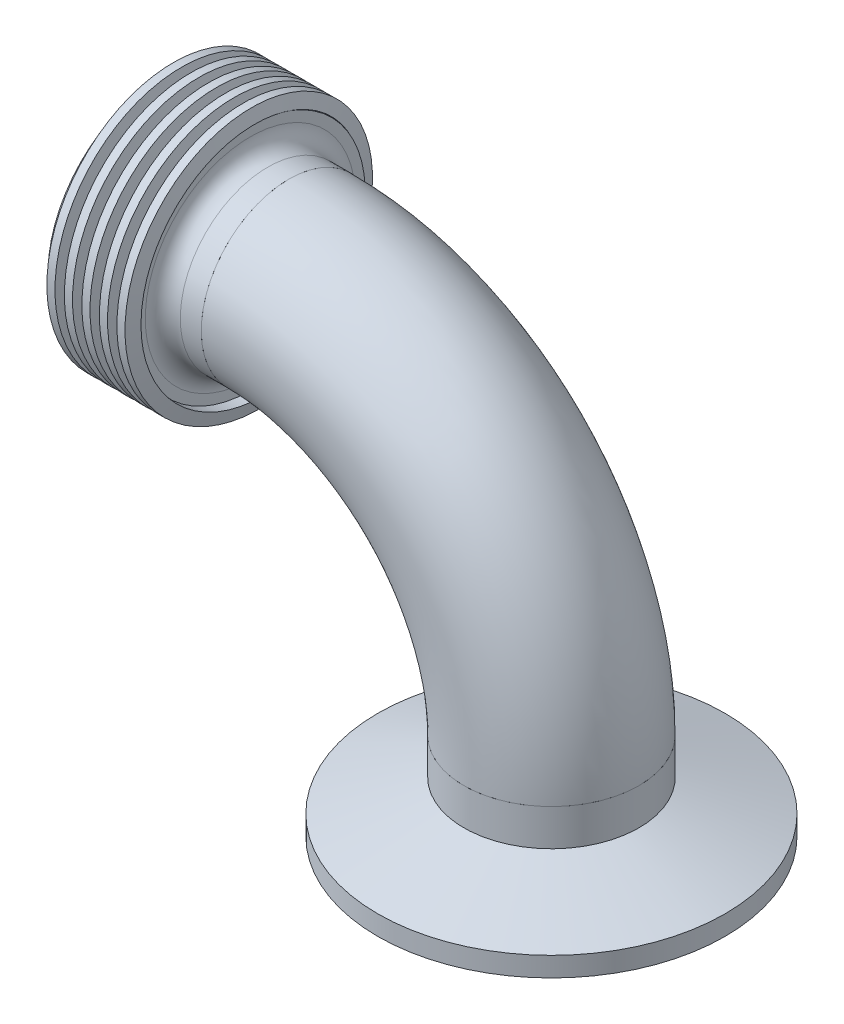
ISO-10303-21;
HEADER;
FILE_DESCRIPTION(('STEP AP214'),'2;1');
FILE_NAME('part.step','',(''),(''),'','','');
FILE_SCHEMA(('AUTOMOTIVE_DESIGN { 1 0 10303 214 1 1 1 1 }'));
ENDSEC;
DATA;
#1=APPLICATION_CONTEXT('core data for automotive mechanical design processes');
#2=APPLICATION_PROTOCOL_DEFINITION('international standard','automotive_design',2000,#1);
#3=PRODUCT_CONTEXT('',#1,'mechanical');
#4=PRODUCT('Part','Part','',(#3));
#5=PRODUCT_RELATED_PRODUCT_CATEGORY('part','',(#4));
#6=PRODUCT_DEFINITION_FORMATION('','',#4);
#7=PRODUCT_DEFINITION_CONTEXT('part definition',#1,'design');
#8=PRODUCT_DEFINITION('design','',#6,#7);
#9=PRODUCT_DEFINITION_SHAPE('','',#8);
#10=(LENGTH_UNIT() NAMED_UNIT(*) SI_UNIT(.MILLI.,.METRE.));
#11=(NAMED_UNIT(*) PLANE_ANGLE_UNIT() SI_UNIT($,.RADIAN.));
#12=(NAMED_UNIT(*) SI_UNIT($,.STERADIAN.) SOLID_ANGLE_UNIT());
#13=UNCERTAINTY_MEASURE_WITH_UNIT(LENGTH_MEASURE(1.E-05),#10,'distance_accuracy_value','');
#14=(GEOMETRIC_REPRESENTATION_CONTEXT(3) GLOBAL_UNCERTAINTY_ASSIGNED_CONTEXT((#13)) GLOBAL_UNIT_ASSIGNED_CONTEXT((#10,
#11,#12)) REPRESENTATION_CONTEXT('',''));
#15=CARTESIAN_POINT('',(0.,0.,0.));
#16=DIRECTION('',(0.,0.,1.));
#17=DIRECTION('',(1.,0.,0.));
#18=AXIS2_PLACEMENT_3D('',#15,#16,#17);
#19=CARTESIAN_POINT('',(12.5032320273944,55.6077093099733,48.5178692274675));
#20=DIRECTION('',(1.,0.,0.));
#21=DIRECTION('',(0.,0.658933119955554,0.752201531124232));
#22=AXIS2_PLACEMENT_3D('',#19,#20,#21);
#23=PLANE('',#22);
#24=CARTESIAN_POINT('',(12.5032320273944,55.6077093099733,48.5178692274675));
#25=DIRECTION('',(-1.,0.,0.));
#26=DIRECTION('',(0.,-0.658933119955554,-0.752201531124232));
#27=AXIS2_PLACEMENT_3D('',#24,#25,#26);
#28=CIRCLE('',#27,12.7);
#29=CARTESIAN_POINT('',(12.5032320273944,47.2392586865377,38.9649097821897));
#30=VERTEX_POINT('',#29);
#31=EDGE_CURVE('P0_E26',#30,#30,#28,.T.);
#32=ORIENTED_EDGE('',*,*,#31,.F.);
#33=EDGE_LOOP('',(#32));
#34=FACE_BOUND('',#33,.T.);
#35=CARTESIAN_POINT('',(12.5032320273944,55.6077093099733,48.5178692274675));
#36=DIRECTION('',(-1.,0.,0.));
#37=DIRECTION('',(0.,0.752201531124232,-0.658933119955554));
#38=AXIS2_PLACEMENT_3D('',#35,#36,#37);
#39=CIRCLE('',#38,11.049);
#40=CARTESIAN_POINT('',(12.5032320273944,63.9187840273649,41.2373171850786));
#41=VERTEX_POINT('',#40);
#42=EDGE_CURVE('P0_E42',#41,#41,#39,.T.);
#43=ORIENTED_EDGE('',*,*,#42,.T.);
#44=EDGE_LOOP('',(#43));
#45=FACE_BOUND('',#44,.T.);
#46=ADVANCED_FACE('P0_F15',(#34,#45),#23,.T.);
#47=CARTESIAN_POINT('',(-5.78476797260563,43.4148767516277,34.5992073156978));
#48=DIRECTION('',(-1.,0.,0.));
#49=DIRECTION('',(0.,-0.658933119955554,-0.752201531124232));
#50=AXIS2_PLACEMENT_3D('',#47,#48,#49);
#51=PLANE('',#50);
#52=CARTESIAN_POINT('',(-5.78476797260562,55.6077093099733,48.5178692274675));
#53=DIRECTION('',(-1.,0.,0.));
#54=DIRECTION('',(0.,-0.658933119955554,-0.752201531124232));
#55=AXIS2_PLACEMENT_3D('',#52,#53,#54);
#56=CIRCLE('',#55,15.0495);
#57=CARTESIAN_POINT('',(-5.78476797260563,45.6910953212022,37.1976122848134));
#58=VERTEX_POINT('',#57);
#59=EDGE_CURVE('P0_E22',#58,#58,#56,.F.);
#60=ORIENTED_EDGE('',*,*,#59,.T.);
#61=EDGE_LOOP('',(#60));
#62=FACE_BOUND('',#61,.T.);
#63=CARTESIAN_POINT('',(-5.78476797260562,55.6077093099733,48.5178692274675));
#64=DIRECTION('',(-1.,0.,0.));
#65=DIRECTION('',(0.,-0.658933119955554,-0.752201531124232));
#66=AXIS2_PLACEMENT_3D('',#63,#64,#65);
#67=CIRCLE('',#66,16.6624);
#68=CARTESIAN_POINT('',(-5.78476797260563,44.6283020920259,35.9843864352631));
#69=VERTEX_POINT('',#68);
#70=EDGE_CURVE('P0_E39',#69,#69,#67,.T.);
#71=ORIENTED_EDGE('',*,*,#70,.T.);
#72=EDGE_LOOP('',(#71));
#73=FACE_BOUND('',#72,.T.);
#74=ADVANCED_FACE('P0_F63',(#62,#73),#51,.T.);
#75=CARTESIAN_POINT('',(6.91523202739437,45.5655685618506,37.0543178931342));
#76=DIRECTION('',(1.,0.,0.));
#77=DIRECTION('',(0.,0.658933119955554,0.752201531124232));
#78=AXIS2_PLACEMENT_3D('',#75,#76,#77);
#79=PLANE('',#78);
#80=CARTESIAN_POINT('',(6.91523202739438,55.6077093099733,48.5178692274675));
#81=DIRECTION('',(-1.,0.,0.));
#82=DIRECTION('',(0.,-0.658933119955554,-0.752201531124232));
#83=AXIS2_PLACEMENT_3D('',#80,#81,#82);
#84=CIRCLE('',#83,15.24);
#85=CARTESIAN_POINT('',(6.91523202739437,45.5655685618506,37.0543178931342));
#86=VERTEX_POINT('',#85);
#87=EDGE_CURVE('P0_E35',#86,#86,#84,.T.);
#88=ORIENTED_EDGE('',*,*,#87,.T.);
#89=EDGE_LOOP('',(#88));
#90=FACE_BOUND('',#89,.T.);
#91=CARTESIAN_POINT('',(6.91523202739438,55.6077093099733,48.5178692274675));
#92=DIRECTION('',(-1.,0.,0.));
#93=DIRECTION('',(0.,-0.658933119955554,-0.752201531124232));
#94=AXIS2_PLACEMENT_3D('',#91,#92,#93);
#95=CIRCLE('',#94,16.6624);
#96=CARTESIAN_POINT('',(6.91523202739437,44.6283020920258,35.9843864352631));
#97=VERTEX_POINT('',#96);
#98=EDGE_CURVE('P0_E38',#97,#97,#95,.T.);
#99=ORIENTED_EDGE('',*,*,#98,.F.);
#100=EDGE_LOOP('',(#99));
#101=FACE_BOUND('',#100,.T.);
#102=ADVANCED_FACE('P0_F68',(#90,#101),#79,.T.);
#103=CARTESIAN_POINT('',(-5.78476797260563,55.6077093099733,48.5178692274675));
#104=DIRECTION('',(-1.,0.,0.));
#105=DIRECTION('',(0.,-0.658933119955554,-0.752201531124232));
#106=AXIS2_PLACEMENT_3D('',#103,#104,#105);
#107=CYLINDRICAL_SURFACE('',#106,12.7);
#108=ORIENTED_EDGE('',*,*,#31,.T.);
#109=EDGE_LOOP('',(#108));
#110=FACE_BOUND('',#109,.T.);
#111=CARTESIAN_POINT('',(9.45523202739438,55.6077093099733,48.5178692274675));
#112=DIRECTION('',(-1.,0.,0.));
#113=DIRECTION('',(0.,-0.658933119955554,-0.752201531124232));
#114=AXIS2_PLACEMENT_3D('',#111,#112,#113);
#115=CIRCLE('',#114,12.7);
#116=CARTESIAN_POINT('',(9.45523202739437,47.2392586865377,38.9649097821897));
#117=VERTEX_POINT('',#116);
#118=EDGE_CURVE('P0_E30',#117,#117,#115,.T.);
#119=ORIENTED_EDGE('',*,*,#118,.F.);
#120=EDGE_LOOP('',(#119));
#121=FACE_BOUND('',#120,.T.);
#122=ADVANCED_FACE('P0_F72',(#110,#121),#107,.T.);
#123=CARTESIAN_POINT('',(9.45523202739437,55.6077093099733,48.5178692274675));
#124=DIRECTION('',(-1.,0.,0.));
#125=DIRECTION('',(0.,-0.658933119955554,-0.752201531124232));
#126=AXIS2_PLACEMENT_3D('',#123,#124,#125);
#127=TOROIDAL_SURFACE('',#126,15.24,2.54);
#128=ORIENTED_EDGE('',*,*,#118,.T.);
#129=EDGE_LOOP('',(#128));
#130=FACE_BOUND('',#129,.T.);
#131=ORIENTED_EDGE('',*,*,#87,.F.);
#132=EDGE_LOOP('',(#131));
#133=FACE_BOUND('',#132,.T.);
#134=ADVANCED_FACE('P0_F59',(#130,#133),#127,.F.);
#135=CARTESIAN_POINT('',(6.91523202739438,55.6077093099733,48.5178692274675));
#136=DIRECTION('',(-1.,0.,0.));
#137=DIRECTION('',(0.,-0.658933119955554,-0.752201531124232));
#138=AXIS2_PLACEMENT_3D('',#135,#136,#137);
#139=CYLINDRICAL_SURFACE('',#138,16.6624);
#140=ORIENTED_EDGE('',*,*,#98,.T.);
#141=EDGE_LOOP('',(#140));
#142=FACE_BOUND('',#141,.T.);
#143=ORIENTED_EDGE('',*,*,#70,.F.);
#144=EDGE_LOOP('',(#143));
#145=FACE_BOUND('',#144,.T.);
#146=ADVANCED_FACE('P0_F51',(#142,#145),#139,.T.);
#147=CARTESIAN_POINT('',(-6.05082256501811,55.6077093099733,48.5178692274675));
#148=DIRECTION('',(1.,0.,0.));
#149=DIRECTION('',(0.,-0.752201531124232,0.658933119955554));
#150=AXIS2_PLACEMENT_3D('',#147,#148,#149);
#151=CYLINDRICAL_SURFACE('',#150,11.049);
#152=CARTESIAN_POINT('',(-1.78426797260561,55.6077093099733,48.5178692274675));
#153=DIRECTION('',(-1.,0.,0.));
#154=DIRECTION('',(0.,0.752201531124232,-0.658933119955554));
#155=AXIS2_PLACEMENT_3D('',#152,#153,#154);
#156=CIRCLE('',#155,11.049);
#157=CARTESIAN_POINT('',(-1.78426797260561,63.9187840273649,41.2373171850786));
#158=VERTEX_POINT('',#157);
#159=EDGE_CURVE('P0_E10',#158,#158,#156,.T.);
#160=ORIENTED_EDGE('',*,*,#159,.T.);
#161=EDGE_LOOP('',(#160));
#162=FACE_BOUND('',#161,.T.);
#163=ORIENTED_EDGE('',*,*,#42,.F.);
#164=EDGE_LOOP('',(#163));
#165=FACE_BOUND('',#164,.T.);
#166=ADVANCED_FACE('P0_F49',(#162,#165),#151,.F.);
#167=CARTESIAN_POINT('',(-5.78476797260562,55.6077093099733,48.5178692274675));
#168=DIRECTION('',(-1.,0.,0.));
#169=DIRECTION('',(0.,0.752201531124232,-0.658933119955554));
#170=AXIS2_PLACEMENT_3D('',#167,#168,#169);
#171=CONICAL_SURFACE('',#170,15.0495,0.785398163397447);
#172=ORIENTED_EDGE('',*,*,#159,.F.);
#173=EDGE_LOOP('',(#172));
#174=FACE_BOUND('',#173,.T.);
#175=ORIENTED_EDGE('',*,*,#59,.F.);
#176=EDGE_LOOP('',(#175));
#177=FACE_BOUND('',#176,.T.);
#178=ADVANCED_FACE('P0_F17',(#174,#177),#171,.F.);
#179=CLOSED_SHELL('',(#46,#74,#102,#122,#134,#146,#166,#178));
#180=MANIFOLD_SOLID_BREP('P0_B1',#179);
#181=CARTESIAN_POINT('',(-5.81270042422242,43.9707490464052,35.2336727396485));
#182=DIRECTION('',(0.,-0.752203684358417,0.658930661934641));
#183=DIRECTION('',(0.,0.65893066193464,0.752203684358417));
#184=AXIS2_PLACEMENT_3D('',#181,#182,#183);
#185=PLANE('',#184);
#186=DIRECTION('',(-1.,0.,0.));
#187=VECTOR('',#186,1.);
#188=CARTESIAN_POINT('',(-4.98656828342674,44.5774594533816,35.9262642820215));
#189=LINE('',#188,#187);
#190=CARTESIAN_POINT('',(-3.92231400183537,44.5774594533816,35.9262642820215));
#191=VERTEX_POINT('',#190);
#192=CARTESIAN_POINT('',(-5.78476797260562,44.5774594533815,35.9262642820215));
#193=VERTEX_POINT('',#192);
#194=EDGE_CURVE('P1_E81',#191,#193,#189,.T.);
#195=ORIENTED_EDGE('',*,*,#194,.T.);
#196=DIRECTION('',(0.,-0.65893066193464,-0.752203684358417));
#197=VECTOR('',#196,1.);
#198=CARTESIAN_POINT('',(-5.78476797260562,43.9707490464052,35.2336727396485));
#199=LINE('',#198,#197);
#200=CARTESIAN_POINT('',(-5.78476797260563,43.8995800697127,35.1524296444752));
#201=VERTEX_POINT('',#200);
#202=EDGE_CURVE('P1_E36',#193,#201,#199,.T.);
#203=ORIENTED_EDGE('',*,*,#202,.T.);
#204=DIRECTION('',(0.250380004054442,-0.637942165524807,-0.72824422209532));
#205=VECTOR('',#204,1.);
#206=CARTESIAN_POINT('',(-5.81270042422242,43.9707490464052,35.2336727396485));
#207=LINE('',#206,#205);
#208=CARTESIAN_POINT('',(-5.57457828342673,43.3640386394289,34.5410811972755));
#209=VERTEX_POINT('',#208);
#210=EDGE_CURVE('P1_E75',#201,#209,#207,.T.);
#211=ORIENTED_EDGE('',*,*,#210,.T.);
#212=DIRECTION('',(1.,0.,0.));
#213=VECTOR('',#212,1.);
#214=CARTESIAN_POINT('',(-4.98656828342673,43.3640386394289,34.5410811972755));
#215=LINE('',#214,#213);
#216=CARTESIAN_POINT('',(-4.39855828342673,43.3640386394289,34.5410811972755));
#217=VERTEX_POINT('',#216);
#218=EDGE_CURVE('P1_E107',#209,#217,#215,.T.);
#219=ORIENTED_EDGE('',*,*,#218,.T.);
#220=DIRECTION('',(0.250380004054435,0.637942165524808,0.728244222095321));
#221=VECTOR('',#220,1.);
#222=CARTESIAN_POINT('',(-4.16043614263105,43.9707490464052,35.2336727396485));
#223=LINE('',#222,#221);
#224=EDGE_CURVE('P1_E102',#217,#191,#223,.T.);
#225=ORIENTED_EDGE('',*,*,#224,.T.);
#226=EDGE_LOOP('',(#195,#203,#211,#219,#225));
#227=FACE_BOUND('',#226,.T.);
#228=ADVANCED_FACE('P1_F17',(#227),#185,.T.);
#229=CARTESIAN_POINT('',(-6.05082256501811,44.5774594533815,35.9262642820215));
#230=CARTESIAN_POINT('',(-5.92382256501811,48.6687199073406,32.3423188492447));
#231=CARTESIAN_POINT('',(-5.7968225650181,54.0852094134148,31.8476286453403));
#232=CARTESIAN_POINT('',(-5.6698225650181,59.5016989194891,31.3529384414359));
#233=CARTESIAN_POINT('',(-5.5428225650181,64.1745025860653,34.1364583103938));
#234=CARTESIAN_POINT('',(-5.4158225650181,68.8473062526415,36.9199781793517));
#235=CARTESIAN_POINT('',(-5.2888225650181,70.9915719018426,41.9184981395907));
#236=CARTESIAN_POINT('',(-5.1618225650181,73.1358375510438,46.9170180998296));
#237=CARTESIAN_POINT('',(-5.0348225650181,71.9325285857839,52.2212734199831));
#238=CARTESIAN_POINT('',(-4.90782256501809,70.7292196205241,57.5255287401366));
#239=CARTESIAN_POINT('',(-4.7808225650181,66.637959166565,61.1094741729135));
#240=CARTESIAN_POINT('',(-4.6538225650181,62.546698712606,64.6934196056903));
#241=CARTESIAN_POINT('',(-4.52682256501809,57.1302092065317,65.1881098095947));
#242=CARTESIAN_POINT('',(-4.3998225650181,51.7137197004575,65.6828000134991));
#243=CARTESIAN_POINT('',(-4.27282256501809,47.0409160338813,62.8992801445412));
#244=CARTESIAN_POINT('',(-4.1458225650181,42.3681123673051,60.1157602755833));
#245=CARTESIAN_POINT('',(-4.0188225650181,40.2238467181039,55.1172403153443));
#246=CARTESIAN_POINT('',(-3.8918225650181,38.0795810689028,50.1187203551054));
#247=CARTESIAN_POINT('',(-3.7648225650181,39.2828900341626,44.8144650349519));
#248=CARTESIAN_POINT('',(-3.63782256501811,40.4861989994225,39.5102097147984));
#249=CARTESIAN_POINT('',(-3.51082256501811,44.5774594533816,35.9262642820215));
#250=CARTESIAN_POINT('',(-3.38382256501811,48.6687199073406,32.3423188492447));
#251=CARTESIAN_POINT('',(-3.2568225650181,54.0852094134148,31.8476286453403));
#252=CARTESIAN_POINT('',(-3.12982256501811,59.5016989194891,31.3529384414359));
#253=CARTESIAN_POINT('',(-3.0028225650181,64.1745025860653,34.1364583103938));
#254=CARTESIAN_POINT('',(-2.8758225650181,68.8473062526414,36.9199781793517));
#255=CARTESIAN_POINT('',(-2.7488225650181,70.9915719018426,41.9184981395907));
#256=CARTESIAN_POINT('',(-2.6218225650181,73.1358375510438,46.9170180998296));
#257=CARTESIAN_POINT('',(-2.49482256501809,71.9325285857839,52.2212734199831));
#258=CARTESIAN_POINT('',(-2.3678225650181,70.7292196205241,57.5255287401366));
#259=CARTESIAN_POINT('',(-2.24082256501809,66.637959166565,61.1094741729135));
#260=CARTESIAN_POINT('',(-2.11382256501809,62.546698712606,64.6934196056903));
#261=CARTESIAN_POINT('',(-1.9868225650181,57.1302092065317,65.1881098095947));
#262=CARTESIAN_POINT('',(-1.85982256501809,51.7137197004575,65.6828000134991));
#263=CARTESIAN_POINT('',(-1.7328225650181,47.0409160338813,62.8992801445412));
#264=CARTESIAN_POINT('',(-1.6058225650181,42.3681123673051,60.1157602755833));
#265=CARTESIAN_POINT('',(-1.47882256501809,40.2238467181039,55.1172403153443));
#266=CARTESIAN_POINT('',(-1.3518225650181,38.0795810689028,50.1187203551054));
#267=CARTESIAN_POINT('',(-1.2248225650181,39.2828900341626,44.8144650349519));
#268=CARTESIAN_POINT('',(-1.0978225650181,40.4861989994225,39.5102097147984));
#269=CARTESIAN_POINT('',(-0.970822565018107,44.5774594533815,35.9262642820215));
#270=CARTESIAN_POINT('',(-0.843822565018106,48.6687199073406,32.3423188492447));
#271=CARTESIAN_POINT('',(-0.716822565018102,54.0852094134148,31.8476286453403));
#272=CARTESIAN_POINT('',(-0.589822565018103,59.5016989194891,31.3529384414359));
#273=CARTESIAN_POINT('',(-0.462822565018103,64.1745025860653,34.1364583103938));
#274=CARTESIAN_POINT('',(-0.335822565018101,68.8473062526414,36.9199781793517));
#275=CARTESIAN_POINT('',(-0.208822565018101,70.9915719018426,41.9184981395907));
#276=CARTESIAN_POINT('',(-0.0818225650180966,73.1358375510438,46.9170180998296));
#277=CARTESIAN_POINT('',(0.0451774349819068,71.9325285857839,52.2212734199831));
#278=CARTESIAN_POINT('',(0.172177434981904,70.7292196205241,57.5255287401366));
#279=CARTESIAN_POINT('',(0.299177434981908,66.637959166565,61.1094741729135));
#280=CARTESIAN_POINT('',(0.426177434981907,62.546698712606,64.6934196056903));
#281=CARTESIAN_POINT('',(0.553177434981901,57.1302092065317,65.1881098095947));
#282=CARTESIAN_POINT('',(0.680177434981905,51.7137197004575,65.6828000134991));
#283=CARTESIAN_POINT('',(0.8071774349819,47.0409160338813,62.8992801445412));
#284=CARTESIAN_POINT('',(0.934177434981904,42.3681123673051,60.1157602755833));
#285=CARTESIAN_POINT('',(1.06117743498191,40.2238467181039,55.1172403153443));
#286=CARTESIAN_POINT('',(1.1881774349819,38.0795810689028,50.1187203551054));
#287=CARTESIAN_POINT('',(1.3151774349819,39.2828900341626,44.8144650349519));
#288=CARTESIAN_POINT('',(1.44217743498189,40.4861989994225,39.5102097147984));
#289=CARTESIAN_POINT('',(1.56917743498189,44.5774594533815,35.9262642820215));
#290=CARTESIAN_POINT('',(1.6961774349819,48.6687199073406,32.3423188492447));
#291=CARTESIAN_POINT('',(1.82317743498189,54.0852094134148,31.8476286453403));
#292=CARTESIAN_POINT('',(1.9501774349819,59.5016989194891,31.3529384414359));
#293=CARTESIAN_POINT('',(2.0771774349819,64.1745025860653,34.1364583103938));
#294=CARTESIAN_POINT('',(2.2041774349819,68.8473062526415,36.9199781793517));
#295=CARTESIAN_POINT('',(2.3311774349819,70.9915719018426,41.9184981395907));
#296=CARTESIAN_POINT('',(2.4581774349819,73.1358375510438,46.9170180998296));
#297=CARTESIAN_POINT('',(2.5851774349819,71.9325285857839,52.2212734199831));
#298=CARTESIAN_POINT('',(2.71217743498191,70.7292196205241,57.5255287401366));
#299=CARTESIAN_POINT('',(2.83917743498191,66.637959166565,61.1094741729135));
#300=CARTESIAN_POINT('',(2.96617743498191,62.546698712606,64.6934196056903));
#301=CARTESIAN_POINT('',(3.0931774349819,57.1302092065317,65.1881098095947));
#302=CARTESIAN_POINT('',(3.2201774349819,51.7137197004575,65.6828000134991));
#303=CARTESIAN_POINT('',(3.3471774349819,47.0409160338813,62.8992801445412));
#304=CARTESIAN_POINT('',(3.4741774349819,42.3681123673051,60.1157602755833));
#305=CARTESIAN_POINT('',(3.6011774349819,40.2238467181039,55.1172403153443));
#306=CARTESIAN_POINT('',(3.72817743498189,38.0795810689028,50.1187203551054));
#307=CARTESIAN_POINT('',(3.8551774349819,39.2828900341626,44.8144650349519));
#308=CARTESIAN_POINT('',(3.9821774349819,40.4861989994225,39.5102097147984));
#309=CARTESIAN_POINT('',(4.1091774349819,44.5774594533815,35.9262642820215));
#310=CARTESIAN_POINT('',(4.2361774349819,48.6687199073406,32.3423188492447));
#311=CARTESIAN_POINT('',(4.36317743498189,54.0852094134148,31.8476286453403));
#312=CARTESIAN_POINT('',(4.4901774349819,59.5016989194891,31.3529384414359));
#313=CARTESIAN_POINT('',(4.6171774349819,64.1745025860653,34.1364583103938));
#314=CARTESIAN_POINT('',(4.7441774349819,68.8473062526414,36.9199781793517));
#315=CARTESIAN_POINT('',(4.8711774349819,70.9915719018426,41.9184981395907));
#316=CARTESIAN_POINT('',(4.9981774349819,73.1358375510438,46.9170180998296));
#317=CARTESIAN_POINT('',(5.12517743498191,71.9325285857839,52.2212734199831));
#318=CARTESIAN_POINT('',(5.25217743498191,70.7292196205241,57.5255287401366));
#319=CARTESIAN_POINT('',(5.37917743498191,66.637959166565,61.1094741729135));
#320=CARTESIAN_POINT('',(5.50617743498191,62.546698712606,64.6934196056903));
#321=CARTESIAN_POINT('',(5.63317743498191,57.1302092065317,65.1881098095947));
#322=CARTESIAN_POINT('',(5.76017743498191,51.7137197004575,65.6828000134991));
#323=CARTESIAN_POINT('',(5.8871774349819,47.0409160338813,62.8992801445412));
#324=CARTESIAN_POINT('',(6.0141774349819,42.3681123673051,60.1157602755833));
#325=CARTESIAN_POINT('',(6.1411774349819,40.2238467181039,55.1172403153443));
#326=CARTESIAN_POINT('',(6.2681774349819,38.0795810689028,50.1187203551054));
#327=CARTESIAN_POINT('',(6.3951774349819,39.2828900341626,44.8144650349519));
#328=CARTESIAN_POINT('',(6.5221774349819,40.4861989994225,39.5102097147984));
#329=CARTESIAN_POINT('',(6.64917743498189,44.5774594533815,35.9262642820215));
#330=CARTESIAN_POINT('',(-5.57457828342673,43.3640386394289,34.5410811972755));
#331=CARTESIAN_POINT('',(-5.44757828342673,47.9053723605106,30.5628714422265));
#332=CARTESIAN_POINT('',(-5.32057828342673,53.9177215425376,30.0137611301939));
#333=CARTESIAN_POINT('',(-5.19357828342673,59.9300707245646,29.4646508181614));
#334=CARTESIAN_POINT('',(-5.06657828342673,65.1169223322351,32.5543814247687));
#335=CARTESIAN_POINT('',(-4.93957828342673,70.3037739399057,35.6441120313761));
#336=CARTESIAN_POINT('',(-4.81257828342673,72.6839269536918,41.1925114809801));
#337=CARTESIAN_POINT('',(-4.68557828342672,75.0640799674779,46.7409109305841));
#338=CARTESIAN_POINT('',(-4.55857828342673,73.7283968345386,52.6286792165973));
#339=CARTESIAN_POINT('',(-4.43157828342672,72.3927137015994,58.5164475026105));
#340=CARTESIAN_POINT('',(-4.30457828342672,67.8513799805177,62.4946572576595));
#341=CARTESIAN_POINT('',(-4.17757828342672,63.310046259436,66.4728670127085));
#342=CARTESIAN_POINT('',(-4.05057828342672,57.297697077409,67.021977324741));
#343=CARTESIAN_POINT('',(-3.92357828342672,51.285347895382,67.5710876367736));
#344=CARTESIAN_POINT('',(-3.79657828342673,46.0984962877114,64.4813570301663));
#345=CARTESIAN_POINT('',(-3.66957828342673,40.9116446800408,61.3916264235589));
#346=CARTESIAN_POINT('',(-3.54257828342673,38.5314916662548,55.8432269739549));
#347=CARTESIAN_POINT('',(-3.41557828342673,36.1513386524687,50.2948275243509));
#348=CARTESIAN_POINT('',(-3.28857828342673,37.4870217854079,44.4070592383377));
#349=CARTESIAN_POINT('',(-3.16157828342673,38.8227049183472,38.5192909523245));
#350=CARTESIAN_POINT('',(-3.03457828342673,43.3640386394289,34.5410811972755));
#351=CARTESIAN_POINT('',(-2.90757828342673,47.9053723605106,30.5628714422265));
#352=CARTESIAN_POINT('',(-2.78057828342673,53.9177215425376,30.0137611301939));
#353=CARTESIAN_POINT('',(-2.65357828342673,59.9300707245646,29.4646508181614));
#354=CARTESIAN_POINT('',(-2.52657828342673,65.1169223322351,32.5543814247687));
#355=CARTESIAN_POINT('',(-2.39957828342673,70.3037739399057,35.6441120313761));
#356=CARTESIAN_POINT('',(-2.27257828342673,72.6839269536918,41.1925114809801));
#357=CARTESIAN_POINT('',(-2.14557828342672,75.0640799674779,46.7409109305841));
#358=CARTESIAN_POINT('',(-2.01857828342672,73.7283968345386,52.6286792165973));
#359=CARTESIAN_POINT('',(-1.89157828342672,72.3927137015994,58.5164475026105));
#360=CARTESIAN_POINT('',(-1.76457828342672,67.8513799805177,62.4946572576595));
#361=CARTESIAN_POINT('',(-1.63757828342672,63.310046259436,66.4728670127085));
#362=CARTESIAN_POINT('',(-1.51057828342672,57.297697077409,67.021977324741));
#363=CARTESIAN_POINT('',(-1.38357828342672,51.285347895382,67.5710876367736));
#364=CARTESIAN_POINT('',(-1.25657828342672,46.0984962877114,64.4813570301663));
#365=CARTESIAN_POINT('',(-1.12957828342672,40.9116446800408,61.3916264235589));
#366=CARTESIAN_POINT('',(-1.00257828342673,38.5314916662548,55.8432269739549));
#367=CARTESIAN_POINT('',(-0.875578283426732,36.1513386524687,50.2948275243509));
#368=CARTESIAN_POINT('',(-0.748578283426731,37.4870217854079,44.4070592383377));
#369=CARTESIAN_POINT('',(-0.621578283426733,38.8227049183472,38.5192909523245));
#370=CARTESIAN_POINT('',(-0.494578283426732,43.3640386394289,34.5410811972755));
#371=CARTESIAN_POINT('',(-0.36757828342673,47.9053723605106,30.5628714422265));
#372=CARTESIAN_POINT('',(-0.24057828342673,53.9177215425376,30.0137611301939));
#373=CARTESIAN_POINT('',(-0.113578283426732,59.9300707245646,29.4646508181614));
#374=CARTESIAN_POINT('',(0.0134217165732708,65.1169223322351,32.5543814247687));
#375=CARTESIAN_POINT('',(0.140421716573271,70.3037739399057,35.6441120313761));
#376=CARTESIAN_POINT('',(0.26742171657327,72.6839269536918,41.1925114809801));
#377=CARTESIAN_POINT('',(0.394421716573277,75.0640799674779,46.7409109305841));
#378=CARTESIAN_POINT('',(0.521421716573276,73.7283968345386,52.6286792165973));
#379=CARTESIAN_POINT('',(0.648421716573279,72.3927137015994,58.5164475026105));
#380=CARTESIAN_POINT('',(0.775421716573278,67.8513799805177,62.4946572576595));
#381=CARTESIAN_POINT('',(0.902421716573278,63.310046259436,66.4728670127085));
#382=CARTESIAN_POINT('',(1.02942171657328,57.297697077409,67.021977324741));
#383=CARTESIAN_POINT('',(1.15642171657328,51.285347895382,67.5710876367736));
#384=CARTESIAN_POINT('',(1.28342171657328,46.0984962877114,64.4813570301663));
#385=CARTESIAN_POINT('',(1.41042171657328,40.9116446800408,61.3916264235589));
#386=CARTESIAN_POINT('',(1.53742171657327,38.5314916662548,55.8432269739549));
#387=CARTESIAN_POINT('',(1.66442171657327,36.1513386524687,50.2948275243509));
#388=CARTESIAN_POINT('',(1.79142171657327,37.4870217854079,44.4070592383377));
#389=CARTESIAN_POINT('',(1.91842171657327,38.8227049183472,38.5192909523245));
#390=CARTESIAN_POINT('',(2.04542171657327,43.3640386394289,34.5410811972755));
#391=CARTESIAN_POINT('',(2.17242171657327,47.9053723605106,30.5628714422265));
#392=CARTESIAN_POINT('',(2.29942171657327,53.9177215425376,30.0137611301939));
#393=CARTESIAN_POINT('',(2.42642171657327,59.9300707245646,29.4646508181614));
#394=CARTESIAN_POINT('',(2.55342171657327,65.1169223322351,32.5543814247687));
#395=CARTESIAN_POINT('',(2.68042171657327,70.3037739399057,35.6441120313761));
#396=CARTESIAN_POINT('',(2.80742171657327,72.6839269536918,41.1925114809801));
#397=CARTESIAN_POINT('',(2.93442171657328,75.0640799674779,46.7409109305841));
#398=CARTESIAN_POINT('',(3.06142171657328,73.7283968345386,52.6286792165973));
#399=CARTESIAN_POINT('',(3.18842171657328,72.3927137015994,58.5164475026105));
#400=CARTESIAN_POINT('',(3.31542171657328,67.8513799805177,62.4946572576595));
#401=CARTESIAN_POINT('',(3.44242171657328,63.310046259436,66.4728670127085));
#402=CARTESIAN_POINT('',(3.56942171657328,57.297697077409,67.021977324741));
#403=CARTESIAN_POINT('',(3.69642171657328,51.285347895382,67.5710876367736));
#404=CARTESIAN_POINT('',(3.82342171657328,46.0984962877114,64.4813570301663));
#405=CARTESIAN_POINT('',(3.95042171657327,40.9116446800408,61.3916264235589));
#406=CARTESIAN_POINT('',(4.07742171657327,38.5314916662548,55.8432269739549));
#407=CARTESIAN_POINT('',(4.20442171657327,36.1513386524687,50.2948275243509));
#408=CARTESIAN_POINT('',(4.33142171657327,37.4870217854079,44.4070592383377));
#409=CARTESIAN_POINT('',(4.45842171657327,38.8227049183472,38.5192909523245));
#410=CARTESIAN_POINT('',(4.58542171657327,43.3640386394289,34.5410811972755));
#411=CARTESIAN_POINT('',(4.71242171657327,47.9053723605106,30.5628714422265));
#412=CARTESIAN_POINT('',(4.83942171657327,53.9177215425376,30.0137611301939));
#413=CARTESIAN_POINT('',(4.96642171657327,59.9300707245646,29.4646508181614));
#414=CARTESIAN_POINT('',(5.09342171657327,65.1169223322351,32.5543814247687));
#415=CARTESIAN_POINT('',(5.22042171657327,70.3037739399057,35.6441120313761));
#416=CARTESIAN_POINT('',(5.34742171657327,72.6839269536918,41.1925114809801));
#417=CARTESIAN_POINT('',(5.47442171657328,75.0640799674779,46.7409109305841));
#418=CARTESIAN_POINT('',(5.60142171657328,73.7283968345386,52.6286792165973));
#419=CARTESIAN_POINT('',(5.72842171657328,72.3927137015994,58.5164475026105));
#420=CARTESIAN_POINT('',(5.85542171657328,67.8513799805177,62.4946572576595));
#421=CARTESIAN_POINT('',(5.98242171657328,63.310046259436,66.4728670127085));
#422=CARTESIAN_POINT('',(6.10942171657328,57.297697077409,67.021977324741));
#423=CARTESIAN_POINT('',(6.23642171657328,51.285347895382,67.5710876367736));
#424=CARTESIAN_POINT('',(6.36342171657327,46.0984962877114,64.4813570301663));
#425=CARTESIAN_POINT('',(6.49042171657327,40.9116446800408,61.3916264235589));
#426=CARTESIAN_POINT('',(6.61742171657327,38.5314916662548,55.8432269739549));
#427=CARTESIAN_POINT('',(6.74442171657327,36.1513386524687,50.2948275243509));
#428=CARTESIAN_POINT('',(6.87142171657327,37.4870217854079,44.4070592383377));
#429=CARTESIAN_POINT('',(6.99842171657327,38.8227049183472,38.5192909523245));
#430=CARTESIAN_POINT('',(7.12542171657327,43.3640386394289,34.5410811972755));
#431=(BOUNDED_SURFACE() B_SPLINE_SURFACE(1,2,((#229,#230,#231,#232,#233,#234,#235,#236,#237,
#238,#239,#240,#241,#242,#243,#244,#245,#246,#247,#248,#249,#250,#251,#252,#253,#254,#255,#256,
#257,#258,#259,#260,#261,#262,#263,#264,#265,#266,#267,#268,#269,#270,#271,#272,#273,#274,#275,
#276,#277,#278,#279,#280,#281,#282,#283,#284,#285,#286,#287,#288,#289,#290,#291,#292,#293,#294,
#295,#296,#297,#298,#299,#300,#301,#302,#303,#304,#305,#306,#307,#308,#309,#310,#311,#312,#313,
#314,#315,#316,#317,#318,#319,#320,#321,#322,#323,#324,#325,#326,#327,#328,#329),(#330,#331,
#332,#333,#334,#335,#336,#337,#338,#339,#340,#341,#342,#343,#344,#345,#346,#347,#348,#349,#350,
#351,#352,#353,#354,#355,#356,#357,#358,#359,#360,#361,#362,#363,#364,#365,#366,#367,#368,#369,
#370,#371,#372,#373,#374,#375,#376,#377,#378,#379,#380,#381,#382,#383,#384,#385,#386,#387,#388,
#389,#390,#391,#392,#393,#394,#395,#396,#397,#398,#399,#400,#401,#402,#403,#404,#405,#406,#407,
#408,#409,#410,#411,#412,#413,#414,#415,#416,#417,#418,#419,#420,#421,#422,#423,#424,#425,#426,
#427,#428,#429,#430)),.UNSPECIFIED.,.F.,.F.,.F.) B_SPLINE_SURFACE_WITH_KNOTS((2,2),(3,2,2,2,2,2,
2,2,2,2,2,2,2,2,2,2,2,2,2,2,2,2,2,2,2,2,2,2,2,2,2,2,2,2,2,2,2,2,2,2,2,2,2,2,2,2,2,2,2,2,3),(0.,
1.),(0.,0.02,0.04,0.06,0.08,0.1,0.12,0.14,0.16,0.18,0.2,0.22,0.24,0.26,0.28,0.3,0.32,0.34,0.36,
0.38,0.4,0.42,0.44,0.46,0.48,0.5,0.52,0.54,0.56,0.58,0.6,0.62,0.64,0.66,0.68,0.7,0.72,0.74,0.76,
0.78,0.8,0.82,0.84,0.86,0.88,0.9,0.92,0.94,0.96,0.98,1.),
.UNSPECIFIED.) GEOMETRIC_REPRESENTATION_ITEM() RATIONAL_B_SPLINE_SURFACE(((1.,0.951056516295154,
1.,0.951056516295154,1.,0.951056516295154,1.,0.951056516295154,1.,0.951056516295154,1.,
0.951056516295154,1.,0.951056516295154,1.,0.951056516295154,1.,0.951056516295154,1.,
0.951056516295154,1.,0.951056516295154,1.,0.951056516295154,1.,0.951056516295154,1.,
0.951056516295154,1.,0.951056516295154,1.,0.951056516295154,1.,0.951056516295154,1.,
0.951056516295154,1.,0.951056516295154,1.,0.951056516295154,1.,0.951056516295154,1.,
0.951056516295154,1.,0.951056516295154,1.,0.951056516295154,1.,0.951056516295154,1.,
0.951056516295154,1.,0.951056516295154,1.,0.951056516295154,1.,0.951056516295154,1.,
0.951056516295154,1.,0.951056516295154,1.,0.951056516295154,1.,0.951056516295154,1.,
0.951056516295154,1.,0.951056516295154,1.,0.951056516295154,1.,0.951056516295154,1.,
0.951056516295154,1.,0.951056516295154,1.,0.951056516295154,1.,0.951056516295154,1.,
0.951056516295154,1.,0.951056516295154,1.,0.951056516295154,1.,0.951056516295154,1.,
0.951056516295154,1.,0.951056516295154,1.,0.951056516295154,1.,0.951056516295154,1.,
0.951056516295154,1.),(1.,0.951056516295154,1.,0.951056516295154,1.,0.951056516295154,1.,
0.951056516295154,1.,0.951056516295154,1.,0.951056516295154,1.,0.951056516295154,1.,
0.951056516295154,1.,0.951056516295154,1.,0.951056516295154,1.,0.951056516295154,1.,
0.951056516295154,1.,0.951056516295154,1.,0.951056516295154,1.,0.951056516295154,1.,
0.951056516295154,1.,0.951056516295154,1.,0.951056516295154,1.,0.951056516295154,1.,
0.951056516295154,1.,0.951056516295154,1.,0.951056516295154,1.,0.951056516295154,1.,
0.951056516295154,1.,0.951056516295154,1.,0.951056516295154,1.,0.951056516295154,1.,
0.951056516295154,1.,0.951056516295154,1.,0.951056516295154,1.,0.951056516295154,1.,
0.951056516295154,1.,0.951056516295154,1.,0.951056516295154,1.,0.951056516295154,1.,
0.951056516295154,1.,0.951056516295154,1.,0.951056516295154,1.,0.951056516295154,1.,
0.951056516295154,1.,0.951056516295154,1.,0.951056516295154,1.,0.951056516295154,1.,
0.951056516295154,1.,0.951056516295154,1.,0.951056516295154,1.,0.951056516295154,1.,
0.951056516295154,1.,0.951056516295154,1.,0.951056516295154,1.))) REPRESENTATION_ITEM('') SURFACE());
#432=CARTESIAN_POINT('',(-5.78476797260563,54.5974980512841,31.808757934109));
#433=CARTESIAN_POINT('',(-5.78476797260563,54.4300326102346,31.8036000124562));
#434=CARTESIAN_POINT('',(-5.78476797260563,54.2624987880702,31.8011404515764));
#435=CARTESIAN_POINT('',(-5.78476797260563,54.0112128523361,31.8012271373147));
#436=CARTESIAN_POINT('',(-5.78476797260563,53.9274588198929,31.8018852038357));
#437=CARTESIAN_POINT('',(-5.78476797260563,53.7599691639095,31.8044144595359));
#438=CARTESIAN_POINT('',(-5.78476797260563,53.6762335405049,31.8062856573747));
#439=CARTESIAN_POINT('',(-5.78476797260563,53.4251124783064,31.8137342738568));
#440=CARTESIAN_POINT('',(-5.78476797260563,53.2577768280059,31.8211467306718));
#441=CARTESIAN_POINT('',(-5.78476797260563,52.92337729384,31.8408515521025));
#442=CARTESIAN_POINT('',(-5.78476797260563,52.7563134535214,31.8531446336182));
#443=CARTESIAN_POINT('',(-5.78476797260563,52.2549043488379,31.8974123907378));
#444=CARTESIAN_POINT('',(-5.78476797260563,51.9211744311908,31.9367509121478));
#445=CARTESIAN_POINT('',(-5.78476797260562,51.2566086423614,32.0348887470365));
#446=CARTESIAN_POINT('',(-5.78476797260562,50.9257729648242,32.0936893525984));
#447=CARTESIAN_POINT('',(-5.78476797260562,50.1230600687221,32.2607528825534));
#448=CARTESIAN_POINT('',(-5.78476797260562,49.6532999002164,32.3793934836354));
#449=CARTESIAN_POINT('',(-5.78476797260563,48.7253359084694,32.6558949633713));
#450=CARTESIAN_POINT('',(-5.78476797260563,48.2671360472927,32.8137690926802));
#451=CARTESIAN_POINT('',(-5.78476797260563,47.3663106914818,33.1673327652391));
#452=CARTESIAN_POINT('',(-5.78476797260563,46.9236643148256,33.3629691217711));
#453=CARTESIAN_POINT('',(-5.78476797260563,46.0566092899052,33.7907127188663));
#454=CARTESIAN_POINT('',(-5.78476797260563,45.6321904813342,34.0227992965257));
#455=CARTESIAN_POINT('',(-5.78476797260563,44.9917795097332,34.4088428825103));
#456=CARTESIAN_POINT('',(-5.78476797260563,44.7683694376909,34.5506377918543));
#457=CARTESIAN_POINT('',(-5.78476797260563,44.3286475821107,34.8441380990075));
#458=CARTESIAN_POINT('',(-5.78476797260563,44.1123255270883,34.9958281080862));
#459=CARTESIAN_POINT('',(-5.78476797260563,43.8995800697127,35.1524296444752));
#460=B_SPLINE_CURVE_WITH_KNOTS('',3,(#432,#433,#434,#435,#436,#437,#438,#439,#440,#441,#442,
#443,#444,#445,#446,#447,#448,#449,#450,#451,#452,#453,#454,#455,#456,#457,#458,#459),
.UNSPECIFIED.,.F.,.F.,(4,2,2,2,2,2,2,2,2,2,2,2,2,4),(0.,0.502587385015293,0.753848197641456,
1.00511080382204,1.50752799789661,2.01001901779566,3.01749717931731,4.02504224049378,
5.47674830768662,6.92894533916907,8.37911173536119,9.82845900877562,10.6220365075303,
11.4144079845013),.UNSPECIFIED.);
#461=CARTESIAN_POINT('',(-5.78476797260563,54.5974980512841,31.808757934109));
#462=VERTEX_POINT('',#461);
#463=EDGE_CURVE('P1_E68',#462,#201,#460,.T.);
#464=CARTESIAN_POINT('',(-6.05082256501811,44.5774594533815,35.9262642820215));
#465=CARTESIAN_POINT('',(-5.92382256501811,48.6687199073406,32.3423188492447));
#466=CARTESIAN_POINT('',(-5.7968225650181,54.0852094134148,31.8476286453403));
#467=CARTESIAN_POINT('',(-5.6698225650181,59.5016989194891,31.3529384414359));
#468=CARTESIAN_POINT('',(-5.5428225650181,64.1745025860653,34.1364583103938));
#469=CARTESIAN_POINT('',(-5.4158225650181,68.8473062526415,36.9199781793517));
#470=CARTESIAN_POINT('',(-5.2888225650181,70.9915719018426,41.9184981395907));
#471=CARTESIAN_POINT('',(-5.1618225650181,73.1358375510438,46.9170180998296));
#472=CARTESIAN_POINT('',(-5.0348225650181,71.9325285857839,52.2212734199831));
#473=CARTESIAN_POINT('',(-4.90782256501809,70.7292196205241,57.5255287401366));
#474=CARTESIAN_POINT('',(-4.7808225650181,66.637959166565,61.1094741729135));
#475=CARTESIAN_POINT('',(-4.6538225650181,62.546698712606,64.6934196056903));
#476=CARTESIAN_POINT('',(-4.52682256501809,57.1302092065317,65.1881098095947));
#477=CARTESIAN_POINT('',(-4.3998225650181,51.7137197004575,65.6828000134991));
#478=CARTESIAN_POINT('',(-4.27282256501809,47.0409160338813,62.8992801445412));
#479=CARTESIAN_POINT('',(-4.1458225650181,42.3681123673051,60.1157602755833));
#480=CARTESIAN_POINT('',(-4.0188225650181,40.2238467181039,55.1172403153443));
#481=CARTESIAN_POINT('',(-3.8918225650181,38.0795810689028,50.1187203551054));
#482=CARTESIAN_POINT('',(-3.7648225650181,39.2828900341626,44.8144650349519));
#483=CARTESIAN_POINT('',(-3.63782256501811,40.4861989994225,39.5102097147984));
#484=CARTESIAN_POINT('',(-3.51082256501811,44.5774594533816,35.9262642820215));
#485=CARTESIAN_POINT('',(-3.38382256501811,48.6687199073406,32.3423188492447));
#486=CARTESIAN_POINT('',(-3.2568225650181,54.0852094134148,31.8476286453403));
#487=CARTESIAN_POINT('',(-3.12982256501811,59.5016989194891,31.3529384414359));
#488=CARTESIAN_POINT('',(-3.0028225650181,64.1745025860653,34.1364583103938));
#489=CARTESIAN_POINT('',(-2.8758225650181,68.8473062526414,36.9199781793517));
#490=CARTESIAN_POINT('',(-2.7488225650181,70.9915719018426,41.9184981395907));
#491=CARTESIAN_POINT('',(-2.6218225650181,73.1358375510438,46.9170180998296));
#492=CARTESIAN_POINT('',(-2.49482256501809,71.9325285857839,52.2212734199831));
#493=CARTESIAN_POINT('',(-2.3678225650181,70.7292196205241,57.5255287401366));
#494=CARTESIAN_POINT('',(-2.24082256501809,66.637959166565,61.1094741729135));
#495=CARTESIAN_POINT('',(-2.11382256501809,62.546698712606,64.6934196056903));
#496=CARTESIAN_POINT('',(-1.9868225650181,57.1302092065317,65.1881098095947));
#497=CARTESIAN_POINT('',(-1.85982256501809,51.7137197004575,65.6828000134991));
#498=CARTESIAN_POINT('',(-1.7328225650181,47.0409160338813,62.8992801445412));
#499=CARTESIAN_POINT('',(-1.6058225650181,42.3681123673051,60.1157602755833));
#500=CARTESIAN_POINT('',(-1.47882256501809,40.2238467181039,55.1172403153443));
#501=CARTESIAN_POINT('',(-1.3518225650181,38.0795810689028,50.1187203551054));
#502=CARTESIAN_POINT('',(-1.2248225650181,39.2828900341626,44.8144650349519));
#503=CARTESIAN_POINT('',(-1.0978225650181,40.4861989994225,39.5102097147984));
#504=CARTESIAN_POINT('',(-0.970822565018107,44.5774594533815,35.9262642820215));
#505=CARTESIAN_POINT('',(-0.843822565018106,48.6687199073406,32.3423188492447));
#506=CARTESIAN_POINT('',(-0.716822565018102,54.0852094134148,31.8476286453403));
#507=CARTESIAN_POINT('',(-0.589822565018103,59.5016989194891,31.3529384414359));
#508=CARTESIAN_POINT('',(-0.462822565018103,64.1745025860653,34.1364583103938));
#509=CARTESIAN_POINT('',(-0.335822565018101,68.8473062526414,36.9199781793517));
#510=CARTESIAN_POINT('',(-0.208822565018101,70.9915719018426,41.9184981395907));
#511=CARTESIAN_POINT('',(-0.0818225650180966,73.1358375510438,46.9170180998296));
#512=CARTESIAN_POINT('',(0.0451774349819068,71.9325285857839,52.2212734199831));
#513=CARTESIAN_POINT('',(0.172177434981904,70.7292196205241,57.5255287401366));
#514=CARTESIAN_POINT('',(0.299177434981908,66.637959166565,61.1094741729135));
#515=CARTESIAN_POINT('',(0.426177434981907,62.546698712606,64.6934196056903));
#516=CARTESIAN_POINT('',(0.553177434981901,57.1302092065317,65.1881098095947));
#517=CARTESIAN_POINT('',(0.680177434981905,51.7137197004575,65.6828000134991));
#518=CARTESIAN_POINT('',(0.8071774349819,47.0409160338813,62.8992801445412));
#519=CARTESIAN_POINT('',(0.934177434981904,42.3681123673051,60.1157602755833));
#520=CARTESIAN_POINT('',(1.06117743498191,40.2238467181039,55.1172403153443));
#521=CARTESIAN_POINT('',(1.1881774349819,38.0795810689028,50.1187203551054));
#522=CARTESIAN_POINT('',(1.3151774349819,39.2828900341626,44.8144650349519));
#523=CARTESIAN_POINT('',(1.44217743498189,40.4861989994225,39.5102097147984));
#524=CARTESIAN_POINT('',(1.56917743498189,44.5774594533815,35.9262642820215));
#525=CARTESIAN_POINT('',(1.6961774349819,48.6687199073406,32.3423188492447));
#526=CARTESIAN_POINT('',(1.82317743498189,54.0852094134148,31.8476286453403));
#527=CARTESIAN_POINT('',(1.9501774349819,59.5016989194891,31.3529384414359));
#528=CARTESIAN_POINT('',(2.0771774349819,64.1745025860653,34.1364583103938));
#529=CARTESIAN_POINT('',(2.2041774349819,68.8473062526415,36.9199781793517));
#530=CARTESIAN_POINT('',(2.3311774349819,70.9915719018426,41.9184981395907));
#531=CARTESIAN_POINT('',(2.4581774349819,73.1358375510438,46.9170180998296));
#532=CARTESIAN_POINT('',(2.5851774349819,71.9325285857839,52.2212734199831));
#533=CARTESIAN_POINT('',(2.71217743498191,70.7292196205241,57.5255287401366));
#534=CARTESIAN_POINT('',(2.83917743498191,66.637959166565,61.1094741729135));
#535=CARTESIAN_POINT('',(2.96617743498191,62.546698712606,64.6934196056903));
#536=CARTESIAN_POINT('',(3.0931774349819,57.1302092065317,65.1881098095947));
#537=CARTESIAN_POINT('',(3.2201774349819,51.7137197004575,65.6828000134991));
#538=CARTESIAN_POINT('',(3.3471774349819,47.0409160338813,62.8992801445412));
#539=CARTESIAN_POINT('',(3.4741774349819,42.3681123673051,60.1157602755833));
#540=CARTESIAN_POINT('',(3.6011774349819,40.2238467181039,55.1172403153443));
#541=CARTESIAN_POINT('',(3.72817743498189,38.0795810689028,50.1187203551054));
#542=CARTESIAN_POINT('',(3.8551774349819,39.2828900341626,44.8144650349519));
#543=CARTESIAN_POINT('',(3.9821774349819,40.4861989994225,39.5102097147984));
#544=CARTESIAN_POINT('',(4.1091774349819,44.5774594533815,35.9262642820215));
#545=CARTESIAN_POINT('',(4.2361774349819,48.6687199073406,32.3423188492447));
#546=CARTESIAN_POINT('',(4.36317743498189,54.0852094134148,31.8476286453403));
#547=CARTESIAN_POINT('',(4.4901774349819,59.5016989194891,31.3529384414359));
#548=CARTESIAN_POINT('',(4.6171774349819,64.1745025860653,34.1364583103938));
#549=CARTESIAN_POINT('',(4.7441774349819,68.8473062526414,36.9199781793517));
#550=CARTESIAN_POINT('',(4.8711774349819,70.9915719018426,41.9184981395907));
#551=CARTESIAN_POINT('',(4.9981774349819,73.1358375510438,46.9170180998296));
#552=CARTESIAN_POINT('',(5.12517743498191,71.9325285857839,52.2212734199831));
#553=CARTESIAN_POINT('',(5.25217743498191,70.7292196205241,57.5255287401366));
#554=CARTESIAN_POINT('',(5.37917743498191,66.637959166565,61.1094741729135));
#555=CARTESIAN_POINT('',(5.50617743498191,62.546698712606,64.6934196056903));
#556=CARTESIAN_POINT('',(5.63317743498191,57.1302092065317,65.1881098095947));
#557=CARTESIAN_POINT('',(5.76017743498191,51.7137197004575,65.6828000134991));
#558=CARTESIAN_POINT('',(5.8871774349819,47.0409160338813,62.8992801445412));
#559=CARTESIAN_POINT('',(6.0141774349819,42.3681123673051,60.1157602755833));
#560=CARTESIAN_POINT('',(6.1411774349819,40.2238467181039,55.1172403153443));
#561=CARTESIAN_POINT('',(6.2681774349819,38.0795810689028,50.1187203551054));
#562=CARTESIAN_POINT('',(6.3951774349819,39.2828900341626,44.8144650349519));
#563=CARTESIAN_POINT('',(6.5221774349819,40.4861989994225,39.5102097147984));
#564=CARTESIAN_POINT('',(6.64917743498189,44.5774594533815,35.9262642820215));
#565=(BOUNDED_CURVE() B_SPLINE_CURVE(2,(#464,#465,#466,#467,#468,#469,#470,#471,#472,#473,#474,
#475,#476,#477,#478,#479,#480,#481,#482,#483,#484,#485,#486,#487,#488,#489,#490,#491,#492,#493,
#494,#495,#496,#497,#498,#499,#500,#501,#502,#503,#504,#505,#506,#507,#508,#509,#510,#511,#512,
#513,#514,#515,#516,#517,#518,#519,#520,#521,#522,#523,#524,#525,#526,#527,#528,#529,#530,#531,
#532,#533,#534,#535,#536,#537,#538,#539,#540,#541,#542,#543,#544,#545,#546,#547,#548,#549,#550,
#551,#552,#553,#554,#555,#556,#557,#558,#559,#560,#561,#562,#563,#564),.UNSPECIFIED.,.F.,
.F.) B_SPLINE_CURVE_WITH_KNOTS((3,2,2,2,2,2,2,2,2,2,2,2,2,2,2,2,2,2,2,2,2,2,2,2,2,2,2,2,2,2,2,2,
2,2,2,2,2,2,2,2,2,2,2,2,2,2,2,2,2,2,3),(0.,0.02,0.04,0.06,0.08,0.1,0.12,0.14,0.16,0.18,0.2,0.22,
0.24,0.26,0.28,0.3,0.32,0.34,0.36,0.38,0.4,0.42,0.44,0.46,0.48,0.5,0.52,0.54,0.56,0.58,0.6,0.62,
0.64,0.66,0.68,0.7,0.72,0.74,0.76,0.78,0.8,0.82,0.84,0.86,0.88,0.9,0.92,0.94,0.96,0.98,1.),
.UNSPECIFIED.) CURVE() GEOMETRIC_REPRESENTATION_ITEM() RATIONAL_B_SPLINE_CURVE((1.,
0.951056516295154,1.,0.951056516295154,1.,0.951056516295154,1.,0.951056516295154,1.,
0.951056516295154,1.,0.951056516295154,1.,0.951056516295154,1.,0.951056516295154,1.,
0.951056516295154,1.,0.951056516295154,1.,0.951056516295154,1.,0.951056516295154,1.,
0.951056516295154,1.,0.951056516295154,1.,0.951056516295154,1.,0.951056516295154,1.,
0.951056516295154,1.,0.951056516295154,1.,0.951056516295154,1.,0.951056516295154,1.,
0.951056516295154,1.,0.951056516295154,1.,0.951056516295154,1.,0.951056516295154,1.,
0.951056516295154,1.,0.951056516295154,1.,0.951056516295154,1.,0.951056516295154,1.,
0.951056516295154,1.,0.951056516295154,1.,0.951056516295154,1.,0.951056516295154,1.,
0.951056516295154,1.,0.951056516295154,1.,0.951056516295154,1.,0.951056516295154,1.,
0.951056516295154,1.,0.951056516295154,1.,0.951056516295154,1.,0.951056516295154,1.,
0.951056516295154,1.,0.951056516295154,1.,0.951056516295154,1.,0.951056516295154,1.,
0.951056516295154,1.,0.951056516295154,1.,0.951056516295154,1.,0.951056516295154,1.,
0.951056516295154,1.,0.951056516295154,1.)) REPRESENTATION_ITEM(''));
#566=CARTESIAN_POINT('',(6.64917743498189,44.5774594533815,35.9262642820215));
#567=VERTEX_POINT('',#566);
#568=EDGE_CURVE('P1_E44',#462,#567,#565,.T.);
#569=DIRECTION('',(-0.250380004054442,0.637942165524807,0.72824422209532));
#570=VECTOR('',#569,1.);
#571=CARTESIAN_POINT('',(6.88729957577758,43.9707490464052,35.2336727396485));
#572=LINE('',#571,#570);
#573=CARTESIAN_POINT('',(7.12542171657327,43.3640386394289,34.5410811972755));
#574=VERTEX_POINT('',#573);
#575=EDGE_CURVE('P1_E30',#574,#567,#572,.T.);
#576=CARTESIAN_POINT('',(-5.57457828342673,43.3640386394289,34.5410811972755));
#577=CARTESIAN_POINT('',(-5.44757828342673,47.9053723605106,30.5628714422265));
#578=CARTESIAN_POINT('',(-5.32057828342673,53.9177215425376,30.0137611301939));
#579=CARTESIAN_POINT('',(-5.19357828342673,59.9300707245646,29.4646508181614));
#580=CARTESIAN_POINT('',(-5.06657828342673,65.1169223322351,32.5543814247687));
#581=CARTESIAN_POINT('',(-4.93957828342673,70.3037739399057,35.6441120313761));
#582=CARTESIAN_POINT('',(-4.81257828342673,72.6839269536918,41.1925114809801));
#583=CARTESIAN_POINT('',(-4.68557828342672,75.0640799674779,46.7409109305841));
#584=CARTESIAN_POINT('',(-4.55857828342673,73.7283968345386,52.6286792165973));
#585=CARTESIAN_POINT('',(-4.43157828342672,72.3927137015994,58.5164475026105));
#586=CARTESIAN_POINT('',(-4.30457828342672,67.8513799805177,62.4946572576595));
#587=CARTESIAN_POINT('',(-4.17757828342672,63.310046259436,66.4728670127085));
#588=CARTESIAN_POINT('',(-4.05057828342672,57.297697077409,67.021977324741));
#589=CARTESIAN_POINT('',(-3.92357828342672,51.285347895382,67.5710876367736));
#590=CARTESIAN_POINT('',(-3.79657828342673,46.0984962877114,64.4813570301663));
#591=CARTESIAN_POINT('',(-3.66957828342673,40.9116446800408,61.3916264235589));
#592=CARTESIAN_POINT('',(-3.54257828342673,38.5314916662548,55.8432269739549));
#593=CARTESIAN_POINT('',(-3.41557828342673,36.1513386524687,50.2948275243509));
#594=CARTESIAN_POINT('',(-3.28857828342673,37.4870217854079,44.4070592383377));
#595=CARTESIAN_POINT('',(-3.16157828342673,38.8227049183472,38.5192909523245));
#596=CARTESIAN_POINT('',(-3.03457828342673,43.3640386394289,34.5410811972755));
#597=CARTESIAN_POINT('',(-2.90757828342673,47.9053723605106,30.5628714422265));
#598=CARTESIAN_POINT('',(-2.78057828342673,53.9177215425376,30.0137611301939));
#599=CARTESIAN_POINT('',(-2.65357828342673,59.9300707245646,29.4646508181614));
#600=CARTESIAN_POINT('',(-2.52657828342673,65.1169223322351,32.5543814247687));
#601=CARTESIAN_POINT('',(-2.39957828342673,70.3037739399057,35.6441120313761));
#602=CARTESIAN_POINT('',(-2.27257828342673,72.6839269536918,41.1925114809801));
#603=CARTESIAN_POINT('',(-2.14557828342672,75.0640799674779,46.7409109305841));
#604=CARTESIAN_POINT('',(-2.01857828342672,73.7283968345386,52.6286792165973));
#605=CARTESIAN_POINT('',(-1.89157828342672,72.3927137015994,58.5164475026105));
#606=CARTESIAN_POINT('',(-1.76457828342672,67.8513799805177,62.4946572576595));
#607=CARTESIAN_POINT('',(-1.63757828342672,63.310046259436,66.4728670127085));
#608=CARTESIAN_POINT('',(-1.51057828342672,57.297697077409,67.021977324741));
#609=CARTESIAN_POINT('',(-1.38357828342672,51.285347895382,67.5710876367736));
#610=CARTESIAN_POINT('',(-1.25657828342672,46.0984962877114,64.4813570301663));
#611=CARTESIAN_POINT('',(-1.12957828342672,40.9116446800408,61.3916264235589));
#612=CARTESIAN_POINT('',(-1.00257828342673,38.5314916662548,55.8432269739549));
#613=CARTESIAN_POINT('',(-0.875578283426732,36.1513386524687,50.2948275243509));
#614=CARTESIAN_POINT('',(-0.748578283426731,37.4870217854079,44.4070592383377));
#615=CARTESIAN_POINT('',(-0.621578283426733,38.8227049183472,38.5192909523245));
#616=CARTESIAN_POINT('',(-0.494578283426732,43.3640386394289,34.5410811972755));
#617=CARTESIAN_POINT('',(-0.36757828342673,47.9053723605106,30.5628714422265));
#618=CARTESIAN_POINT('',(-0.24057828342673,53.9177215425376,30.0137611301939));
#619=CARTESIAN_POINT('',(-0.113578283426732,59.9300707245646,29.4646508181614));
#620=CARTESIAN_POINT('',(0.0134217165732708,65.1169223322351,32.5543814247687));
#621=CARTESIAN_POINT('',(0.140421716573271,70.3037739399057,35.6441120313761));
#622=CARTESIAN_POINT('',(0.26742171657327,72.6839269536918,41.1925114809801));
#623=CARTESIAN_POINT('',(0.394421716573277,75.0640799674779,46.7409109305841));
#624=CARTESIAN_POINT('',(0.521421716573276,73.7283968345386,52.6286792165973));
#625=CARTESIAN_POINT('',(0.648421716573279,72.3927137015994,58.5164475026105));
#626=CARTESIAN_POINT('',(0.775421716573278,67.8513799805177,62.4946572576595));
#627=CARTESIAN_POINT('',(0.902421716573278,63.310046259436,66.4728670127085));
#628=CARTESIAN_POINT('',(1.02942171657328,57.297697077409,67.021977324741));
#629=CARTESIAN_POINT('',(1.15642171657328,51.285347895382,67.5710876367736));
#630=CARTESIAN_POINT('',(1.28342171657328,46.0984962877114,64.4813570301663));
#631=CARTESIAN_POINT('',(1.41042171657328,40.9116446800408,61.3916264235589));
#632=CARTESIAN_POINT('',(1.53742171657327,38.5314916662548,55.8432269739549));
#633=CARTESIAN_POINT('',(1.66442171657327,36.1513386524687,50.2948275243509));
#634=CARTESIAN_POINT('',(1.79142171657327,37.4870217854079,44.4070592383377));
#635=CARTESIAN_POINT('',(1.91842171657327,38.8227049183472,38.5192909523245));
#636=CARTESIAN_POINT('',(2.04542171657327,43.3640386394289,34.5410811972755));
#637=CARTESIAN_POINT('',(2.17242171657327,47.9053723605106,30.5628714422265));
#638=CARTESIAN_POINT('',(2.29942171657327,53.9177215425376,30.0137611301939));
#639=CARTESIAN_POINT('',(2.42642171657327,59.9300707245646,29.4646508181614));
#640=CARTESIAN_POINT('',(2.55342171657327,65.1169223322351,32.5543814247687));
#641=CARTESIAN_POINT('',(2.68042171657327,70.3037739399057,35.6441120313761));
#642=CARTESIAN_POINT('',(2.80742171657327,72.6839269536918,41.1925114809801));
#643=CARTESIAN_POINT('',(2.93442171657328,75.0640799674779,46.7409109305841));
#644=CARTESIAN_POINT('',(3.06142171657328,73.7283968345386,52.6286792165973));
#645=CARTESIAN_POINT('',(3.18842171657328,72.3927137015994,58.5164475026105));
#646=CARTESIAN_POINT('',(3.31542171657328,67.8513799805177,62.4946572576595));
#647=CARTESIAN_POINT('',(3.44242171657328,63.310046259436,66.4728670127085));
#648=CARTESIAN_POINT('',(3.56942171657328,57.297697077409,67.021977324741));
#649=CARTESIAN_POINT('',(3.69642171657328,51.285347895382,67.5710876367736));
#650=CARTESIAN_POINT('',(3.82342171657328,46.0984962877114,64.4813570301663));
#651=CARTESIAN_POINT('',(3.95042171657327,40.9116446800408,61.3916264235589));
#652=CARTESIAN_POINT('',(4.07742171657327,38.5314916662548,55.8432269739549));
#653=CARTESIAN_POINT('',(4.20442171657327,36.1513386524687,50.2948275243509));
#654=CARTESIAN_POINT('',(4.33142171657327,37.4870217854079,44.4070592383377));
#655=CARTESIAN_POINT('',(4.45842171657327,38.8227049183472,38.5192909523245));
#656=CARTESIAN_POINT('',(4.58542171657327,43.3640386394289,34.5410811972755));
#657=CARTESIAN_POINT('',(4.71242171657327,47.9053723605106,30.5628714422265));
#658=CARTESIAN_POINT('',(4.83942171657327,53.9177215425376,30.0137611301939));
#659=CARTESIAN_POINT('',(4.96642171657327,59.9300707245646,29.4646508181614));
#660=CARTESIAN_POINT('',(5.09342171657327,65.1169223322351,32.5543814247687));
#661=CARTESIAN_POINT('',(5.22042171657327,70.3037739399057,35.6441120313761));
#662=CARTESIAN_POINT('',(5.34742171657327,72.6839269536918,41.1925114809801));
#663=CARTESIAN_POINT('',(5.47442171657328,75.0640799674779,46.7409109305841));
#664=CARTESIAN_POINT('',(5.60142171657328,73.7283968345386,52.6286792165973));
#665=CARTESIAN_POINT('',(5.72842171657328,72.3927137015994,58.5164475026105));
#666=CARTESIAN_POINT('',(5.85542171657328,67.8513799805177,62.4946572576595));
#667=CARTESIAN_POINT('',(5.98242171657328,63.310046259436,66.4728670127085));
#668=CARTESIAN_POINT('',(6.10942171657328,57.297697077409,67.021977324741));
#669=CARTESIAN_POINT('',(6.23642171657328,51.285347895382,67.5710876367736));
#670=CARTESIAN_POINT('',(6.36342171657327,46.0984962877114,64.4813570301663));
#671=CARTESIAN_POINT('',(6.49042171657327,40.9116446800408,61.3916264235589));
#672=CARTESIAN_POINT('',(6.61742171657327,38.5314916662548,55.8432269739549));
#673=CARTESIAN_POINT('',(6.74442171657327,36.1513386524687,50.2948275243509));
#674=CARTESIAN_POINT('',(6.87142171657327,37.4870217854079,44.4070592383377));
#675=CARTESIAN_POINT('',(6.99842171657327,38.8227049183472,38.5192909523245));
#676=CARTESIAN_POINT('',(7.12542171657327,43.3640386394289,34.5410811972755));
#677=(BOUNDED_CURVE() B_SPLINE_CURVE(2,(#576,#577,#578,#579,#580,#581,#582,#583,#584,#585,#586,
#587,#588,#589,#590,#591,#592,#593,#594,#595,#596,#597,#598,#599,#600,#601,#602,#603,#604,#605,
#606,#607,#608,#609,#610,#611,#612,#613,#614,#615,#616,#617,#618,#619,#620,#621,#622,#623,#624,
#625,#626,#627,#628,#629,#630,#631,#632,#633,#634,#635,#636,#637,#638,#639,#640,#641,#642,#643,
#644,#645,#646,#647,#648,#649,#650,#651,#652,#653,#654,#655,#656,#657,#658,#659,#660,#661,#662,
#663,#664,#665,#666,#667,#668,#669,#670,#671,#672,#673,#674,#675,#676),.UNSPECIFIED.,.F.,
.F.) B_SPLINE_CURVE_WITH_KNOTS((3,2,2,2,2,2,2,2,2,2,2,2,2,2,2,2,2,2,2,2,2,2,2,2,2,2,2,2,2,2,2,2,
2,2,2,2,2,2,2,2,2,2,2,2,2,2,2,2,2,2,3),(0.,0.02,0.04,0.06,0.08,0.1,0.12,0.14,0.16,0.18,0.2,0.22,
0.24,0.26,0.28,0.3,0.32,0.34,0.36,0.38,0.4,0.42,0.44,0.46,0.48,0.5,0.52,0.54,0.56,0.58,0.6,0.62,
0.64,0.66,0.68,0.7,0.72,0.74,0.76,0.78,0.8,0.82,0.84,0.86,0.88,0.9,0.92,0.94,0.96,0.98,1.),
.UNSPECIFIED.) CURVE() GEOMETRIC_REPRESENTATION_ITEM() RATIONAL_B_SPLINE_CURVE((1.,
0.951056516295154,1.,0.951056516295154,1.,0.951056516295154,1.,0.951056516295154,1.,
0.951056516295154,1.,0.951056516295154,1.,0.951056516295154,1.,0.951056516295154,1.,
0.951056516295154,1.,0.951056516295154,1.,0.951056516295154,1.,0.951056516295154,1.,
0.951056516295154,1.,0.951056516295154,1.,0.951056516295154,1.,0.951056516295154,1.,
0.951056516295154,1.,0.951056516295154,1.,0.951056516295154,1.,0.951056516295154,1.,
0.951056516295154,1.,0.951056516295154,1.,0.951056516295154,1.,0.951056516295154,1.,
0.951056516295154,1.,0.951056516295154,1.,0.951056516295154,1.,0.951056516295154,1.,
0.951056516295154,1.,0.951056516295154,1.,0.951056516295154,1.,0.951056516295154,1.,
0.951056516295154,1.,0.951056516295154,1.,0.951056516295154,1.,0.951056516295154,1.,
0.951056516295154,1.,0.951056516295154,1.,0.951056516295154,1.,0.951056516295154,1.,
0.951056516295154,1.,0.951056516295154,1.,0.951056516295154,1.,0.951056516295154,1.,
0.951056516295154,1.,0.951056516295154,1.,0.951056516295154,1.,0.951056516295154,1.,
0.951056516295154,1.,0.951056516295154,1.)) REPRESENTATION_ITEM(''));
#678=EDGE_CURVE('P1_E104',#209,#574,#677,.T.);
#679=ORIENTED_EDGE('',*,*,#463,.F.);
#680=ORIENTED_EDGE('',*,*,#568,.T.);
#681=ORIENTED_EDGE('',*,*,#575,.F.);
#682=ORIENTED_EDGE('',*,*,#678,.F.);
#683=ORIENTED_EDGE('',*,*,#210,.F.);
#684=EDGE_LOOP('',(#679,#680,#681,#682,#683));
#685=FACE_BOUND('',#684,.T.);
#686=ADVANCED_FACE('P1_F73',(#685),#431,.F.);
#687=CARTESIAN_POINT('',(-3.92231400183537,44.5774594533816,35.9262642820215));
#688=CARTESIAN_POINT('',(-3.79531400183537,48.6687199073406,32.3423188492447));
#689=CARTESIAN_POINT('',(-3.66831400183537,54.0852094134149,31.8476286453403));
#690=CARTESIAN_POINT('',(-3.54131400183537,59.5016989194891,31.3529384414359));
#691=CARTESIAN_POINT('',(-3.41431400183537,64.1745025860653,34.1364583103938));
#692=CARTESIAN_POINT('',(-3.28731400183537,68.8473062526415,36.9199781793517));
#693=CARTESIAN_POINT('',(-3.16031400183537,70.9915719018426,41.9184981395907));
#694=CARTESIAN_POINT('',(-3.03331400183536,73.1358375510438,46.9170180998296));
#695=CARTESIAN_POINT('',(-2.90631400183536,71.9325285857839,52.2212734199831));
#696=CARTESIAN_POINT('',(-2.77931400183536,70.7292196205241,57.5255287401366));
#697=CARTESIAN_POINT('',(-2.65231400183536,66.637959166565,61.1094741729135));
#698=CARTESIAN_POINT('',(-2.52531400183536,62.546698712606,64.6934196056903));
#699=CARTESIAN_POINT('',(-2.39831400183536,57.1302092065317,65.1881098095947));
#700=CARTESIAN_POINT('',(-2.27131400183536,51.7137197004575,65.6828000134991));
#701=CARTESIAN_POINT('',(-2.14431400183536,47.0409160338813,62.8992801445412));
#702=CARTESIAN_POINT('',(-2.01731400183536,42.3681123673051,60.1157602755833));
#703=CARTESIAN_POINT('',(-1.89031400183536,40.2238467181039,55.1172403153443));
#704=CARTESIAN_POINT('',(-1.76331400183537,38.0795810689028,50.1187203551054));
#705=CARTESIAN_POINT('',(-1.63631400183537,39.2828900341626,44.8144650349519));
#706=CARTESIAN_POINT('',(-1.50931400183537,40.4861989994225,39.5102097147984));
#707=CARTESIAN_POINT('',(-1.38231400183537,44.5774594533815,35.9262642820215));
#708=CARTESIAN_POINT('',(-1.25531400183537,48.6687199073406,32.3423188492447));
#709=CARTESIAN_POINT('',(-1.12831400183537,54.0852094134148,31.8476286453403));
#710=CARTESIAN_POINT('',(-1.00131400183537,59.5016989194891,31.3529384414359));
#711=CARTESIAN_POINT('',(-0.874314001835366,64.1745025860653,34.1364583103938));
#712=CARTESIAN_POINT('',(-0.747314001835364,68.8473062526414,36.9199781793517));
#713=CARTESIAN_POINT('',(-0.620314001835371,70.9915719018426,41.9184981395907));
#714=CARTESIAN_POINT('',(-0.49331400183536,73.1358375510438,46.9170180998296));
#715=CARTESIAN_POINT('',(-0.366314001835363,71.9325285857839,52.2212734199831));
#716=CARTESIAN_POINT('',(-0.23931400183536,70.7292196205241,57.5255287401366));
#717=CARTESIAN_POINT('',(-0.112314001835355,66.637959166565,61.1094741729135));
#718=CARTESIAN_POINT('',(0.0146859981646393,62.546698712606,64.6934196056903));
#719=CARTESIAN_POINT('',(0.141685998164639,57.1302092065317,65.1881098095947));
#720=CARTESIAN_POINT('',(0.268685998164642,51.7137197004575,65.6828000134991));
#721=CARTESIAN_POINT('',(0.395685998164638,47.0409160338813,62.8992801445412));
#722=CARTESIAN_POINT('',(0.522685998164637,42.3681123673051,60.1157602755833));
#723=CARTESIAN_POINT('',(0.649685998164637,40.2238467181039,55.1172403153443));
#724=CARTESIAN_POINT('',(0.776685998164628,38.0795810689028,50.1187203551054));
#725=CARTESIAN_POINT('',(0.90368599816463,39.2828900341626,44.8144650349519));
#726=CARTESIAN_POINT('',(1.03068599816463,40.4861989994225,39.5102097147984));
#727=CARTESIAN_POINT('',(1.15768599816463,44.5774594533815,35.9262642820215));
#728=CARTESIAN_POINT('',(1.28468599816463,48.6687199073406,32.3423188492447));
#729=CARTESIAN_POINT('',(1.41168599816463,54.0852094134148,31.8476286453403));
#730=CARTESIAN_POINT('',(1.53868599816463,59.5016989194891,31.3529384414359));
#731=CARTESIAN_POINT('',(1.66568599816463,64.1745025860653,34.1364583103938));
#732=CARTESIAN_POINT('',(1.79268599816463,68.8473062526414,36.9199781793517));
#733=CARTESIAN_POINT('',(1.91968599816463,70.9915719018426,41.9184981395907));
#734=CARTESIAN_POINT('',(2.04668599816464,73.1358375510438,46.9170180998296));
#735=CARTESIAN_POINT('',(2.17368599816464,71.9325285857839,52.2212734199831));
#736=CARTESIAN_POINT('',(2.30068599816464,70.7292196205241,57.5255287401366));
#737=CARTESIAN_POINT('',(2.42768599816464,66.637959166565,61.1094741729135));
#738=CARTESIAN_POINT('',(2.55468599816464,62.546698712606,64.6934196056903));
#739=CARTESIAN_POINT('',(2.68168599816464,57.1302092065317,65.1881098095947));
#740=CARTESIAN_POINT('',(2.80868599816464,51.7137197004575,65.6828000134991));
#741=CARTESIAN_POINT('',(2.93568599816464,47.0409160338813,62.8992801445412));
#742=CARTESIAN_POINT('',(3.06268599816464,42.3681123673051,60.1157602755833));
#743=CARTESIAN_POINT('',(3.18968599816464,40.2238467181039,55.1172403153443));
#744=CARTESIAN_POINT('',(3.31668599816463,38.0795810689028,50.1187203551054));
#745=CARTESIAN_POINT('',(3.44368599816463,39.2828900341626,44.8144650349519));
#746=CARTESIAN_POINT('',(3.57068599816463,40.4861989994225,39.5102097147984));
#747=CARTESIAN_POINT('',(3.69768599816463,44.5774594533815,35.9262642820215));
#748=CARTESIAN_POINT('',(3.82468599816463,48.6687199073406,32.3423188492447));
#749=CARTESIAN_POINT('',(3.95168599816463,54.0852094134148,31.8476286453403));
#750=CARTESIAN_POINT('',(4.07868599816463,59.5016989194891,31.3529384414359));
#751=CARTESIAN_POINT('',(4.20568599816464,64.1745025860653,34.1364583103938));
#752=CARTESIAN_POINT('',(4.33268599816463,68.8473062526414,36.9199781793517));
#753=CARTESIAN_POINT('',(4.45968599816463,70.9915719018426,41.9184981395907));
#754=CARTESIAN_POINT('',(4.58668599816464,73.1358375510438,46.9170180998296));
#755=CARTESIAN_POINT('',(4.71368599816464,71.9325285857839,52.2212734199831));
#756=CARTESIAN_POINT('',(4.84068599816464,70.7292196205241,57.5255287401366));
#757=CARTESIAN_POINT('',(4.96768599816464,66.637959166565,61.1094741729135));
#758=CARTESIAN_POINT('',(5.09468599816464,62.546698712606,64.6934196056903));
#759=CARTESIAN_POINT('',(5.22168599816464,57.1302092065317,65.1881098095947));
#760=CARTESIAN_POINT('',(5.34868599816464,51.7137197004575,65.6828000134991));
#761=CARTESIAN_POINT('',(5.47568599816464,47.0409160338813,62.8992801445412));
#762=CARTESIAN_POINT('',(5.60268599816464,42.3681123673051,60.1157602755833));
#763=CARTESIAN_POINT('',(5.72968599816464,40.2238467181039,55.1172403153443));
#764=CARTESIAN_POINT('',(5.85668599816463,38.0795810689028,50.1187203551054));
#765=CARTESIAN_POINT('',(5.98368599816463,39.2828900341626,44.8144650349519));
#766=CARTESIAN_POINT('',(6.11068599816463,40.4861989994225,39.5102097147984));
#767=CARTESIAN_POINT('',(6.23768599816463,44.5774594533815,35.9262642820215));
#768=CARTESIAN_POINT('',(6.36468599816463,48.6687199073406,32.3423188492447));
#769=CARTESIAN_POINT('',(6.49168599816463,54.0852094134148,31.8476286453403));
#770=CARTESIAN_POINT('',(6.61868599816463,59.5016989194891,31.3529384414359));
#771=CARTESIAN_POINT('',(6.74568599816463,64.1745025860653,34.1364583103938));
#772=CARTESIAN_POINT('',(6.87268599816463,68.8473062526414,36.9199781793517));
#773=CARTESIAN_POINT('',(6.99968599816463,70.9915719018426,41.9184981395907));
#774=CARTESIAN_POINT('',(7.12668599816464,73.1358375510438,46.9170180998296));
#775=CARTESIAN_POINT('',(7.25368599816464,71.9325285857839,52.2212734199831));
#776=CARTESIAN_POINT('',(7.38068599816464,70.7292196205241,57.5255287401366));
#777=CARTESIAN_POINT('',(7.50768599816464,66.637959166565,61.1094741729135));
#778=CARTESIAN_POINT('',(7.63468599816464,62.546698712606,64.6934196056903));
#779=CARTESIAN_POINT('',(7.76168599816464,57.1302092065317,65.1881098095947));
#780=CARTESIAN_POINT('',(7.88868599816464,51.7137197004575,65.6828000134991));
#781=CARTESIAN_POINT('',(8.01568599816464,47.0409160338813,62.8992801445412));
#782=CARTESIAN_POINT('',(8.14268599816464,42.3681123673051,60.1157602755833));
#783=CARTESIAN_POINT('',(8.26968599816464,40.2238467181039,55.1172403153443));
#784=CARTESIAN_POINT('',(8.39668599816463,38.0795810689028,50.1187203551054));
#785=CARTESIAN_POINT('',(8.52368599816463,39.2828900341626,44.8144650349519));
#786=CARTESIAN_POINT('',(8.65068599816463,40.4861989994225,39.5102097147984));
#787=CARTESIAN_POINT('',(8.77768599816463,44.5774594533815,35.9262642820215));
#788=CARTESIAN_POINT('',(-6.05082256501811,44.5774594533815,35.9262642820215));
#789=CARTESIAN_POINT('',(-5.92382256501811,48.6687199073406,32.3423188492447));
#790=CARTESIAN_POINT('',(-5.7968225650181,54.0852094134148,31.8476286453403));
#791=CARTESIAN_POINT('',(-5.6698225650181,59.5016989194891,31.3529384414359));
#792=CARTESIAN_POINT('',(-5.5428225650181,64.1745025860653,34.1364583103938));
#793=CARTESIAN_POINT('',(-5.4158225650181,68.8473062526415,36.9199781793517));
#794=CARTESIAN_POINT('',(-5.2888225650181,70.9915719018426,41.9184981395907));
#795=CARTESIAN_POINT('',(-5.1618225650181,73.1358375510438,46.9170180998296));
#796=CARTESIAN_POINT('',(-5.0348225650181,71.9325285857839,52.2212734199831));
#797=CARTESIAN_POINT('',(-4.90782256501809,70.7292196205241,57.5255287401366));
#798=CARTESIAN_POINT('',(-4.7808225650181,66.637959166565,61.1094741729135));
#799=CARTESIAN_POINT('',(-4.6538225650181,62.546698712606,64.6934196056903));
#800=CARTESIAN_POINT('',(-4.52682256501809,57.1302092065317,65.1881098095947));
#801=CARTESIAN_POINT('',(-4.3998225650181,51.7137197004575,65.6828000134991));
#802=CARTESIAN_POINT('',(-4.27282256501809,47.0409160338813,62.8992801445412));
#803=CARTESIAN_POINT('',(-4.1458225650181,42.3681123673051,60.1157602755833));
#804=CARTESIAN_POINT('',(-4.0188225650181,40.2238467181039,55.1172403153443));
#805=CARTESIAN_POINT('',(-3.8918225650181,38.0795810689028,50.1187203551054));
#806=CARTESIAN_POINT('',(-3.7648225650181,39.2828900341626,44.8144650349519));
#807=CARTESIAN_POINT('',(-3.63782256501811,40.4861989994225,39.5102097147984));
#808=CARTESIAN_POINT('',(-3.51082256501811,44.5774594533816,35.9262642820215));
#809=CARTESIAN_POINT('',(-3.38382256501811,48.6687199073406,32.3423188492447));
#810=CARTESIAN_POINT('',(-3.2568225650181,54.0852094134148,31.8476286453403));
#811=CARTESIAN_POINT('',(-3.12982256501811,59.5016989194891,31.3529384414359));
#812=CARTESIAN_POINT('',(-3.0028225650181,64.1745025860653,34.1364583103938));
#813=CARTESIAN_POINT('',(-2.8758225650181,68.8473062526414,36.9199781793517));
#814=CARTESIAN_POINT('',(-2.7488225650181,70.9915719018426,41.9184981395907));
#815=CARTESIAN_POINT('',(-2.6218225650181,73.1358375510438,46.9170180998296));
#816=CARTESIAN_POINT('',(-2.49482256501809,71.9325285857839,52.2212734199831));
#817=CARTESIAN_POINT('',(-2.3678225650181,70.7292196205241,57.5255287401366));
#818=CARTESIAN_POINT('',(-2.24082256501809,66.637959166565,61.1094741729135));
#819=CARTESIAN_POINT('',(-2.11382256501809,62.546698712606,64.6934196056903));
#820=CARTESIAN_POINT('',(-1.9868225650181,57.1302092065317,65.1881098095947));
#821=CARTESIAN_POINT('',(-1.85982256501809,51.7137197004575,65.6828000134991));
#822=CARTESIAN_POINT('',(-1.7328225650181,47.0409160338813,62.8992801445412));
#823=CARTESIAN_POINT('',(-1.6058225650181,42.3681123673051,60.1157602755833));
#824=CARTESIAN_POINT('',(-1.47882256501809,40.2238467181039,55.1172403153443));
#825=CARTESIAN_POINT('',(-1.3518225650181,38.0795810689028,50.1187203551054));
#826=CARTESIAN_POINT('',(-1.2248225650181,39.2828900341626,44.8144650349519));
#827=CARTESIAN_POINT('',(-1.0978225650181,40.4861989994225,39.5102097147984));
#828=CARTESIAN_POINT('',(-0.970822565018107,44.5774594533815,35.9262642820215));
#829=CARTESIAN_POINT('',(-0.843822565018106,48.6687199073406,32.3423188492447));
#830=CARTESIAN_POINT('',(-0.716822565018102,54.0852094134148,31.8476286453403));
#831=CARTESIAN_POINT('',(-0.589822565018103,59.5016989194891,31.3529384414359));
#832=CARTESIAN_POINT('',(-0.462822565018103,64.1745025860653,34.1364583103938));
#833=CARTESIAN_POINT('',(-0.335822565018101,68.8473062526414,36.9199781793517));
#834=CARTESIAN_POINT('',(-0.208822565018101,70.9915719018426,41.9184981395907));
#835=CARTESIAN_POINT('',(-0.0818225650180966,73.1358375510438,46.9170180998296));
#836=CARTESIAN_POINT('',(0.0451774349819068,71.9325285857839,52.2212734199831));
#837=CARTESIAN_POINT('',(0.172177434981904,70.7292196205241,57.5255287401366));
#838=CARTESIAN_POINT('',(0.299177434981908,66.637959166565,61.1094741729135));
#839=CARTESIAN_POINT('',(0.426177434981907,62.546698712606,64.6934196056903));
#840=CARTESIAN_POINT('',(0.553177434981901,57.1302092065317,65.1881098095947));
#841=CARTESIAN_POINT('',(0.680177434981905,51.7137197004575,65.6828000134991));
#842=CARTESIAN_POINT('',(0.8071774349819,47.0409160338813,62.8992801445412));
#843=CARTESIAN_POINT('',(0.934177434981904,42.3681123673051,60.1157602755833));
#844=CARTESIAN_POINT('',(1.06117743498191,40.2238467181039,55.1172403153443));
#845=CARTESIAN_POINT('',(1.1881774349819,38.0795810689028,50.1187203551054));
#846=CARTESIAN_POINT('',(1.3151774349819,39.2828900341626,44.8144650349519));
#847=CARTESIAN_POINT('',(1.44217743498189,40.4861989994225,39.5102097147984));
#848=CARTESIAN_POINT('',(1.56917743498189,44.5774594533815,35.9262642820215));
#849=CARTESIAN_POINT('',(1.6961774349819,48.6687199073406,32.3423188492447));
#850=CARTESIAN_POINT('',(1.82317743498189,54.0852094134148,31.8476286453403));
#851=CARTESIAN_POINT('',(1.9501774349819,59.5016989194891,31.3529384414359));
#852=CARTESIAN_POINT('',(2.0771774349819,64.1745025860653,34.1364583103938));
#853=CARTESIAN_POINT('',(2.2041774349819,68.8473062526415,36.9199781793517));
#854=CARTESIAN_POINT('',(2.3311774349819,70.9915719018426,41.9184981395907));
#855=CARTESIAN_POINT('',(2.4581774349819,73.1358375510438,46.9170180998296));
#856=CARTESIAN_POINT('',(2.5851774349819,71.9325285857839,52.2212734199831));
#857=CARTESIAN_POINT('',(2.71217743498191,70.7292196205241,57.5255287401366));
#858=CARTESIAN_POINT('',(2.83917743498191,66.637959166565,61.1094741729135));
#859=CARTESIAN_POINT('',(2.96617743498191,62.546698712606,64.6934196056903));
#860=CARTESIAN_POINT('',(3.0931774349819,57.1302092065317,65.1881098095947));
#861=CARTESIAN_POINT('',(3.2201774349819,51.7137197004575,65.6828000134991));
#862=CARTESIAN_POINT('',(3.3471774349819,47.0409160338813,62.8992801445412));
#863=CARTESIAN_POINT('',(3.4741774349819,42.3681123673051,60.1157602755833));
#864=CARTESIAN_POINT('',(3.6011774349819,40.2238467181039,55.1172403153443));
#865=CARTESIAN_POINT('',(3.72817743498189,38.0795810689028,50.1187203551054));
#866=CARTESIAN_POINT('',(3.8551774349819,39.2828900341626,44.8144650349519));
#867=CARTESIAN_POINT('',(3.9821774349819,40.4861989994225,39.5102097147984));
#868=CARTESIAN_POINT('',(4.1091774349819,44.5774594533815,35.9262642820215));
#869=CARTESIAN_POINT('',(4.2361774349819,48.6687199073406,32.3423188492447));
#870=CARTESIAN_POINT('',(4.36317743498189,54.0852094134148,31.8476286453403));
#871=CARTESIAN_POINT('',(4.4901774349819,59.5016989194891,31.3529384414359));
#872=CARTESIAN_POINT('',(4.6171774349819,64.1745025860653,34.1364583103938));
#873=CARTESIAN_POINT('',(4.7441774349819,68.8473062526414,36.9199781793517));
#874=CARTESIAN_POINT('',(4.8711774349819,70.9915719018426,41.9184981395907));
#875=CARTESIAN_POINT('',(4.9981774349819,73.1358375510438,46.9170180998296));
#876=CARTESIAN_POINT('',(5.12517743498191,71.9325285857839,52.2212734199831));
#877=CARTESIAN_POINT('',(5.25217743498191,70.7292196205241,57.5255287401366));
#878=CARTESIAN_POINT('',(5.37917743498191,66.637959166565,61.1094741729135));
#879=CARTESIAN_POINT('',(5.50617743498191,62.546698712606,64.6934196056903));
#880=CARTESIAN_POINT('',(5.63317743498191,57.1302092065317,65.1881098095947));
#881=CARTESIAN_POINT('',(5.76017743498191,51.7137197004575,65.6828000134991));
#882=CARTESIAN_POINT('',(5.8871774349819,47.0409160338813,62.8992801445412));
#883=CARTESIAN_POINT('',(6.0141774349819,42.3681123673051,60.1157602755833));
#884=CARTESIAN_POINT('',(6.1411774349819,40.2238467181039,55.1172403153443));
#885=CARTESIAN_POINT('',(6.2681774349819,38.0795810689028,50.1187203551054));
#886=CARTESIAN_POINT('',(6.3951774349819,39.2828900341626,44.8144650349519));
#887=CARTESIAN_POINT('',(6.5221774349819,40.4861989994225,39.5102097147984));
#888=CARTESIAN_POINT('',(6.64917743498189,44.5774594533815,35.9262642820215));
#889=(BOUNDED_SURFACE() B_SPLINE_SURFACE(1,2,((#687,#688,#689,#690,#691,#692,#693,#694,#695,
#696,#697,#698,#699,#700,#701,#702,#703,#704,#705,#706,#707,#708,#709,#710,#711,#712,#713,#714,
#715,#716,#717,#718,#719,#720,#721,#722,#723,#724,#725,#726,#727,#728,#729,#730,#731,#732,#733,
#734,#735,#736,#737,#738,#739,#740,#741,#742,#743,#744,#745,#746,#747,#748,#749,#750,#751,#752,
#753,#754,#755,#756,#757,#758,#759,#760,#761,#762,#763,#764,#765,#766,#767,#768,#769,#770,#771,
#772,#773,#774,#775,#776,#777,#778,#779,#780,#781,#782,#783,#784,#785,#786,#787),(#788,#789,
#790,#791,#792,#793,#794,#795,#796,#797,#798,#799,#800,#801,#802,#803,#804,#805,#806,#807,#808,
#809,#810,#811,#812,#813,#814,#815,#816,#817,#818,#819,#820,#821,#822,#823,#824,#825,#826,#827,
#828,#829,#830,#831,#832,#833,#834,#835,#836,#837,#838,#839,#840,#841,#842,#843,#844,#845,#846,
#847,#848,#849,#850,#851,#852,#853,#854,#855,#856,#857,#858,#859,#860,#861,#862,#863,#864,#865,
#866,#867,#868,#869,#870,#871,#872,#873,#874,#875,#876,#877,#878,#879,#880,#881,#882,#883,#884,
#885,#886,#887,#888)),.UNSPECIFIED.,.F.,.F.,.F.) B_SPLINE_SURFACE_WITH_KNOTS((2,2),(3,2,2,2,2,2,
2,2,2,2,2,2,2,2,2,2,2,2,2,2,2,2,2,2,2,2,2,2,2,2,2,2,2,2,2,2,2,2,2,2,2,2,2,2,2,2,2,2,2,2,3),(0.,
1.),(0.,0.02,0.04,0.06,0.08,0.1,0.12,0.14,0.16,0.18,0.2,0.22,0.24,0.26,0.28,0.3,0.32,0.34,0.36,
0.38,0.4,0.42,0.44,0.46,0.48,0.5,0.52,0.54,0.56,0.58,0.6,0.62,0.64,0.66,0.68,0.7,0.72,0.74,0.76,
0.78,0.8,0.82,0.84,0.86,0.88,0.9,0.92,0.94,0.96,0.98,1.),
.UNSPECIFIED.) GEOMETRIC_REPRESENTATION_ITEM() RATIONAL_B_SPLINE_SURFACE(((1.,0.951056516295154,
1.,0.951056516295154,1.,0.951056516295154,1.,0.951056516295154,1.,0.951056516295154,1.,
0.951056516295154,1.,0.951056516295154,1.,0.951056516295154,1.,0.951056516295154,1.,
0.951056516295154,1.,0.951056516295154,1.,0.951056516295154,1.,0.951056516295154,1.,
0.951056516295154,1.,0.951056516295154,1.,0.951056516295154,1.,0.951056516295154,1.,
0.951056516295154,1.,0.951056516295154,1.,0.951056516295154,1.,0.951056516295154,1.,
0.951056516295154,1.,0.951056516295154,1.,0.951056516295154,1.,0.951056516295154,1.,
0.951056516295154,1.,0.951056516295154,1.,0.951056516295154,1.,0.951056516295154,1.,
0.951056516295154,1.,0.951056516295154,1.,0.951056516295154,1.,0.951056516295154,1.,
0.951056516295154,1.,0.951056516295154,1.,0.951056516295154,1.,0.951056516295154,1.,
0.951056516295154,1.,0.951056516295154,1.,0.951056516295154,1.,0.951056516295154,1.,
0.951056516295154,1.,0.951056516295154,1.,0.951056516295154,1.,0.951056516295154,1.,
0.951056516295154,1.,0.951056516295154,1.,0.951056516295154,1.,0.951056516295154,1.,
0.951056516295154,1.),(1.,0.951056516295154,1.,0.951056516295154,1.,0.951056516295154,1.,
0.951056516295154,1.,0.951056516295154,1.,0.951056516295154,1.,0.951056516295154,1.,
0.951056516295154,1.,0.951056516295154,1.,0.951056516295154,1.,0.951056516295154,1.,
0.951056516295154,1.,0.951056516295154,1.,0.951056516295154,1.,0.951056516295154,1.,
0.951056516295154,1.,0.951056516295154,1.,0.951056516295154,1.,0.951056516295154,1.,
0.951056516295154,1.,0.951056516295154,1.,0.951056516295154,1.,0.951056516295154,1.,
0.951056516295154,1.,0.951056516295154,1.,0.951056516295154,1.,0.951056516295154,1.,
0.951056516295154,1.,0.951056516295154,1.,0.951056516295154,1.,0.951056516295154,1.,
0.951056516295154,1.,0.951056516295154,1.,0.951056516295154,1.,0.951056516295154,1.,
0.951056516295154,1.,0.951056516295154,1.,0.951056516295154,1.,0.951056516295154,1.,
0.951056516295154,1.,0.951056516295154,1.,0.951056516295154,1.,0.951056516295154,1.,
0.951056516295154,1.,0.951056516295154,1.,0.951056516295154,1.,0.951056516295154,1.,
0.951056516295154,1.,0.951056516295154,1.,0.951056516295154,1.))) REPRESENTATION_ITEM('') SURFACE());
#890=CARTESIAN_POINT('',(-5.78476797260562,44.5774594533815,35.9262642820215));
#891=CARTESIAN_POINT('',(-5.78476797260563,44.8469062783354,35.6902069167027));
#892=CARTESIAN_POINT('',(-5.78476797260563,45.1239482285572,35.4628262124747));
#893=CARTESIAN_POINT('',(-5.78476797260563,45.6920008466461,35.0263239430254));
#894=CARTESIAN_POINT('',(-5.78476797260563,45.9830095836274,34.817199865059));
#895=CARTESIAN_POINT('',(-5.78476797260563,46.5786709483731,34.4174996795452));
#896=CARTESIAN_POINT('',(-5.78476797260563,46.8833590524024,34.2269764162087));
#897=CARTESIAN_POINT('',(-5.78476797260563,47.5043812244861,33.8659054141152));
#898=CARTESIAN_POINT('',(-5.78476797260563,47.8207167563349,33.6953601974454));
#899=CARTESIAN_POINT('',(-5.78476797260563,48.5638131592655,33.3251003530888));
#900=CARTESIAN_POINT('',(-5.78476797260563,48.9943057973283,33.1328220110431));
#901=CARTESIAN_POINT('',(-5.78476797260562,49.8700856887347,32.7852070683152));
#902=CARTESIAN_POINT('',(-5.78476797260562,50.3153775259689,32.6298820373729));
#903=CARTESIAN_POINT('',(-5.78476797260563,51.216586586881,32.3576050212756));
#904=CARTESIAN_POINT('',(-5.78476797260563,51.6724815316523,32.2405792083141));
#905=CARTESIAN_POINT('',(-5.78476797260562,52.5922928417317,32.0453767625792));
#906=CARTESIAN_POINT('',(-5.78476797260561,53.0562040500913,31.9671760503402));
#907=CARTESIAN_POINT('',(-5.78476797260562,53.7011326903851,31.8862016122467));
#908=CARTESIAN_POINT('',(-5.78476797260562,53.8801660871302,31.8666540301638));
#909=CARTESIAN_POINT('',(-5.78476797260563,54.238567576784,31.8333640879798));
#910=CARTESIAN_POINT('',(-5.78476797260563,54.4179350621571,31.8196151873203));
#911=CARTESIAN_POINT('',(-5.78476797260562,54.5974980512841,31.808757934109));
#912=B_SPLINE_CURVE_WITH_KNOTS('',3,(#890,#891,#892,#893,#894,#895,#896,#897,#898,#899,#900,
#901,#902,#903,#904,#905,#906,#907,#908,#909,#910,#911),.UNSPECIFIED.,.F.,.F.,(4,2,2,2,2,2,2,2,
2,2,4),(0.,1.07448057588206,2.14881303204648,3.22611385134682,4.3035505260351,5.71624741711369,
7.12938603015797,8.53978432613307,9.94930679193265,10.4895259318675,11.0291340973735),.UNSPECIFIED.);
#913=EDGE_CURVE('P1_E11',#193,#462,#912,.T.);
#914=CARTESIAN_POINT('',(-3.92231400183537,44.5774594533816,35.9262642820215));
#915=CARTESIAN_POINT('',(-3.79531400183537,48.6687199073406,32.3423188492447));
#916=CARTESIAN_POINT('',(-3.66831400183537,54.0852094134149,31.8476286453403));
#917=CARTESIAN_POINT('',(-3.54131400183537,59.5016989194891,31.3529384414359));
#918=CARTESIAN_POINT('',(-3.41431400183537,64.1745025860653,34.1364583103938));
#919=CARTESIAN_POINT('',(-3.28731400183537,68.8473062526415,36.9199781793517));
#920=CARTESIAN_POINT('',(-3.16031400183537,70.9915719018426,41.9184981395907));
#921=CARTESIAN_POINT('',(-3.03331400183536,73.1358375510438,46.9170180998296));
#922=CARTESIAN_POINT('',(-2.90631400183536,71.9325285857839,52.2212734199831));
#923=CARTESIAN_POINT('',(-2.77931400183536,70.7292196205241,57.5255287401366));
#924=CARTESIAN_POINT('',(-2.65231400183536,66.637959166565,61.1094741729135));
#925=CARTESIAN_POINT('',(-2.52531400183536,62.546698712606,64.6934196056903));
#926=CARTESIAN_POINT('',(-2.39831400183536,57.1302092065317,65.1881098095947));
#927=CARTESIAN_POINT('',(-2.27131400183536,51.7137197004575,65.6828000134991));
#928=CARTESIAN_POINT('',(-2.14431400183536,47.0409160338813,62.8992801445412));
#929=CARTESIAN_POINT('',(-2.01731400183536,42.3681123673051,60.1157602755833));
#930=CARTESIAN_POINT('',(-1.89031400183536,40.2238467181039,55.1172403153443));
#931=CARTESIAN_POINT('',(-1.76331400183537,38.0795810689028,50.1187203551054));
#932=CARTESIAN_POINT('',(-1.63631400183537,39.2828900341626,44.8144650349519));
#933=CARTESIAN_POINT('',(-1.50931400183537,40.4861989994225,39.5102097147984));
#934=CARTESIAN_POINT('',(-1.38231400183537,44.5774594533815,35.9262642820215));
#935=CARTESIAN_POINT('',(-1.25531400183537,48.6687199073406,32.3423188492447));
#936=CARTESIAN_POINT('',(-1.12831400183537,54.0852094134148,31.8476286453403));
#937=CARTESIAN_POINT('',(-1.00131400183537,59.5016989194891,31.3529384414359));
#938=CARTESIAN_POINT('',(-0.874314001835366,64.1745025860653,34.1364583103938));
#939=CARTESIAN_POINT('',(-0.747314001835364,68.8473062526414,36.9199781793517));
#940=CARTESIAN_POINT('',(-0.620314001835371,70.9915719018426,41.9184981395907));
#941=CARTESIAN_POINT('',(-0.49331400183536,73.1358375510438,46.9170180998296));
#942=CARTESIAN_POINT('',(-0.366314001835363,71.9325285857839,52.2212734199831));
#943=CARTESIAN_POINT('',(-0.23931400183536,70.7292196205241,57.5255287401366));
#944=CARTESIAN_POINT('',(-0.112314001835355,66.637959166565,61.1094741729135));
#945=CARTESIAN_POINT('',(0.0146859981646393,62.546698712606,64.6934196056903));
#946=CARTESIAN_POINT('',(0.141685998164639,57.1302092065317,65.1881098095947));
#947=CARTESIAN_POINT('',(0.268685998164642,51.7137197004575,65.6828000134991));
#948=CARTESIAN_POINT('',(0.395685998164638,47.0409160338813,62.8992801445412));
#949=CARTESIAN_POINT('',(0.522685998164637,42.3681123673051,60.1157602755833));
#950=CARTESIAN_POINT('',(0.649685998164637,40.2238467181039,55.1172403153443));
#951=CARTESIAN_POINT('',(0.776685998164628,38.0795810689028,50.1187203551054));
#952=CARTESIAN_POINT('',(0.90368599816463,39.2828900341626,44.8144650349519));
#953=CARTESIAN_POINT('',(1.03068599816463,40.4861989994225,39.5102097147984));
#954=CARTESIAN_POINT('',(1.15768599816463,44.5774594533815,35.9262642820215));
#955=CARTESIAN_POINT('',(1.28468599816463,48.6687199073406,32.3423188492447));
#956=CARTESIAN_POINT('',(1.41168599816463,54.0852094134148,31.8476286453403));
#957=CARTESIAN_POINT('',(1.53868599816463,59.5016989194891,31.3529384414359));
#958=CARTESIAN_POINT('',(1.66568599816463,64.1745025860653,34.1364583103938));
#959=CARTESIAN_POINT('',(1.79268599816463,68.8473062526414,36.9199781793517));
#960=CARTESIAN_POINT('',(1.91968599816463,70.9915719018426,41.9184981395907));
#961=CARTESIAN_POINT('',(2.04668599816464,73.1358375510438,46.9170180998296));
#962=CARTESIAN_POINT('',(2.17368599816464,71.9325285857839,52.2212734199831));
#963=CARTESIAN_POINT('',(2.30068599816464,70.7292196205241,57.5255287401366));
#964=CARTESIAN_POINT('',(2.42768599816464,66.637959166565,61.1094741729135));
#965=CARTESIAN_POINT('',(2.55468599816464,62.546698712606,64.6934196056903));
#966=CARTESIAN_POINT('',(2.68168599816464,57.1302092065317,65.1881098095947));
#967=CARTESIAN_POINT('',(2.80868599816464,51.7137197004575,65.6828000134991));
#968=CARTESIAN_POINT('',(2.93568599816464,47.0409160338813,62.8992801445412));
#969=CARTESIAN_POINT('',(3.06268599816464,42.3681123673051,60.1157602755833));
#970=CARTESIAN_POINT('',(3.18968599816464,40.2238467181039,55.1172403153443));
#971=CARTESIAN_POINT('',(3.31668599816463,38.0795810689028,50.1187203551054));
#972=CARTESIAN_POINT('',(3.44368599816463,39.2828900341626,44.8144650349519));
#973=CARTESIAN_POINT('',(3.57068599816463,40.4861989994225,39.5102097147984));
#974=CARTESIAN_POINT('',(3.69768599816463,44.5774594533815,35.9262642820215));
#975=CARTESIAN_POINT('',(3.82468599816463,48.6687199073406,32.3423188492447));
#976=CARTESIAN_POINT('',(3.95168599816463,54.0852094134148,31.8476286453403));
#977=CARTESIAN_POINT('',(4.07868599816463,59.5016989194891,31.3529384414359));
#978=CARTESIAN_POINT('',(4.20568599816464,64.1745025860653,34.1364583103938));
#979=CARTESIAN_POINT('',(4.33268599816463,68.8473062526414,36.9199781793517));
#980=CARTESIAN_POINT('',(4.45968599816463,70.9915719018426,41.9184981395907));
#981=CARTESIAN_POINT('',(4.58668599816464,73.1358375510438,46.9170180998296));
#982=CARTESIAN_POINT('',(4.71368599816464,71.9325285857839,52.2212734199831));
#983=CARTESIAN_POINT('',(4.84068599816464,70.7292196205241,57.5255287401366));
#984=CARTESIAN_POINT('',(4.96768599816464,66.637959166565,61.1094741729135));
#985=CARTESIAN_POINT('',(5.09468599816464,62.546698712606,64.6934196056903));
#986=CARTESIAN_POINT('',(5.22168599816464,57.1302092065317,65.1881098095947));
#987=CARTESIAN_POINT('',(5.34868599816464,51.7137197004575,65.6828000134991));
#988=CARTESIAN_POINT('',(5.47568599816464,47.0409160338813,62.8992801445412));
#989=CARTESIAN_POINT('',(5.60268599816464,42.3681123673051,60.1157602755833));
#990=CARTESIAN_POINT('',(5.72968599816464,40.2238467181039,55.1172403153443));
#991=CARTESIAN_POINT('',(5.85668599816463,38.0795810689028,50.1187203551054));
#992=CARTESIAN_POINT('',(5.98368599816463,39.2828900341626,44.8144650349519));
#993=CARTESIAN_POINT('',(6.11068599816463,40.4861989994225,39.5102097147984));
#994=CARTESIAN_POINT('',(6.23768599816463,44.5774594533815,35.9262642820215));
#995=CARTESIAN_POINT('',(6.36468599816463,48.6687199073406,32.3423188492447));
#996=CARTESIAN_POINT('',(6.49168599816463,54.0852094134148,31.8476286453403));
#997=CARTESIAN_POINT('',(6.61868599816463,59.5016989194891,31.3529384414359));
#998=CARTESIAN_POINT('',(6.74568599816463,64.1745025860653,34.1364583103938));
#999=CARTESIAN_POINT('',(6.87268599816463,68.8473062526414,36.9199781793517));
#1000=CARTESIAN_POINT('',(6.99968599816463,70.9915719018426,41.9184981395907));
#1001=CARTESIAN_POINT('',(7.12668599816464,73.1358375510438,46.9170180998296));
#1002=CARTESIAN_POINT('',(7.25368599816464,71.9325285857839,52.2212734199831));
#1003=CARTESIAN_POINT('',(7.38068599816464,70.7292196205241,57.5255287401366));
#1004=CARTESIAN_POINT('',(7.50768599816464,66.637959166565,61.1094741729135));
#1005=CARTESIAN_POINT('',(7.63468599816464,62.546698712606,64.6934196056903));
#1006=CARTESIAN_POINT('',(7.76168599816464,57.1302092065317,65.1881098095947));
#1007=CARTESIAN_POINT('',(7.88868599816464,51.7137197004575,65.6828000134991));
#1008=CARTESIAN_POINT('',(8.01568599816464,47.0409160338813,62.8992801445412));
#1009=CARTESIAN_POINT('',(8.14268599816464,42.3681123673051,60.1157602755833));
#1010=CARTESIAN_POINT('',(8.26968599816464,40.2238467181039,55.1172403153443));
#1011=CARTESIAN_POINT('',(8.39668599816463,38.0795810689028,50.1187203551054));
#1012=CARTESIAN_POINT('',(8.52368599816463,39.2828900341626,44.8144650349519));
#1013=CARTESIAN_POINT('',(8.65068599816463,40.4861989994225,39.5102097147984));
#1014=CARTESIAN_POINT('',(8.77768599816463,44.5774594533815,35.9262642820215));
#1015=(BOUNDED_CURVE() B_SPLINE_CURVE(2,(#914,#915,#916,#917,#918,#919,#920,#921,#922,#923,#924,
#925,#926,#927,#928,#929,#930,#931,#932,#933,#934,#935,#936,#937,#938,#939,#940,#941,#942,#943,
#944,#945,#946,#947,#948,#949,#950,#951,#952,#953,#954,#955,#956,#957,#958,#959,#960,#961,#962,
#963,#964,#965,#966,#967,#968,#969,#970,#971,#972,#973,#974,#975,#976,#977,#978,#979,#980,#981,
#982,#983,#984,#985,#986,#987,#988,#989,#990,#991,#992,#993,#994,#995,#996,#997,#998,#999,#1000,
#1001,#1002,#1003,#1004,#1005,#1006,#1007,#1008,#1009,#1010,#1011,#1012,#1013,#1014),
.UNSPECIFIED.,.F.,.F.) B_SPLINE_CURVE_WITH_KNOTS((3,2,2,2,2,2,2,2,2,2,2,2,2,2,2,2,2,2,2,2,2,2,2,
2,2,2,2,2,2,2,2,2,2,2,2,2,2,2,2,2,2,2,2,2,2,2,2,2,2,2,3),(0.,0.02,0.04,0.06,0.08,0.1,0.12,0.14,
0.16,0.18,0.2,0.22,0.24,0.26,0.28,0.3,0.32,0.34,0.36,0.38,0.4,0.42,0.44,0.46,0.48,0.5,0.52,0.54,
0.56,0.58,0.6,0.62,0.64,0.66,0.68,0.7,0.72,0.74,0.76,0.78,0.8,0.82,0.84,0.86,0.88,0.9,0.92,0.94,
0.96,0.98,1.),
.UNSPECIFIED.) CURVE() GEOMETRIC_REPRESENTATION_ITEM() RATIONAL_B_SPLINE_CURVE((1.,
0.951056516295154,1.,0.951056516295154,1.,0.951056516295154,1.,0.951056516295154,1.,
0.951056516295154,1.,0.951056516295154,1.,0.951056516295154,1.,0.951056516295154,1.,
0.951056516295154,1.,0.951056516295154,1.,0.951056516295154,1.,0.951056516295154,1.,
0.951056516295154,1.,0.951056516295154,1.,0.951056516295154,1.,0.951056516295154,1.,
0.951056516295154,1.,0.951056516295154,1.,0.951056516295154,1.,0.951056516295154,1.,
0.951056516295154,1.,0.951056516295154,1.,0.951056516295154,1.,0.951056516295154,1.,
0.951056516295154,1.,0.951056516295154,1.,0.951056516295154,1.,0.951056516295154,1.,
0.951056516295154,1.,0.951056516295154,1.,0.951056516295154,1.,0.951056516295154,1.,
0.951056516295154,1.,0.951056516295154,1.,0.951056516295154,1.,0.951056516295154,1.,
0.951056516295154,1.,0.951056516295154,1.,0.951056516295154,1.,0.951056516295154,1.,
0.951056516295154,1.,0.951056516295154,1.,0.951056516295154,1.,0.951056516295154,1.,
0.951056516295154,1.,0.951056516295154,1.,0.951056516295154,1.,0.951056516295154,1.,
0.951056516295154,1.,0.951056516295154,1.)) REPRESENTATION_ITEM(''));
#1016=CARTESIAN_POINT('',(8.77768599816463,44.5774594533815,35.9262642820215));
#1017=VERTEX_POINT('',#1016);
#1018=EDGE_CURVE('P1_E90',#191,#1017,#1015,.T.);
#1019=DIRECTION('',(1.,0.,0.));
#1020=VECTOR('',#1019,1.);
#1021=CARTESIAN_POINT('',(7.71343171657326,44.5774594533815,35.9262642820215));
#1022=LINE('',#1021,#1020);
#1023=EDGE_CURVE('P1_E79',#567,#1017,#1022,.T.);
#1024=ORIENTED_EDGE('',*,*,#913,.F.);
#1025=ORIENTED_EDGE('',*,*,#194,.F.);
#1026=ORIENTED_EDGE('',*,*,#1018,.T.);
#1027=ORIENTED_EDGE('',*,*,#1023,.F.);
#1028=ORIENTED_EDGE('',*,*,#568,.F.);
#1029=EDGE_LOOP('',(#1024,#1025,#1026,#1027,#1028));
#1030=FACE_BOUND('',#1029,.T.);
#1031=ADVANCED_FACE('P1_F77',(#1030),#889,.F.);
#1032=CARTESIAN_POINT('',(6.88729957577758,43.9707490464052,35.2336727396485));
#1033=DIRECTION('',(0.,0.752203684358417,-0.658930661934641));
#1034=DIRECTION('',(0.,-0.65893066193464,-0.752203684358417));
#1035=AXIS2_PLACEMENT_3D('',#1032,#1033,#1034);
#1036=PLANE('',#1035);
#1037=ORIENTED_EDGE('',*,*,#575,.T.);
#1038=ORIENTED_EDGE('',*,*,#1023,.T.);
#1039=DIRECTION('',(-0.250380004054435,-0.637942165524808,-0.728244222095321));
#1040=VECTOR('',#1039,1.);
#1041=CARTESIAN_POINT('',(8.53956385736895,43.9707490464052,35.2336727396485));
#1042=LINE('',#1041,#1040);
#1043=CARTESIAN_POINT('',(8.30144171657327,43.3640386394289,34.5410811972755));
#1044=VERTEX_POINT('',#1043);
#1045=EDGE_CURVE('P1_E84',#1017,#1044,#1042,.T.);
#1046=ORIENTED_EDGE('',*,*,#1045,.T.);
#1047=DIRECTION('',(-1.,0.,0.));
#1048=VECTOR('',#1047,1.);
#1049=CARTESIAN_POINT('',(7.71343171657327,43.3640386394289,34.5410811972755));
#1050=LINE('',#1049,#1048);
#1051=EDGE_CURVE('P1_E105',#1044,#574,#1050,.T.);
#1052=ORIENTED_EDGE('',*,*,#1051,.T.);
#1053=EDGE_LOOP('',(#1037,#1038,#1046,#1052));
#1054=FACE_BOUND('',#1053,.T.);
#1055=ADVANCED_FACE('P1_F19',(#1054),#1036,.T.);
#1056=CARTESIAN_POINT('',(-4.39855828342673,43.3640386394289,34.5410811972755));
#1057=CARTESIAN_POINT('',(-4.27155828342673,47.9053723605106,30.5628714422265));
#1058=CARTESIAN_POINT('',(-4.14455828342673,53.9177215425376,30.0137611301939));
#1059=CARTESIAN_POINT('',(-4.01755828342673,59.9300707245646,29.4646508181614));
#1060=CARTESIAN_POINT('',(-3.89055828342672,65.1169223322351,32.5543814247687));
#1061=CARTESIAN_POINT('',(-3.76355828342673,70.3037739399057,35.6441120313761));
#1062=CARTESIAN_POINT('',(-3.63655828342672,72.6839269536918,41.1925114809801));
#1063=CARTESIAN_POINT('',(-3.50955828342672,75.0640799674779,46.7409109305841));
#1064=CARTESIAN_POINT('',(-3.38255828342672,73.7283968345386,52.6286792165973));
#1065=CARTESIAN_POINT('',(-3.25555828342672,72.3927137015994,58.5164475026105));
#1066=CARTESIAN_POINT('',(-3.12855828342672,67.8513799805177,62.4946572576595));
#1067=CARTESIAN_POINT('',(-3.00155828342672,63.310046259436,66.4728670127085));
#1068=CARTESIAN_POINT('',(-2.87455828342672,57.297697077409,67.021977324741));
#1069=CARTESIAN_POINT('',(-2.74755828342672,51.285347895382,67.5710876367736));
#1070=CARTESIAN_POINT('',(-2.62055828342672,46.0984962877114,64.4813570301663));
#1071=CARTESIAN_POINT('',(-2.49355828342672,40.9116446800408,61.3916264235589));
#1072=CARTESIAN_POINT('',(-2.36655828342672,38.5314916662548,55.8432269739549));
#1073=CARTESIAN_POINT('',(-2.23955828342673,36.1513386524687,50.2948275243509));
#1074=CARTESIAN_POINT('',(-2.11255828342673,37.4870217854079,44.4070592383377));
#1075=CARTESIAN_POINT('',(-1.98555828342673,38.8227049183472,38.5192909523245));
#1076=CARTESIAN_POINT('',(-1.85855828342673,43.3640386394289,34.5410811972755));
#1077=CARTESIAN_POINT('',(-1.73155828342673,47.9053723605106,30.5628714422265));
#1078=CARTESIAN_POINT('',(-1.60455828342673,53.9177215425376,30.0137611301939));
#1079=CARTESIAN_POINT('',(-1.47755828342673,59.9300707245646,29.4646508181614));
#1080=CARTESIAN_POINT('',(-1.35055828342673,65.1169223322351,32.5543814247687));
#1081=CARTESIAN_POINT('',(-1.22355828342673,70.3037739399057,35.6441120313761));
#1082=CARTESIAN_POINT('',(-1.09655828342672,72.6839269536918,41.1925114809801));
#1083=CARTESIAN_POINT('',(-0.969558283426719,75.0640799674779,46.7409109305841));
#1084=CARTESIAN_POINT('',(-0.842558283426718,73.7283968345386,52.6286792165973));
#1085=CARTESIAN_POINT('',(-0.715558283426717,72.3927137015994,58.5164475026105));
#1086=CARTESIAN_POINT('',(-0.588558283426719,67.8513799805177,62.4946572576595));
#1087=CARTESIAN_POINT('',(-0.461558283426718,63.310046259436,66.4728670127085));
#1088=CARTESIAN_POINT('',(-0.33455828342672,57.297697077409,67.021977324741));
#1089=CARTESIAN_POINT('',(-0.207558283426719,51.285347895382,67.5710876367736));
#1090=CARTESIAN_POINT('',(-0.0805582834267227,46.0984962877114,64.4813570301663));
#1091=CARTESIAN_POINT('',(0.0464417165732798,40.9116446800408,61.3916264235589));
#1092=CARTESIAN_POINT('',(0.17344171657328,38.5314916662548,55.8432269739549));
#1093=CARTESIAN_POINT('',(0.300441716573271,36.1513386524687,50.2948275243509));
#1094=CARTESIAN_POINT('',(0.427441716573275,37.4870217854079,44.4070592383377));
#1095=CARTESIAN_POINT('',(0.55444171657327,38.8227049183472,38.5192909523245));
#1096=CARTESIAN_POINT('',(0.681441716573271,43.3640386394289,34.5410811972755));
#1097=CARTESIAN_POINT('',(0.808441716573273,47.9053723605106,30.5628714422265));
#1098=CARTESIAN_POINT('',(0.935441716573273,53.9177215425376,30.0137611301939));
#1099=CARTESIAN_POINT('',(1.06244171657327,59.9300707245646,29.4646508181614));
#1100=CARTESIAN_POINT('',(1.18944171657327,65.1169223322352,32.5543814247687));
#1101=CARTESIAN_POINT('',(1.31644171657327,70.3037739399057,35.6441120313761));
#1102=CARTESIAN_POINT('',(1.44344171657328,72.6839269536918,41.1925114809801));
#1103=CARTESIAN_POINT('',(1.57044171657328,75.0640799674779,46.7409109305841));
#1104=CARTESIAN_POINT('',(1.69744171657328,73.7283968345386,52.6286792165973));
#1105=CARTESIAN_POINT('',(1.82444171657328,72.3927137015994,58.5164475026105));
#1106=CARTESIAN_POINT('',(1.95144171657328,67.8513799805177,62.4946572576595));
#1107=CARTESIAN_POINT('',(2.07844171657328,63.310046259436,66.4728670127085));
#1108=CARTESIAN_POINT('',(2.20544171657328,57.297697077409,67.021977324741));
#1109=CARTESIAN_POINT('',(2.33244171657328,51.285347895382,67.5710876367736));
#1110=CARTESIAN_POINT('',(2.45944171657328,46.0984962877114,64.4813570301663));
#1111=CARTESIAN_POINT('',(2.58644171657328,40.9116446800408,61.3916264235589));
#1112=CARTESIAN_POINT('',(2.71344171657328,38.5314916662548,55.8432269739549));
#1113=CARTESIAN_POINT('',(2.84044171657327,36.1513386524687,50.2948275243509));
#1114=CARTESIAN_POINT('',(2.96744171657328,37.4870217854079,44.4070592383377));
#1115=CARTESIAN_POINT('',(3.09444171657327,38.8227049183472,38.5192909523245));
#1116=CARTESIAN_POINT('',(3.22144171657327,43.3640386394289,34.5410811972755));
#1117=CARTESIAN_POINT('',(3.34844171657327,47.9053723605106,30.5628714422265));
#1118=CARTESIAN_POINT('',(3.47544171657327,53.9177215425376,30.0137611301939));
#1119=CARTESIAN_POINT('',(3.60244171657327,59.9300707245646,29.4646508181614));
#1120=CARTESIAN_POINT('',(3.72944171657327,65.1169223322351,32.5543814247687));
#1121=CARTESIAN_POINT('',(3.85644171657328,70.3037739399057,35.6441120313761));
#1122=CARTESIAN_POINT('',(3.98344171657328,72.6839269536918,41.1925114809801));
#1123=CARTESIAN_POINT('',(4.11044171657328,75.0640799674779,46.7409109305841));
#1124=CARTESIAN_POINT('',(4.23744171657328,73.7283968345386,52.6286792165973));
#1125=CARTESIAN_POINT('',(4.36444171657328,72.3927137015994,58.5164475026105));
#1126=CARTESIAN_POINT('',(4.49144171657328,67.8513799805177,62.4946572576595));
#1127=CARTESIAN_POINT('',(4.61844171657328,63.310046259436,66.4728670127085));
#1128=CARTESIAN_POINT('',(4.74544171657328,57.297697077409,67.021977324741));
#1129=CARTESIAN_POINT('',(4.87244171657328,51.285347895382,67.5710876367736));
#1130=CARTESIAN_POINT('',(4.99944171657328,46.0984962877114,64.4813570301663));
#1131=CARTESIAN_POINT('',(5.12644171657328,40.9116446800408,61.3916264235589));
#1132=CARTESIAN_POINT('',(5.25344171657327,38.5314916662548,55.8432269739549));
#1133=CARTESIAN_POINT('',(5.38044171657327,36.1513386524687,50.2948275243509));
#1134=CARTESIAN_POINT('',(5.50744171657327,37.4870217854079,44.4070592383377));
#1135=CARTESIAN_POINT('',(5.63444171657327,38.8227049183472,38.5192909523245));
#1136=CARTESIAN_POINT('',(5.76144171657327,43.3640386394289,34.5410811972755));
#1137=CARTESIAN_POINT('',(5.88844171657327,47.9053723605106,30.5628714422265));
#1138=CARTESIAN_POINT('',(6.01544171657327,53.9177215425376,30.0137611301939));
#1139=CARTESIAN_POINT('',(6.14244171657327,59.9300707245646,29.4646508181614));
#1140=CARTESIAN_POINT('',(6.26944171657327,65.1169223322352,32.5543814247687));
#1141=CARTESIAN_POINT('',(6.39644171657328,70.3037739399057,35.6441120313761));
#1142=CARTESIAN_POINT('',(6.52344171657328,72.6839269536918,41.1925114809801));
#1143=CARTESIAN_POINT('',(6.65044171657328,75.0640799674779,46.7409109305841));
#1144=CARTESIAN_POINT('',(6.77744171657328,73.7283968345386,52.6286792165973));
#1145=CARTESIAN_POINT('',(6.90444171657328,72.3927137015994,58.5164475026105));
#1146=CARTESIAN_POINT('',(7.03144171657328,67.8513799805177,62.4946572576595));
#1147=CARTESIAN_POINT('',(7.15844171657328,63.310046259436,66.4728670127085));
#1148=CARTESIAN_POINT('',(7.28544171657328,57.297697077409,67.021977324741));
#1149=CARTESIAN_POINT('',(7.41244171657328,51.285347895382,67.5710876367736));
#1150=CARTESIAN_POINT('',(7.53944171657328,46.0984962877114,64.4813570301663));
#1151=CARTESIAN_POINT('',(7.66644171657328,40.9116446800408,61.3916264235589));
#1152=CARTESIAN_POINT('',(7.79344171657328,38.5314916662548,55.8432269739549));
#1153=CARTESIAN_POINT('',(7.92044171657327,36.1513386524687,50.2948275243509));
#1154=CARTESIAN_POINT('',(8.04744171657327,37.4870217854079,44.4070592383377));
#1155=CARTESIAN_POINT('',(8.17444171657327,38.8227049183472,38.5192909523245));
#1156=CARTESIAN_POINT('',(8.30144171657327,43.3640386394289,34.5410811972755));
#1157=CARTESIAN_POINT('',(-3.92231400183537,44.5774594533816,35.9262642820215));
#1158=CARTESIAN_POINT('',(-3.79531400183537,48.6687199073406,32.3423188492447));
#1159=CARTESIAN_POINT('',(-3.66831400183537,54.0852094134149,31.8476286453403));
#1160=CARTESIAN_POINT('',(-3.54131400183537,59.5016989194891,31.3529384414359));
#1161=CARTESIAN_POINT('',(-3.41431400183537,64.1745025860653,34.1364583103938));
#1162=CARTESIAN_POINT('',(-3.28731400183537,68.8473062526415,36.9199781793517));
#1163=CARTESIAN_POINT('',(-3.16031400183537,70.9915719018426,41.9184981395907));
#1164=CARTESIAN_POINT('',(-3.03331400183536,73.1358375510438,46.9170180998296));
#1165=CARTESIAN_POINT('',(-2.90631400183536,71.9325285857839,52.2212734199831));
#1166=CARTESIAN_POINT('',(-2.77931400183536,70.7292196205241,57.5255287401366));
#1167=CARTESIAN_POINT('',(-2.65231400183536,66.637959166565,61.1094741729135));
#1168=CARTESIAN_POINT('',(-2.52531400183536,62.546698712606,64.6934196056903));
#1169=CARTESIAN_POINT('',(-2.39831400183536,57.1302092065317,65.1881098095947));
#1170=CARTESIAN_POINT('',(-2.27131400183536,51.7137197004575,65.6828000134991));
#1171=CARTESIAN_POINT('',(-2.14431400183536,47.0409160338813,62.8992801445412));
#1172=CARTESIAN_POINT('',(-2.01731400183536,42.3681123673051,60.1157602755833));
#1173=CARTESIAN_POINT('',(-1.89031400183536,40.2238467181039,55.1172403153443));
#1174=CARTESIAN_POINT('',(-1.76331400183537,38.0795810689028,50.1187203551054));
#1175=CARTESIAN_POINT('',(-1.63631400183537,39.2828900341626,44.8144650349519));
#1176=CARTESIAN_POINT('',(-1.50931400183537,40.4861989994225,39.5102097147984));
#1177=CARTESIAN_POINT('',(-1.38231400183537,44.5774594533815,35.9262642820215));
#1178=CARTESIAN_POINT('',(-1.25531400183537,48.6687199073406,32.3423188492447));
#1179=CARTESIAN_POINT('',(-1.12831400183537,54.0852094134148,31.8476286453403));
#1180=CARTESIAN_POINT('',(-1.00131400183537,59.5016989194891,31.3529384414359));
#1181=CARTESIAN_POINT('',(-0.874314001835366,64.1745025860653,34.1364583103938));
#1182=CARTESIAN_POINT('',(-0.747314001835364,68.8473062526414,36.9199781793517));
#1183=CARTESIAN_POINT('',(-0.620314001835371,70.9915719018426,41.9184981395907));
#1184=CARTESIAN_POINT('',(-0.49331400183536,73.1358375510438,46.9170180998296));
#1185=CARTESIAN_POINT('',(-0.366314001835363,71.9325285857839,52.2212734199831));
#1186=CARTESIAN_POINT('',(-0.23931400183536,70.7292196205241,57.5255287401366));
#1187=CARTESIAN_POINT('',(-0.112314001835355,66.637959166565,61.1094741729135));
#1188=CARTESIAN_POINT('',(0.0146859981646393,62.546698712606,64.6934196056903));
#1189=CARTESIAN_POINT('',(0.141685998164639,57.1302092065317,65.1881098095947));
#1190=CARTESIAN_POINT('',(0.268685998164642,51.7137197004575,65.6828000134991));
#1191=CARTESIAN_POINT('',(0.395685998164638,47.0409160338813,62.8992801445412));
#1192=CARTESIAN_POINT('',(0.522685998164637,42.3681123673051,60.1157602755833));
#1193=CARTESIAN_POINT('',(0.649685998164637,40.2238467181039,55.1172403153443));
#1194=CARTESIAN_POINT('',(0.776685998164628,38.0795810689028,50.1187203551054));
#1195=CARTESIAN_POINT('',(0.90368599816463,39.2828900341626,44.8144650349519));
#1196=CARTESIAN_POINT('',(1.03068599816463,40.4861989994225,39.5102097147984));
#1197=CARTESIAN_POINT('',(1.15768599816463,44.5774594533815,35.9262642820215));
#1198=CARTESIAN_POINT('',(1.28468599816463,48.6687199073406,32.3423188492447));
#1199=CARTESIAN_POINT('',(1.41168599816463,54.0852094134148,31.8476286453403));
#1200=CARTESIAN_POINT('',(1.53868599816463,59.5016989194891,31.3529384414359));
#1201=CARTESIAN_POINT('',(1.66568599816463,64.1745025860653,34.1364583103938));
#1202=CARTESIAN_POINT('',(1.79268599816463,68.8473062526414,36.9199781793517));
#1203=CARTESIAN_POINT('',(1.91968599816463,70.9915719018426,41.9184981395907));
#1204=CARTESIAN_POINT('',(2.04668599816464,73.1358375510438,46.9170180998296));
#1205=CARTESIAN_POINT('',(2.17368599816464,71.9325285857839,52.2212734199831));
#1206=CARTESIAN_POINT('',(2.30068599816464,70.7292196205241,57.5255287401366));
#1207=CARTESIAN_POINT('',(2.42768599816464,66.637959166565,61.1094741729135));
#1208=CARTESIAN_POINT('',(2.55468599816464,62.546698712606,64.6934196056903));
#1209=CARTESIAN_POINT('',(2.68168599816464,57.1302092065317,65.1881098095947));
#1210=CARTESIAN_POINT('',(2.80868599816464,51.7137197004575,65.6828000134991));
#1211=CARTESIAN_POINT('',(2.93568599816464,47.0409160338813,62.8992801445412));
#1212=CARTESIAN_POINT('',(3.06268599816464,42.3681123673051,60.1157602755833));
#1213=CARTESIAN_POINT('',(3.18968599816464,40.2238467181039,55.1172403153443));
#1214=CARTESIAN_POINT('',(3.31668599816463,38.0795810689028,50.1187203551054));
#1215=CARTESIAN_POINT('',(3.44368599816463,39.2828900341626,44.8144650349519));
#1216=CARTESIAN_POINT('',(3.57068599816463,40.4861989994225,39.5102097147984));
#1217=CARTESIAN_POINT('',(3.69768599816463,44.5774594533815,35.9262642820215));
#1218=CARTESIAN_POINT('',(3.82468599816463,48.6687199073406,32.3423188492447));
#1219=CARTESIAN_POINT('',(3.95168599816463,54.0852094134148,31.8476286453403));
#1220=CARTESIAN_POINT('',(4.07868599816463,59.5016989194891,31.3529384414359));
#1221=CARTESIAN_POINT('',(4.20568599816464,64.1745025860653,34.1364583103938));
#1222=CARTESIAN_POINT('',(4.33268599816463,68.8473062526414,36.9199781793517));
#1223=CARTESIAN_POINT('',(4.45968599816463,70.9915719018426,41.9184981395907));
#1224=CARTESIAN_POINT('',(4.58668599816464,73.1358375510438,46.9170180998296));
#1225=CARTESIAN_POINT('',(4.71368599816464,71.9325285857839,52.2212734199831));
#1226=CARTESIAN_POINT('',(4.84068599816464,70.7292196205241,57.5255287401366));
#1227=CARTESIAN_POINT('',(4.96768599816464,66.637959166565,61.1094741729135));
#1228=CARTESIAN_POINT('',(5.09468599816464,62.546698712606,64.6934196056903));
#1229=CARTESIAN_POINT('',(5.22168599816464,57.1302092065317,65.1881098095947));
#1230=CARTESIAN_POINT('',(5.34868599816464,51.7137197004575,65.6828000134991));
#1231=CARTESIAN_POINT('',(5.47568599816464,47.0409160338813,62.8992801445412));
#1232=CARTESIAN_POINT('',(5.60268599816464,42.3681123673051,60.1157602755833));
#1233=CARTESIAN_POINT('',(5.72968599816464,40.2238467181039,55.1172403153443));
#1234=CARTESIAN_POINT('',(5.85668599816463,38.0795810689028,50.1187203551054));
#1235=CARTESIAN_POINT('',(5.98368599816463,39.2828900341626,44.8144650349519));
#1236=CARTESIAN_POINT('',(6.11068599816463,40.4861989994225,39.5102097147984));
#1237=CARTESIAN_POINT('',(6.23768599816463,44.5774594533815,35.9262642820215));
#1238=CARTESIAN_POINT('',(6.36468599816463,48.6687199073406,32.3423188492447));
#1239=CARTESIAN_POINT('',(6.49168599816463,54.0852094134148,31.8476286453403));
#1240=CARTESIAN_POINT('',(6.61868599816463,59.5016989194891,31.3529384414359));
#1241=CARTESIAN_POINT('',(6.74568599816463,64.1745025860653,34.1364583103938));
#1242=CARTESIAN_POINT('',(6.87268599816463,68.8473062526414,36.9199781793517));
#1243=CARTESIAN_POINT('',(6.99968599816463,70.9915719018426,41.9184981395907));
#1244=CARTESIAN_POINT('',(7.12668599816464,73.1358375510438,46.9170180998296));
#1245=CARTESIAN_POINT('',(7.25368599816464,71.9325285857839,52.2212734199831));
#1246=CARTESIAN_POINT('',(7.38068599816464,70.7292196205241,57.5255287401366));
#1247=CARTESIAN_POINT('',(7.50768599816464,66.637959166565,61.1094741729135));
#1248=CARTESIAN_POINT('',(7.63468599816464,62.546698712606,64.6934196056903));
#1249=CARTESIAN_POINT('',(7.76168599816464,57.1302092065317,65.1881098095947));
#1250=CARTESIAN_POINT('',(7.88868599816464,51.7137197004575,65.6828000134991));
#1251=CARTESIAN_POINT('',(8.01568599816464,47.0409160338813,62.8992801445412));
#1252=CARTESIAN_POINT('',(8.14268599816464,42.3681123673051,60.1157602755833));
#1253=CARTESIAN_POINT('',(8.26968599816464,40.2238467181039,55.1172403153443));
#1254=CARTESIAN_POINT('',(8.39668599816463,38.0795810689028,50.1187203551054));
#1255=CARTESIAN_POINT('',(8.52368599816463,39.2828900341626,44.8144650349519));
#1256=CARTESIAN_POINT('',(8.65068599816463,40.4861989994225,39.5102097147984));
#1257=CARTESIAN_POINT('',(8.77768599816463,44.5774594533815,35.9262642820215));
#1258=(BOUNDED_SURFACE() B_SPLINE_SURFACE(1,2,((#1056,#1057,#1058,#1059,#1060,#1061,#1062,#1063,
#1064,#1065,#1066,#1067,#1068,#1069,#1070,#1071,#1072,#1073,#1074,#1075,#1076,#1077,#1078,#1079,
#1080,#1081,#1082,#1083,#1084,#1085,#1086,#1087,#1088,#1089,#1090,#1091,#1092,#1093,#1094,#1095,
#1096,#1097,#1098,#1099,#1100,#1101,#1102,#1103,#1104,#1105,#1106,#1107,#1108,#1109,#1110,#1111,
#1112,#1113,#1114,#1115,#1116,#1117,#1118,#1119,#1120,#1121,#1122,#1123,#1124,#1125,#1126,#1127,
#1128,#1129,#1130,#1131,#1132,#1133,#1134,#1135,#1136,#1137,#1138,#1139,#1140,#1141,#1142,#1143,
#1144,#1145,#1146,#1147,#1148,#1149,#1150,#1151,#1152,#1153,#1154,#1155,#1156),(#1157,#1158,
#1159,#1160,#1161,#1162,#1163,#1164,#1165,#1166,#1167,#1168,#1169,#1170,#1171,#1172,#1173,#1174,
#1175,#1176,#1177,#1178,#1179,#1180,#1181,#1182,#1183,#1184,#1185,#1186,#1187,#1188,#1189,#1190,
#1191,#1192,#1193,#1194,#1195,#1196,#1197,#1198,#1199,#1200,#1201,#1202,#1203,#1204,#1205,#1206,
#1207,#1208,#1209,#1210,#1211,#1212,#1213,#1214,#1215,#1216,#1217,#1218,#1219,#1220,#1221,#1222,
#1223,#1224,#1225,#1226,#1227,#1228,#1229,#1230,#1231,#1232,#1233,#1234,#1235,#1236,#1237,#1238,
#1239,#1240,#1241,#1242,#1243,#1244,#1245,#1246,#1247,#1248,#1249,#1250,#1251,#1252,#1253,#1254,
#1255,#1256,#1257)),.UNSPECIFIED.,.F.,.F.,.F.) B_SPLINE_SURFACE_WITH_KNOTS((2,2),(3,2,2,2,2,2,2,
2,2,2,2,2,2,2,2,2,2,2,2,2,2,2,2,2,2,2,2,2,2,2,2,2,2,2,2,2,2,2,2,2,2,2,2,2,2,2,2,2,2,2,3),(0.,
1.),(0.,0.02,0.04,0.06,0.08,0.1,0.12,0.14,0.16,0.18,0.2,0.22,0.24,0.26,0.28,0.3,0.32,0.34,0.36,
0.38,0.4,0.42,0.44,0.46,0.48,0.5,0.52,0.54,0.56,0.58,0.6,0.62,0.64,0.66,0.68,0.7,0.72,0.74,0.76,
0.78,0.8,0.82,0.84,0.86,0.88,0.9,0.92,0.94,0.96,0.98,1.),
.UNSPECIFIED.) GEOMETRIC_REPRESENTATION_ITEM() RATIONAL_B_SPLINE_SURFACE(((1.,0.951056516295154,
1.,0.951056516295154,1.,0.951056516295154,1.,0.951056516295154,1.,0.951056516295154,1.,
0.951056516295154,1.,0.951056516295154,1.,0.951056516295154,1.,0.951056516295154,1.,
0.951056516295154,1.,0.951056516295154,1.,0.951056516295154,1.,0.951056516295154,1.,
0.951056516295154,1.,0.951056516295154,1.,0.951056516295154,1.,0.951056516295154,1.,
0.951056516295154,1.,0.951056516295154,1.,0.951056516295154,1.,0.951056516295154,1.,
0.951056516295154,1.,0.951056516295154,1.,0.951056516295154,1.,0.951056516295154,1.,
0.951056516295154,1.,0.951056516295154,1.,0.951056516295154,1.,0.951056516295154,1.,
0.951056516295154,1.,0.951056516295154,1.,0.951056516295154,1.,0.951056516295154,1.,
0.951056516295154,1.,0.951056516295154,1.,0.951056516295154,1.,0.951056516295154,1.,
0.951056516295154,1.,0.951056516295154,1.,0.951056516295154,1.,0.951056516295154,1.,
0.951056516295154,1.,0.951056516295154,1.,0.951056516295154,1.,0.951056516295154,1.,
0.951056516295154,1.,0.951056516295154,1.,0.951056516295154,1.,0.951056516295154,1.,
0.951056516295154,1.),(1.,0.951056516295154,1.,0.951056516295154,1.,0.951056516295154,1.,
0.951056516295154,1.,0.951056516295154,1.,0.951056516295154,1.,0.951056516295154,1.,
0.951056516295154,1.,0.951056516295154,1.,0.951056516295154,1.,0.951056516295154,1.,
0.951056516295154,1.,0.951056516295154,1.,0.951056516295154,1.,0.951056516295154,1.,
0.951056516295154,1.,0.951056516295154,1.,0.951056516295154,1.,0.951056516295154,1.,
0.951056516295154,1.,0.951056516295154,1.,0.951056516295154,1.,0.951056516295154,1.,
0.951056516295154,1.,0.951056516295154,1.,0.951056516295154,1.,0.951056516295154,1.,
0.951056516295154,1.,0.951056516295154,1.,0.951056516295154,1.,0.951056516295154,1.,
0.951056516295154,1.,0.951056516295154,1.,0.951056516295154,1.,0.951056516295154,1.,
0.951056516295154,1.,0.951056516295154,1.,0.951056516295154,1.,0.951056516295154,1.,
0.951056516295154,1.,0.951056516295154,1.,0.951056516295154,1.,0.951056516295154,1.,
0.951056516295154,1.,0.951056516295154,1.,0.951056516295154,1.,0.951056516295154,1.,
0.951056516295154,1.,0.951056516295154,1.,0.951056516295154,1.))) REPRESENTATION_ITEM('') SURFACE());
#1259=CARTESIAN_POINT('',(-4.39855828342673,43.3640386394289,34.5410811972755));
#1260=CARTESIAN_POINT('',(-4.27155828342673,47.9053723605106,30.5628714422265));
#1261=CARTESIAN_POINT('',(-4.14455828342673,53.9177215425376,30.0137611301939));
#1262=CARTESIAN_POINT('',(-4.01755828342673,59.9300707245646,29.4646508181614));
#1263=CARTESIAN_POINT('',(-3.89055828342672,65.1169223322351,32.5543814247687));
#1264=CARTESIAN_POINT('',(-3.76355828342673,70.3037739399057,35.6441120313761));
#1265=CARTESIAN_POINT('',(-3.63655828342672,72.6839269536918,41.1925114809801));
#1266=CARTESIAN_POINT('',(-3.50955828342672,75.0640799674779,46.7409109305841));
#1267=CARTESIAN_POINT('',(-3.38255828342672,73.7283968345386,52.6286792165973));
#1268=CARTESIAN_POINT('',(-3.25555828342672,72.3927137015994,58.5164475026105));
#1269=CARTESIAN_POINT('',(-3.12855828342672,67.8513799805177,62.4946572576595));
#1270=CARTESIAN_POINT('',(-3.00155828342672,63.310046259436,66.4728670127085));
#1271=CARTESIAN_POINT('',(-2.87455828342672,57.297697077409,67.021977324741));
#1272=CARTESIAN_POINT('',(-2.74755828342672,51.285347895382,67.5710876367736));
#1273=CARTESIAN_POINT('',(-2.62055828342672,46.0984962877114,64.4813570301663));
#1274=CARTESIAN_POINT('',(-2.49355828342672,40.9116446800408,61.3916264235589));
#1275=CARTESIAN_POINT('',(-2.36655828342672,38.5314916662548,55.8432269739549));
#1276=CARTESIAN_POINT('',(-2.23955828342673,36.1513386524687,50.2948275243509));
#1277=CARTESIAN_POINT('',(-2.11255828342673,37.4870217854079,44.4070592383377));
#1278=CARTESIAN_POINT('',(-1.98555828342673,38.8227049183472,38.5192909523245));
#1279=CARTESIAN_POINT('',(-1.85855828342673,43.3640386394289,34.5410811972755));
#1280=CARTESIAN_POINT('',(-1.73155828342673,47.9053723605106,30.5628714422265));
#1281=CARTESIAN_POINT('',(-1.60455828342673,53.9177215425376,30.0137611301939));
#1282=CARTESIAN_POINT('',(-1.47755828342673,59.9300707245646,29.4646508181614));
#1283=CARTESIAN_POINT('',(-1.35055828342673,65.1169223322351,32.5543814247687));
#1284=CARTESIAN_POINT('',(-1.22355828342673,70.3037739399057,35.6441120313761));
#1285=CARTESIAN_POINT('',(-1.09655828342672,72.6839269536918,41.1925114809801));
#1286=CARTESIAN_POINT('',(-0.969558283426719,75.0640799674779,46.7409109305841));
#1287=CARTESIAN_POINT('',(-0.842558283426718,73.7283968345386,52.6286792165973));
#1288=CARTESIAN_POINT('',(-0.715558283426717,72.3927137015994,58.5164475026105));
#1289=CARTESIAN_POINT('',(-0.588558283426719,67.8513799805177,62.4946572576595));
#1290=CARTESIAN_POINT('',(-0.461558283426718,63.310046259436,66.4728670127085));
#1291=CARTESIAN_POINT('',(-0.33455828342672,57.297697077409,67.021977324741));
#1292=CARTESIAN_POINT('',(-0.207558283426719,51.285347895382,67.5710876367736));
#1293=CARTESIAN_POINT('',(-0.0805582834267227,46.0984962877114,64.4813570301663));
#1294=CARTESIAN_POINT('',(0.0464417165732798,40.9116446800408,61.3916264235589));
#1295=CARTESIAN_POINT('',(0.17344171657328,38.5314916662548,55.8432269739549));
#1296=CARTESIAN_POINT('',(0.300441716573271,36.1513386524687,50.2948275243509));
#1297=CARTESIAN_POINT('',(0.427441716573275,37.4870217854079,44.4070592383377));
#1298=CARTESIAN_POINT('',(0.55444171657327,38.8227049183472,38.5192909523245));
#1299=CARTESIAN_POINT('',(0.681441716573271,43.3640386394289,34.5410811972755));
#1300=CARTESIAN_POINT('',(0.808441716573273,47.9053723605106,30.5628714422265));
#1301=CARTESIAN_POINT('',(0.935441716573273,53.9177215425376,30.0137611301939));
#1302=CARTESIAN_POINT('',(1.06244171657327,59.9300707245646,29.4646508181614));
#1303=CARTESIAN_POINT('',(1.18944171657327,65.1169223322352,32.5543814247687));
#1304=CARTESIAN_POINT('',(1.31644171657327,70.3037739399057,35.6441120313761));
#1305=CARTESIAN_POINT('',(1.44344171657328,72.6839269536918,41.1925114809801));
#1306=CARTESIAN_POINT('',(1.57044171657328,75.0640799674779,46.7409109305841));
#1307=CARTESIAN_POINT('',(1.69744171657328,73.7283968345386,52.6286792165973));
#1308=CARTESIAN_POINT('',(1.82444171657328,72.3927137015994,58.5164475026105));
#1309=CARTESIAN_POINT('',(1.95144171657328,67.8513799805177,62.4946572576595));
#1310=CARTESIAN_POINT('',(2.07844171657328,63.310046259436,66.4728670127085));
#1311=CARTESIAN_POINT('',(2.20544171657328,57.297697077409,67.021977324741));
#1312=CARTESIAN_POINT('',(2.33244171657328,51.285347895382,67.5710876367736));
#1313=CARTESIAN_POINT('',(2.45944171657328,46.0984962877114,64.4813570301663));
#1314=CARTESIAN_POINT('',(2.58644171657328,40.9116446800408,61.3916264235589));
#1315=CARTESIAN_POINT('',(2.71344171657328,38.5314916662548,55.8432269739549));
#1316=CARTESIAN_POINT('',(2.84044171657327,36.1513386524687,50.2948275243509));
#1317=CARTESIAN_POINT('',(2.96744171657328,37.4870217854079,44.4070592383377));
#1318=CARTESIAN_POINT('',(3.09444171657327,38.8227049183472,38.5192909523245));
#1319=CARTESIAN_POINT('',(3.22144171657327,43.3640386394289,34.5410811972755));
#1320=CARTESIAN_POINT('',(3.34844171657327,47.9053723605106,30.5628714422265));
#1321=CARTESIAN_POINT('',(3.47544171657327,53.9177215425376,30.0137611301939));
#1322=CARTESIAN_POINT('',(3.60244171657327,59.9300707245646,29.4646508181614));
#1323=CARTESIAN_POINT('',(3.72944171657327,65.1169223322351,32.5543814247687));
#1324=CARTESIAN_POINT('',(3.85644171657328,70.3037739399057,35.6441120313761));
#1325=CARTESIAN_POINT('',(3.98344171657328,72.6839269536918,41.1925114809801));
#1326=CARTESIAN_POINT('',(4.11044171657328,75.0640799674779,46.7409109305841));
#1327=CARTESIAN_POINT('',(4.23744171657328,73.7283968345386,52.6286792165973));
#1328=CARTESIAN_POINT('',(4.36444171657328,72.3927137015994,58.5164475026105));
#1329=CARTESIAN_POINT('',(4.49144171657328,67.8513799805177,62.4946572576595));
#1330=CARTESIAN_POINT('',(4.61844171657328,63.310046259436,66.4728670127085));
#1331=CARTESIAN_POINT('',(4.74544171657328,57.297697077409,67.021977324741));
#1332=CARTESIAN_POINT('',(4.87244171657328,51.285347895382,67.5710876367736));
#1333=CARTESIAN_POINT('',(4.99944171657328,46.0984962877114,64.4813570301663));
#1334=CARTESIAN_POINT('',(5.12644171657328,40.9116446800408,61.3916264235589));
#1335=CARTESIAN_POINT('',(5.25344171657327,38.5314916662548,55.8432269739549));
#1336=CARTESIAN_POINT('',(5.38044171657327,36.1513386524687,50.2948275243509));
#1337=CARTESIAN_POINT('',(5.50744171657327,37.4870217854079,44.4070592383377));
#1338=CARTESIAN_POINT('',(5.63444171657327,38.8227049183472,38.5192909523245));
#1339=CARTESIAN_POINT('',(5.76144171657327,43.3640386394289,34.5410811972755));
#1340=CARTESIAN_POINT('',(5.88844171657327,47.9053723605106,30.5628714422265));
#1341=CARTESIAN_POINT('',(6.01544171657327,53.9177215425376,30.0137611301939));
#1342=CARTESIAN_POINT('',(6.14244171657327,59.9300707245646,29.4646508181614));
#1343=CARTESIAN_POINT('',(6.26944171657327,65.1169223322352,32.5543814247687));
#1344=CARTESIAN_POINT('',(6.39644171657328,70.3037739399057,35.6441120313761));
#1345=CARTESIAN_POINT('',(6.52344171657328,72.6839269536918,41.1925114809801));
#1346=CARTESIAN_POINT('',(6.65044171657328,75.0640799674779,46.7409109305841));
#1347=CARTESIAN_POINT('',(6.77744171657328,73.7283968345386,52.6286792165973));
#1348=CARTESIAN_POINT('',(6.90444171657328,72.3927137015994,58.5164475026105));
#1349=CARTESIAN_POINT('',(7.03144171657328,67.8513799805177,62.4946572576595));
#1350=CARTESIAN_POINT('',(7.15844171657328,63.310046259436,66.4728670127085));
#1351=CARTESIAN_POINT('',(7.28544171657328,57.297697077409,67.021977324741));
#1352=CARTESIAN_POINT('',(7.41244171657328,51.285347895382,67.5710876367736));
#1353=CARTESIAN_POINT('',(7.53944171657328,46.0984962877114,64.4813570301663));
#1354=CARTESIAN_POINT('',(7.66644171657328,40.9116446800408,61.3916264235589));
#1355=CARTESIAN_POINT('',(7.79344171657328,38.5314916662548,55.8432269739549));
#1356=CARTESIAN_POINT('',(7.92044171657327,36.1513386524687,50.2948275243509));
#1357=CARTESIAN_POINT('',(8.04744171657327,37.4870217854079,44.4070592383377));
#1358=CARTESIAN_POINT('',(8.17444171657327,38.8227049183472,38.5192909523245));
#1359=CARTESIAN_POINT('',(8.30144171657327,43.3640386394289,34.5410811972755));
#1360=(BOUNDED_CURVE() B_SPLINE_CURVE(2,(#1259,#1260,#1261,#1262,#1263,#1264,#1265,#1266,#1267,
#1268,#1269,#1270,#1271,#1272,#1273,#1274,#1275,#1276,#1277,#1278,#1279,#1280,#1281,#1282,#1283,
#1284,#1285,#1286,#1287,#1288,#1289,#1290,#1291,#1292,#1293,#1294,#1295,#1296,#1297,#1298,#1299,
#1300,#1301,#1302,#1303,#1304,#1305,#1306,#1307,#1308,#1309,#1310,#1311,#1312,#1313,#1314,#1315,
#1316,#1317,#1318,#1319,#1320,#1321,#1322,#1323,#1324,#1325,#1326,#1327,#1328,#1329,#1330,#1331,
#1332,#1333,#1334,#1335,#1336,#1337,#1338,#1339,#1340,#1341,#1342,#1343,#1344,#1345,#1346,#1347,
#1348,#1349,#1350,#1351,#1352,#1353,#1354,#1355,#1356,#1357,#1358,#1359),.UNSPECIFIED.,.F.,
.F.) B_SPLINE_CURVE_WITH_KNOTS((3,2,2,2,2,2,2,2,2,2,2,2,2,2,2,2,2,2,2,2,2,2,2,2,2,2,2,2,2,2,2,2,
2,2,2,2,2,2,2,2,2,2,2,2,2,2,2,2,2,2,3),(0.,0.02,0.04,0.06,0.08,0.1,0.12,0.14,0.16,0.18,0.2,0.22,
0.24,0.26,0.28,0.3,0.32,0.34,0.36,0.38,0.4,0.42,0.44,0.46,0.48,0.5,0.52,0.54,0.56,0.58,0.6,0.62,
0.64,0.66,0.68,0.7,0.72,0.74,0.76,0.78,0.8,0.82,0.84,0.86,0.88,0.9,0.92,0.94,0.96,0.98,1.),
.UNSPECIFIED.) CURVE() GEOMETRIC_REPRESENTATION_ITEM() RATIONAL_B_SPLINE_CURVE((1.,
0.951056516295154,1.,0.951056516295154,1.,0.951056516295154,1.,0.951056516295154,1.,
0.951056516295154,1.,0.951056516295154,1.,0.951056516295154,1.,0.951056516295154,1.,
0.951056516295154,1.,0.951056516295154,1.,0.951056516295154,1.,0.951056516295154,1.,
0.951056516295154,1.,0.951056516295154,1.,0.951056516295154,1.,0.951056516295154,1.,
0.951056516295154,1.,0.951056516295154,1.,0.951056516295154,1.,0.951056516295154,1.,
0.951056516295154,1.,0.951056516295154,1.,0.951056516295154,1.,0.951056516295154,1.,
0.951056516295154,1.,0.951056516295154,1.,0.951056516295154,1.,0.951056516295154,1.,
0.951056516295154,1.,0.951056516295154,1.,0.951056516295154,1.,0.951056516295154,1.,
0.951056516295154,1.,0.951056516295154,1.,0.951056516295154,1.,0.951056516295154,1.,
0.951056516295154,1.,0.951056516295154,1.,0.951056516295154,1.,0.951056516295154,1.,
0.951056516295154,1.,0.951056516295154,1.,0.951056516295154,1.,0.951056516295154,1.,
0.951056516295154,1.,0.951056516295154,1.,0.951056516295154,1.,0.951056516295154,1.,
0.951056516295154,1.,0.951056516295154,1.)) REPRESENTATION_ITEM(''));
#1361=EDGE_CURVE('P1_E106',#217,#1044,#1360,.T.);
#1362=ORIENTED_EDGE('',*,*,#224,.F.);
#1363=ORIENTED_EDGE('',*,*,#1361,.T.);
#1364=ORIENTED_EDGE('',*,*,#1045,.F.);
#1365=ORIENTED_EDGE('',*,*,#1018,.F.);
#1366=EDGE_LOOP('',(#1362,#1363,#1364,#1365));
#1367=FACE_BOUND('',#1366,.T.);
#1368=ADVANCED_FACE('P1_F138',(#1367),#1258,.F.);
#1369=CARTESIAN_POINT('',(-5.57457828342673,43.3640386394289,34.5410811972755));
#1370=CARTESIAN_POINT('',(-5.44757828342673,47.9053723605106,30.5628714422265));
#1371=CARTESIAN_POINT('',(-5.32057828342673,53.9177215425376,30.0137611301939));
#1372=CARTESIAN_POINT('',(-5.19357828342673,59.9300707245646,29.4646508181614));
#1373=CARTESIAN_POINT('',(-5.06657828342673,65.1169223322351,32.5543814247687));
#1374=CARTESIAN_POINT('',(-4.93957828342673,70.3037739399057,35.6441120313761));
#1375=CARTESIAN_POINT('',(-4.81257828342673,72.6839269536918,41.1925114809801));
#1376=CARTESIAN_POINT('',(-4.68557828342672,75.0640799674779,46.7409109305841));
#1377=CARTESIAN_POINT('',(-4.55857828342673,73.7283968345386,52.6286792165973));
#1378=CARTESIAN_POINT('',(-4.43157828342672,72.3927137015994,58.5164475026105));
#1379=CARTESIAN_POINT('',(-4.30457828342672,67.8513799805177,62.4946572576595));
#1380=CARTESIAN_POINT('',(-4.17757828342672,63.310046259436,66.4728670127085));
#1381=CARTESIAN_POINT('',(-4.05057828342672,57.297697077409,67.021977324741));
#1382=CARTESIAN_POINT('',(-3.92357828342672,51.285347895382,67.5710876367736));
#1383=CARTESIAN_POINT('',(-3.79657828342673,46.0984962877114,64.4813570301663));
#1384=CARTESIAN_POINT('',(-3.66957828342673,40.9116446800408,61.3916264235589));
#1385=CARTESIAN_POINT('',(-3.54257828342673,38.5314916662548,55.8432269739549));
#1386=CARTESIAN_POINT('',(-3.41557828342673,36.1513386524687,50.2948275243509));
#1387=CARTESIAN_POINT('',(-3.28857828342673,37.4870217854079,44.4070592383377));
#1388=CARTESIAN_POINT('',(-3.16157828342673,38.8227049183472,38.5192909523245));
#1389=CARTESIAN_POINT('',(-3.03457828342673,43.3640386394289,34.5410811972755));
#1390=CARTESIAN_POINT('',(-2.90757828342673,47.9053723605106,30.5628714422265));
#1391=CARTESIAN_POINT('',(-2.78057828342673,53.9177215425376,30.0137611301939));
#1392=CARTESIAN_POINT('',(-2.65357828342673,59.9300707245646,29.4646508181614));
#1393=CARTESIAN_POINT('',(-2.52657828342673,65.1169223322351,32.5543814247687));
#1394=CARTESIAN_POINT('',(-2.39957828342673,70.3037739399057,35.6441120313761));
#1395=CARTESIAN_POINT('',(-2.27257828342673,72.6839269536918,41.1925114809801));
#1396=CARTESIAN_POINT('',(-2.14557828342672,75.0640799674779,46.7409109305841));
#1397=CARTESIAN_POINT('',(-2.01857828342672,73.7283968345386,52.6286792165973));
#1398=CARTESIAN_POINT('',(-1.89157828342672,72.3927137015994,58.5164475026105));
#1399=CARTESIAN_POINT('',(-1.76457828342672,67.8513799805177,62.4946572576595));
#1400=CARTESIAN_POINT('',(-1.63757828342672,63.310046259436,66.4728670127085));
#1401=CARTESIAN_POINT('',(-1.51057828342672,57.297697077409,67.021977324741));
#1402=CARTESIAN_POINT('',(-1.38357828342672,51.285347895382,67.5710876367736));
#1403=CARTESIAN_POINT('',(-1.25657828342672,46.0984962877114,64.4813570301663));
#1404=CARTESIAN_POINT('',(-1.12957828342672,40.9116446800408,61.3916264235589));
#1405=CARTESIAN_POINT('',(-1.00257828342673,38.5314916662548,55.8432269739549));
#1406=CARTESIAN_POINT('',(-0.875578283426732,36.1513386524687,50.2948275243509));
#1407=CARTESIAN_POINT('',(-0.748578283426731,37.4870217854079,44.4070592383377));
#1408=CARTESIAN_POINT('',(-0.621578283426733,38.8227049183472,38.5192909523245));
#1409=CARTESIAN_POINT('',(-0.494578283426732,43.3640386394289,34.5410811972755));
#1410=CARTESIAN_POINT('',(-0.36757828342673,47.9053723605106,30.5628714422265));
#1411=CARTESIAN_POINT('',(-0.24057828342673,53.9177215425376,30.0137611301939));
#1412=CARTESIAN_POINT('',(-0.113578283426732,59.9300707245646,29.4646508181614));
#1413=CARTESIAN_POINT('',(0.0134217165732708,65.1169223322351,32.5543814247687));
#1414=CARTESIAN_POINT('',(0.140421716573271,70.3037739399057,35.6441120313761));
#1415=CARTESIAN_POINT('',(0.26742171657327,72.6839269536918,41.1925114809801));
#1416=CARTESIAN_POINT('',(0.394421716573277,75.0640799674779,46.7409109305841));
#1417=CARTESIAN_POINT('',(0.521421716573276,73.7283968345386,52.6286792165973));
#1418=CARTESIAN_POINT('',(0.648421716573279,72.3927137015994,58.5164475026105));
#1419=CARTESIAN_POINT('',(0.775421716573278,67.8513799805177,62.4946572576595));
#1420=CARTESIAN_POINT('',(0.902421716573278,63.310046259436,66.4728670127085));
#1421=CARTESIAN_POINT('',(1.02942171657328,57.297697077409,67.021977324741));
#1422=CARTESIAN_POINT('',(1.15642171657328,51.285347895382,67.5710876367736));
#1423=CARTESIAN_POINT('',(1.28342171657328,46.0984962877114,64.4813570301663));
#1424=CARTESIAN_POINT('',(1.41042171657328,40.9116446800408,61.3916264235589));
#1425=CARTESIAN_POINT('',(1.53742171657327,38.5314916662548,55.8432269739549));
#1426=CARTESIAN_POINT('',(1.66442171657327,36.1513386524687,50.2948275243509));
#1427=CARTESIAN_POINT('',(1.79142171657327,37.4870217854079,44.4070592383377));
#1428=CARTESIAN_POINT('',(1.91842171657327,38.8227049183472,38.5192909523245));
#1429=CARTESIAN_POINT('',(2.04542171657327,43.3640386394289,34.5410811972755));
#1430=CARTESIAN_POINT('',(2.17242171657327,47.9053723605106,30.5628714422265));
#1431=CARTESIAN_POINT('',(2.29942171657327,53.9177215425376,30.0137611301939));
#1432=CARTESIAN_POINT('',(2.42642171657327,59.9300707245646,29.4646508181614));
#1433=CARTESIAN_POINT('',(2.55342171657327,65.1169223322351,32.5543814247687));
#1434=CARTESIAN_POINT('',(2.68042171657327,70.3037739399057,35.6441120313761));
#1435=CARTESIAN_POINT('',(2.80742171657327,72.6839269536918,41.1925114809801));
#1436=CARTESIAN_POINT('',(2.93442171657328,75.0640799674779,46.7409109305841));
#1437=CARTESIAN_POINT('',(3.06142171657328,73.7283968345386,52.6286792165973));
#1438=CARTESIAN_POINT('',(3.18842171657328,72.3927137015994,58.5164475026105));
#1439=CARTESIAN_POINT('',(3.31542171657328,67.8513799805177,62.4946572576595));
#1440=CARTESIAN_POINT('',(3.44242171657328,63.310046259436,66.4728670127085));
#1441=CARTESIAN_POINT('',(3.56942171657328,57.297697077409,67.021977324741));
#1442=CARTESIAN_POINT('',(3.69642171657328,51.285347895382,67.5710876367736));
#1443=CARTESIAN_POINT('',(3.82342171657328,46.0984962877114,64.4813570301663));
#1444=CARTESIAN_POINT('',(3.95042171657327,40.9116446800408,61.3916264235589));
#1445=CARTESIAN_POINT('',(4.07742171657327,38.5314916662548,55.8432269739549));
#1446=CARTESIAN_POINT('',(4.20442171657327,36.1513386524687,50.2948275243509));
#1447=CARTESIAN_POINT('',(4.33142171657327,37.4870217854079,44.4070592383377));
#1448=CARTESIAN_POINT('',(4.45842171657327,38.8227049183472,38.5192909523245));
#1449=CARTESIAN_POINT('',(4.58542171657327,43.3640386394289,34.5410811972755));
#1450=CARTESIAN_POINT('',(4.71242171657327,47.9053723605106,30.5628714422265));
#1451=CARTESIAN_POINT('',(4.83942171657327,53.9177215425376,30.0137611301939));
#1452=CARTESIAN_POINT('',(4.96642171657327,59.9300707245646,29.4646508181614));
#1453=CARTESIAN_POINT('',(5.09342171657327,65.1169223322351,32.5543814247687));
#1454=CARTESIAN_POINT('',(5.22042171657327,70.3037739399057,35.6441120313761));
#1455=CARTESIAN_POINT('',(5.34742171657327,72.6839269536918,41.1925114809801));
#1456=CARTESIAN_POINT('',(5.47442171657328,75.0640799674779,46.7409109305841));
#1457=CARTESIAN_POINT('',(5.60142171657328,73.7283968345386,52.6286792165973));
#1458=CARTESIAN_POINT('',(5.72842171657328,72.3927137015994,58.5164475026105));
#1459=CARTESIAN_POINT('',(5.85542171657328,67.8513799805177,62.4946572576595));
#1460=CARTESIAN_POINT('',(5.98242171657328,63.310046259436,66.4728670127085));
#1461=CARTESIAN_POINT('',(6.10942171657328,57.297697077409,67.021977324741));
#1462=CARTESIAN_POINT('',(6.23642171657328,51.285347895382,67.5710876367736));
#1463=CARTESIAN_POINT('',(6.36342171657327,46.0984962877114,64.4813570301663));
#1464=CARTESIAN_POINT('',(6.49042171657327,40.9116446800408,61.3916264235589));
#1465=CARTESIAN_POINT('',(6.61742171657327,38.5314916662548,55.8432269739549));
#1466=CARTESIAN_POINT('',(6.74442171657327,36.1513386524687,50.2948275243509));
#1467=CARTESIAN_POINT('',(6.87142171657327,37.4870217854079,44.4070592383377));
#1468=CARTESIAN_POINT('',(6.99842171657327,38.8227049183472,38.5192909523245));
#1469=CARTESIAN_POINT('',(7.12542171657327,43.3640386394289,34.5410811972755));
#1470=CARTESIAN_POINT('',(-4.39855828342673,43.3640386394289,34.5410811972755));
#1471=CARTESIAN_POINT('',(-4.27155828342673,47.9053723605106,30.5628714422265));
#1472=CARTESIAN_POINT('',(-4.14455828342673,53.9177215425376,30.0137611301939));
#1473=CARTESIAN_POINT('',(-4.01755828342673,59.9300707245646,29.4646508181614));
#1474=CARTESIAN_POINT('',(-3.89055828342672,65.1169223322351,32.5543814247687));
#1475=CARTESIAN_POINT('',(-3.76355828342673,70.3037739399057,35.6441120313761));
#1476=CARTESIAN_POINT('',(-3.63655828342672,72.6839269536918,41.1925114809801));
#1477=CARTESIAN_POINT('',(-3.50955828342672,75.0640799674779,46.7409109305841));
#1478=CARTESIAN_POINT('',(-3.38255828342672,73.7283968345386,52.6286792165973));
#1479=CARTESIAN_POINT('',(-3.25555828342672,72.3927137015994,58.5164475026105));
#1480=CARTESIAN_POINT('',(-3.12855828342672,67.8513799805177,62.4946572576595));
#1481=CARTESIAN_POINT('',(-3.00155828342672,63.310046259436,66.4728670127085));
#1482=CARTESIAN_POINT('',(-2.87455828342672,57.297697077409,67.021977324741));
#1483=CARTESIAN_POINT('',(-2.74755828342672,51.285347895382,67.5710876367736));
#1484=CARTESIAN_POINT('',(-2.62055828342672,46.0984962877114,64.4813570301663));
#1485=CARTESIAN_POINT('',(-2.49355828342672,40.9116446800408,61.3916264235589));
#1486=CARTESIAN_POINT('',(-2.36655828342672,38.5314916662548,55.8432269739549));
#1487=CARTESIAN_POINT('',(-2.23955828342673,36.1513386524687,50.2948275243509));
#1488=CARTESIAN_POINT('',(-2.11255828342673,37.4870217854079,44.4070592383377));
#1489=CARTESIAN_POINT('',(-1.98555828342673,38.8227049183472,38.5192909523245));
#1490=CARTESIAN_POINT('',(-1.85855828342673,43.3640386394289,34.5410811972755));
#1491=CARTESIAN_POINT('',(-1.73155828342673,47.9053723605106,30.5628714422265));
#1492=CARTESIAN_POINT('',(-1.60455828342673,53.9177215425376,30.0137611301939));
#1493=CARTESIAN_POINT('',(-1.47755828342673,59.9300707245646,29.4646508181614));
#1494=CARTESIAN_POINT('',(-1.35055828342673,65.1169223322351,32.5543814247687));
#1495=CARTESIAN_POINT('',(-1.22355828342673,70.3037739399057,35.6441120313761));
#1496=CARTESIAN_POINT('',(-1.09655828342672,72.6839269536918,41.1925114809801));
#1497=CARTESIAN_POINT('',(-0.969558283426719,75.0640799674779,46.7409109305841));
#1498=CARTESIAN_POINT('',(-0.842558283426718,73.7283968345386,52.6286792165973));
#1499=CARTESIAN_POINT('',(-0.715558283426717,72.3927137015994,58.5164475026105));
#1500=CARTESIAN_POINT('',(-0.588558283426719,67.8513799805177,62.4946572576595));
#1501=CARTESIAN_POINT('',(-0.461558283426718,63.310046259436,66.4728670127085));
#1502=CARTESIAN_POINT('',(-0.33455828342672,57.297697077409,67.021977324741));
#1503=CARTESIAN_POINT('',(-0.207558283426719,51.285347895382,67.5710876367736));
#1504=CARTESIAN_POINT('',(-0.0805582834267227,46.0984962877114,64.4813570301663));
#1505=CARTESIAN_POINT('',(0.0464417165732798,40.9116446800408,61.3916264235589));
#1506=CARTESIAN_POINT('',(0.17344171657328,38.5314916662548,55.8432269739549));
#1507=CARTESIAN_POINT('',(0.300441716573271,36.1513386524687,50.2948275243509));
#1508=CARTESIAN_POINT('',(0.427441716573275,37.4870217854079,44.4070592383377));
#1509=CARTESIAN_POINT('',(0.55444171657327,38.8227049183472,38.5192909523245));
#1510=CARTESIAN_POINT('',(0.681441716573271,43.3640386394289,34.5410811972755));
#1511=CARTESIAN_POINT('',(0.808441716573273,47.9053723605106,30.5628714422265));
#1512=CARTESIAN_POINT('',(0.935441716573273,53.9177215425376,30.0137611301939));
#1513=CARTESIAN_POINT('',(1.06244171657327,59.9300707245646,29.4646508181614));
#1514=CARTESIAN_POINT('',(1.18944171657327,65.1169223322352,32.5543814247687));
#1515=CARTESIAN_POINT('',(1.31644171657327,70.3037739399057,35.6441120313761));
#1516=CARTESIAN_POINT('',(1.44344171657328,72.6839269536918,41.1925114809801));
#1517=CARTESIAN_POINT('',(1.57044171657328,75.0640799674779,46.7409109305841));
#1518=CARTESIAN_POINT('',(1.69744171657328,73.7283968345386,52.6286792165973));
#1519=CARTESIAN_POINT('',(1.82444171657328,72.3927137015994,58.5164475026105));
#1520=CARTESIAN_POINT('',(1.95144171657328,67.8513799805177,62.4946572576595));
#1521=CARTESIAN_POINT('',(2.07844171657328,63.310046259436,66.4728670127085));
#1522=CARTESIAN_POINT('',(2.20544171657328,57.297697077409,67.021977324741));
#1523=CARTESIAN_POINT('',(2.33244171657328,51.285347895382,67.5710876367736));
#1524=CARTESIAN_POINT('',(2.45944171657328,46.0984962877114,64.4813570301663));
#1525=CARTESIAN_POINT('',(2.58644171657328,40.9116446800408,61.3916264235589));
#1526=CARTESIAN_POINT('',(2.71344171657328,38.5314916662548,55.8432269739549));
#1527=CARTESIAN_POINT('',(2.84044171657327,36.1513386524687,50.2948275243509));
#1528=CARTESIAN_POINT('',(2.96744171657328,37.4870217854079,44.4070592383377));
#1529=CARTESIAN_POINT('',(3.09444171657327,38.8227049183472,38.5192909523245));
#1530=CARTESIAN_POINT('',(3.22144171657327,43.3640386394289,34.5410811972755));
#1531=CARTESIAN_POINT('',(3.34844171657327,47.9053723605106,30.5628714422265));
#1532=CARTESIAN_POINT('',(3.47544171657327,53.9177215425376,30.0137611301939));
#1533=CARTESIAN_POINT('',(3.60244171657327,59.9300707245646,29.4646508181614));
#1534=CARTESIAN_POINT('',(3.72944171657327,65.1169223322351,32.5543814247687));
#1535=CARTESIAN_POINT('',(3.85644171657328,70.3037739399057,35.6441120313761));
#1536=CARTESIAN_POINT('',(3.98344171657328,72.6839269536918,41.1925114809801));
#1537=CARTESIAN_POINT('',(4.11044171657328,75.0640799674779,46.7409109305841));
#1538=CARTESIAN_POINT('',(4.23744171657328,73.7283968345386,52.6286792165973));
#1539=CARTESIAN_POINT('',(4.36444171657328,72.3927137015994,58.5164475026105));
#1540=CARTESIAN_POINT('',(4.49144171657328,67.8513799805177,62.4946572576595));
#1541=CARTESIAN_POINT('',(4.61844171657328,63.310046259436,66.4728670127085));
#1542=CARTESIAN_POINT('',(4.74544171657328,57.297697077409,67.021977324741));
#1543=CARTESIAN_POINT('',(4.87244171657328,51.285347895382,67.5710876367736));
#1544=CARTESIAN_POINT('',(4.99944171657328,46.0984962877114,64.4813570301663));
#1545=CARTESIAN_POINT('',(5.12644171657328,40.9116446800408,61.3916264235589));
#1546=CARTESIAN_POINT('',(5.25344171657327,38.5314916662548,55.8432269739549));
#1547=CARTESIAN_POINT('',(5.38044171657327,36.1513386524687,50.2948275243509));
#1548=CARTESIAN_POINT('',(5.50744171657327,37.4870217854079,44.4070592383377));
#1549=CARTESIAN_POINT('',(5.63444171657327,38.8227049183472,38.5192909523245));
#1550=CARTESIAN_POINT('',(5.76144171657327,43.3640386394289,34.5410811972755));
#1551=CARTESIAN_POINT('',(5.88844171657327,47.9053723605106,30.5628714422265));
#1552=CARTESIAN_POINT('',(6.01544171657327,53.9177215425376,30.0137611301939));
#1553=CARTESIAN_POINT('',(6.14244171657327,59.9300707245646,29.4646508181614));
#1554=CARTESIAN_POINT('',(6.26944171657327,65.1169223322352,32.5543814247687));
#1555=CARTESIAN_POINT('',(6.39644171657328,70.3037739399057,35.6441120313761));
#1556=CARTESIAN_POINT('',(6.52344171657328,72.6839269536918,41.1925114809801));
#1557=CARTESIAN_POINT('',(6.65044171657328,75.0640799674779,46.7409109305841));
#1558=CARTESIAN_POINT('',(6.77744171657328,73.7283968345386,52.6286792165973));
#1559=CARTESIAN_POINT('',(6.90444171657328,72.3927137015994,58.5164475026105));
#1560=CARTESIAN_POINT('',(7.03144171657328,67.8513799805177,62.4946572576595));
#1561=CARTESIAN_POINT('',(7.15844171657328,63.310046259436,66.4728670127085));
#1562=CARTESIAN_POINT('',(7.28544171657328,57.297697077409,67.021977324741));
#1563=CARTESIAN_POINT('',(7.41244171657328,51.285347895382,67.5710876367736));
#1564=CARTESIAN_POINT('',(7.53944171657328,46.0984962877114,64.4813570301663));
#1565=CARTESIAN_POINT('',(7.66644171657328,40.9116446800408,61.3916264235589));
#1566=CARTESIAN_POINT('',(7.79344171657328,38.5314916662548,55.8432269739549));
#1567=CARTESIAN_POINT('',(7.92044171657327,36.1513386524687,50.2948275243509));
#1568=CARTESIAN_POINT('',(8.04744171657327,37.4870217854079,44.4070592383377));
#1569=CARTESIAN_POINT('',(8.17444171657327,38.8227049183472,38.5192909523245));
#1570=CARTESIAN_POINT('',(8.30144171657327,43.3640386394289,34.5410811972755));
#1571=(BOUNDED_SURFACE() B_SPLINE_SURFACE(1,2,((#1369,#1370,#1371,#1372,#1373,#1374,#1375,#1376,
#1377,#1378,#1379,#1380,#1381,#1382,#1383,#1384,#1385,#1386,#1387,#1388,#1389,#1390,#1391,#1392,
#1393,#1394,#1395,#1396,#1397,#1398,#1399,#1400,#1401,#1402,#1403,#1404,#1405,#1406,#1407,#1408,
#1409,#1410,#1411,#1412,#1413,#1414,#1415,#1416,#1417,#1418,#1419,#1420,#1421,#1422,#1423,#1424,
#1425,#1426,#1427,#1428,#1429,#1430,#1431,#1432,#1433,#1434,#1435,#1436,#1437,#1438,#1439,#1440,
#1441,#1442,#1443,#1444,#1445,#1446,#1447,#1448,#1449,#1450,#1451,#1452,#1453,#1454,#1455,#1456,
#1457,#1458,#1459,#1460,#1461,#1462,#1463,#1464,#1465,#1466,#1467,#1468,#1469),(#1470,#1471,
#1472,#1473,#1474,#1475,#1476,#1477,#1478,#1479,#1480,#1481,#1482,#1483,#1484,#1485,#1486,#1487,
#1488,#1489,#1490,#1491,#1492,#1493,#1494,#1495,#1496,#1497,#1498,#1499,#1500,#1501,#1502,#1503,
#1504,#1505,#1506,#1507,#1508,#1509,#1510,#1511,#1512,#1513,#1514,#1515,#1516,#1517,#1518,#1519,
#1520,#1521,#1522,#1523,#1524,#1525,#1526,#1527,#1528,#1529,#1530,#1531,#1532,#1533,#1534,#1535,
#1536,#1537,#1538,#1539,#1540,#1541,#1542,#1543,#1544,#1545,#1546,#1547,#1548,#1549,#1550,#1551,
#1552,#1553,#1554,#1555,#1556,#1557,#1558,#1559,#1560,#1561,#1562,#1563,#1564,#1565,#1566,#1567,
#1568,#1569,#1570)),.UNSPECIFIED.,.F.,.F.,.F.) B_SPLINE_SURFACE_WITH_KNOTS((2,2),(3,2,2,2,2,2,2,
2,2,2,2,2,2,2,2,2,2,2,2,2,2,2,2,2,2,2,2,2,2,2,2,2,2,2,2,2,2,2,2,2,2,2,2,2,2,2,2,2,2,2,3),(0.,
1.),(0.,0.02,0.04,0.06,0.08,0.1,0.12,0.14,0.16,0.18,0.2,0.22,0.24,0.26,0.28,0.3,0.32,0.34,0.36,
0.38,0.4,0.42,0.44,0.46,0.48,0.5,0.52,0.54,0.56,0.58,0.6,0.62,0.64,0.66,0.68,0.7,0.72,0.74,0.76,
0.78,0.8,0.82,0.84,0.86,0.88,0.9,0.92,0.94,0.96,0.98,1.),
.UNSPECIFIED.) GEOMETRIC_REPRESENTATION_ITEM() RATIONAL_B_SPLINE_SURFACE(((1.,0.951056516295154,
1.,0.951056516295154,1.,0.951056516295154,1.,0.951056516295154,1.,0.951056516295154,1.,
0.951056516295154,1.,0.951056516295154,1.,0.951056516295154,1.,0.951056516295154,1.,
0.951056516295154,1.,0.951056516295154,1.,0.951056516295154,1.,0.951056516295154,1.,
0.951056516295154,1.,0.951056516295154,1.,0.951056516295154,1.,0.951056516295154,1.,
0.951056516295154,1.,0.951056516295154,1.,0.951056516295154,1.,0.951056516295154,1.,
0.951056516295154,1.,0.951056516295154,1.,0.951056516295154,1.,0.951056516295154,1.,
0.951056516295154,1.,0.951056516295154,1.,0.951056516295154,1.,0.951056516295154,1.,
0.951056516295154,1.,0.951056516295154,1.,0.951056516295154,1.,0.951056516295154,1.,
0.951056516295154,1.,0.951056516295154,1.,0.951056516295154,1.,0.951056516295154,1.,
0.951056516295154,1.,0.951056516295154,1.,0.951056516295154,1.,0.951056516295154,1.,
0.951056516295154,1.,0.951056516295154,1.,0.951056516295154,1.,0.951056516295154,1.,
0.951056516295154,1.,0.951056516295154,1.,0.951056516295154,1.,0.951056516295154,1.,
0.951056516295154,1.),(1.,0.951056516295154,1.,0.951056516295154,1.,0.951056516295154,1.,
0.951056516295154,1.,0.951056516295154,1.,0.951056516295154,1.,0.951056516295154,1.,
0.951056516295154,1.,0.951056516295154,1.,0.951056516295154,1.,0.951056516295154,1.,
0.951056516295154,1.,0.951056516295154,1.,0.951056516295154,1.,0.951056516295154,1.,
0.951056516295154,1.,0.951056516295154,1.,0.951056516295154,1.,0.951056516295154,1.,
0.951056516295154,1.,0.951056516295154,1.,0.951056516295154,1.,0.951056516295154,1.,
0.951056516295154,1.,0.951056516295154,1.,0.951056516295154,1.,0.951056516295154,1.,
0.951056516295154,1.,0.951056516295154,1.,0.951056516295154,1.,0.951056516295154,1.,
0.951056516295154,1.,0.951056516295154,1.,0.951056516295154,1.,0.951056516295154,1.,
0.951056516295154,1.,0.951056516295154,1.,0.951056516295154,1.,0.951056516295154,1.,
0.951056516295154,1.,0.951056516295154,1.,0.951056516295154,1.,0.951056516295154,1.,
0.951056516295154,1.,0.951056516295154,1.,0.951056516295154,1.,0.951056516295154,1.,
0.951056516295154,1.,0.951056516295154,1.,0.951056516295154,1.))) REPRESENTATION_ITEM('') SURFACE());
#1572=ORIENTED_EDGE('',*,*,#218,.F.);
#1573=ORIENTED_EDGE('',*,*,#678,.T.);
#1574=ORIENTED_EDGE('',*,*,#1051,.F.);
#1575=ORIENTED_EDGE('',*,*,#1361,.F.);
#1576=EDGE_LOOP('',(#1572,#1573,#1574,#1575));
#1577=FACE_BOUND('',#1576,.T.);
#1578=ADVANCED_FACE('P1_F132',(#1577),#1571,.F.);
#1579=CARTESIAN_POINT('',(-5.78476797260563,26.3373252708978,40.3913575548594));
#1580=DIRECTION('',(-1.,0.,0.));
#1581=DIRECTION('',(0.,0.752201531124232,-0.658933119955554));
#1582=AXIS2_PLACEMENT_3D('',#1579,#1580,#1581);
#1583=PLANE('',#1582);
#1584=ORIENTED_EDGE('',*,*,#913,.T.);
#1585=ORIENTED_EDGE('',*,*,#463,.T.);
#1586=ORIENTED_EDGE('',*,*,#202,.F.);
#1587=EDGE_LOOP('',(#1584,#1585,#1586));
#1588=FACE_BOUND('',#1587,.T.);
#1589=ADVANCED_FACE('P1_F67',(#1588),#1583,.T.);
#1590=CLOSED_SHELL('',(#228,#686,#1031,#1055,#1368,#1578,#1589));
#1591=MANIFOLD_SOLID_BREP('P1_B1',#1590);
#1592=CARTESIAN_POINT('',(12.5032320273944,17.5077093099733,48.5178692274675));
#1593=DIRECTION('',(0.,0.,-1.));
#1594=DIRECTION('',(-1.,0.,0.));
#1595=AXIS2_PLACEMENT_3D('',#1592,#1593,#1594);
#1596=TOROIDAL_SURFACE('',#1595,38.1,12.7);
#1597=CARTESIAN_POINT('',(12.5032320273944,55.6077093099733,48.5178692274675));
#1598=DIRECTION('',(-1.,0.,0.));
#1599=DIRECTION('',(0.,0.,1.));
#1600=AXIS2_PLACEMENT_3D('',#1597,#1598,#1599);
#1601=CIRCLE('',#1600,12.7);
#1602=CARTESIAN_POINT('',(12.5032320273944,68.3077093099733,48.5178692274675));
#1603=VERTEX_POINT('',#1602);
#1604=EDGE_CURVE('P2_E10',#1603,#1603,#1601,.T.);
#1605=CARTESIAN_POINT('',(50.6032320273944,17.5077093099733,48.5178692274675));
#1606=DIRECTION('',(0.,1.,0.));
#1607=DIRECTION('',(0.,0.,1.));
#1608=AXIS2_PLACEMENT_3D('',#1605,#1606,#1607);
#1609=CIRCLE('',#1608,12.7);
#1610=CARTESIAN_POINT('',(63.3032320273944,17.5077093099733,48.5178692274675));
#1611=VERTEX_POINT('',#1610);
#1612=EDGE_CURVE('P2_E21',#1611,#1611,#1609,.T.);
#1613=CARTESIAN_POINT('',(12.5032320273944,17.5077093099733,48.5178692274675));
#1614=DIRECTION('',(0.,0.,-1.));
#1615=DIRECTION('',(-1.,0.,0.));
#1616=AXIS2_PLACEMENT_3D('',#1613,#1614,#1615);
#1617=CIRCLE('',#1616,50.8);
#1618=EDGE_CURVE('',#1603,#1611,#1617,.T.);
#1619=ORIENTED_EDGE('',*,*,#1604,.F.);
#1620=ORIENTED_EDGE('',*,*,#1612,.T.);
#1621=ORIENTED_EDGE('',*,*,#1618,.T.);
#1622=ORIENTED_EDGE('',*,*,#1618,.F.);
#1623=EDGE_LOOP('',(#1619,#1621,#1620,#1622));
#1624=FACE_BOUND('',#1623,.T.);
#1625=ADVANCED_FACE('P2_F15',(#1624),#1596,.T.);
#1626=CARTESIAN_POINT('',(12.5032320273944,55.6077093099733,48.5178692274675));
#1627=DIRECTION('',(-1.,0.,0.));
#1628=DIRECTION('',(0.,0.,1.));
#1629=AXIS2_PLACEMENT_3D('',#1626,#1627,#1628);
#1630=PLANE('',#1629);
#1631=CARTESIAN_POINT('',(12.5032320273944,55.6077093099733,48.5178692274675));
#1632=DIRECTION('',(-1.,0.,0.));
#1633=DIRECTION('',(0.,-1.,0.));
#1634=AXIS2_PLACEMENT_3D('',#1631,#1632,#1633);
#1635=CIRCLE('',#1634,11.049);
#1636=CARTESIAN_POINT('',(12.5032320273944,66.6567093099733,48.5178692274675));
#1637=VERTEX_POINT('',#1636);
#1638=EDGE_CURVE('P2_E25',#1637,#1637,#1635,.T.);
#1639=ORIENTED_EDGE('',*,*,#1638,.F.);
#1640=EDGE_LOOP('',(#1639));
#1641=FACE_BOUND('',#1640,.T.);
#1642=ORIENTED_EDGE('',*,*,#1604,.T.);
#1643=EDGE_LOOP('',(#1642));
#1644=FACE_BOUND('',#1643,.T.);
#1645=ADVANCED_FACE('P2_F46',(#1641,#1644),#1630,.T.);
#1646=CARTESIAN_POINT('',(50.6032320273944,17.5077093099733,48.5178692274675));
#1647=DIRECTION('',(0.,1.,0.));
#1648=DIRECTION('',(0.,0.,1.));
#1649=AXIS2_PLACEMENT_3D('',#1646,#1647,#1648);
#1650=PLANE('',#1649);
#1651=CARTESIAN_POINT('',(50.6032320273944,17.5077093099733,48.5178692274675));
#1652=DIRECTION('',(0.,1.,0.));
#1653=DIRECTION('',(0.,0.,1.));
#1654=AXIS2_PLACEMENT_3D('',#1651,#1652,#1653);
#1655=CIRCLE('',#1654,11.049);
#1656=CARTESIAN_POINT('',(61.6522320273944,17.5077093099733,48.5178692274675));
#1657=VERTEX_POINT('',#1656);
#1658=EDGE_CURVE('P2_E29',#1657,#1657,#1655,.T.);
#1659=ORIENTED_EDGE('',*,*,#1658,.T.);
#1660=EDGE_LOOP('',(#1659));
#1661=FACE_BOUND('',#1660,.T.);
#1662=ORIENTED_EDGE('',*,*,#1612,.F.);
#1663=EDGE_LOOP('',(#1662));
#1664=FACE_BOUND('',#1663,.T.);
#1665=ADVANCED_FACE('P2_F35',(#1661,#1664),#1650,.F.);
#1666=CARTESIAN_POINT('',(12.5032320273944,17.5077093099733,48.5178692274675));
#1667=DIRECTION('',(0.,0.,-1.));
#1668=DIRECTION('',(-1.,0.,0.));
#1669=AXIS2_PLACEMENT_3D('',#1666,#1667,#1668);
#1670=TOROIDAL_SURFACE('',#1669,38.1,11.049);
#1671=CARTESIAN_POINT('',(12.5032320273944,17.5077093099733,48.5178692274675));
#1672=DIRECTION('',(0.,0.,-1.));
#1673=DIRECTION('',(-1.,0.,0.));
#1674=AXIS2_PLACEMENT_3D('',#1671,#1672,#1673);
#1675=CIRCLE('',#1674,49.149);
#1676=EDGE_CURVE('',#1637,#1657,#1675,.T.);
#1677=ORIENTED_EDGE('',*,*,#1638,.T.);
#1678=ORIENTED_EDGE('',*,*,#1658,.F.);
#1679=ORIENTED_EDGE('',*,*,#1676,.T.);
#1680=ORIENTED_EDGE('',*,*,#1676,.F.);
#1681=EDGE_LOOP('',(#1677,#1679,#1678,#1680));
#1682=FACE_BOUND('',#1681,.T.);
#1683=ADVANCED_FACE('P2_F38',(#1682),#1670,.F.);
#1684=CLOSED_SHELL('',(#1625,#1645,#1665,#1683));
#1685=MANIFOLD_SOLID_BREP('P2_B1',#1684);
#1686=CARTESIAN_POINT('',(50.6032320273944,5.59510930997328,48.5178692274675));
#1687=DIRECTION('',(0.,-1.,0.));
#1688=DIRECTION('',(0.,0.,-1.));
#1689=AXIS2_PLACEMENT_3D('',#1686,#1687,#1688);
#1690=TOROIDAL_SURFACE('',#1689,23.6366084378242,0.787399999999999);
#1691=CARTESIAN_POINT('',(50.6032320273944,4.80770930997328,48.5178692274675));
#1692=DIRECTION('',(0.,-1.,0.));
#1693=DIRECTION('',(0.,0.,-1.));
#1694=AXIS2_PLACEMENT_3D('',#1691,#1692,#1693);
#1695=CIRCLE('',#1694,23.6366084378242);
#1696=CARTESIAN_POINT('',(50.6032320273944,4.80770930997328,24.8812607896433));
#1697=VERTEX_POINT('',#1696);
#1698=EDGE_CURVE('P3_E48',#1697,#1697,#1695,.T.);
#1699=ORIENTED_EDGE('',*,*,#1698,.T.);
#1700=EDGE_LOOP('',(#1699));
#1701=FACE_BOUND('',#1700,.T.);
#1702=CARTESIAN_POINT('',(50.6032320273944,5.28216828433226,48.5178692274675));
#1703=DIRECTION('',(0.,-1.,0.));
#1704=DIRECTION('',(0.,0.,-1.));
#1705=AXIS2_PLACEMENT_3D('',#1702,#1703,#1704);
#1706=CIRCLE('',#1705,22.9140666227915);
#1707=CARTESIAN_POINT('',(50.6032320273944,5.28216828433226,25.603802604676));
#1708=VERTEX_POINT('',#1707);
#1709=EDGE_CURVE('P3_E9',#1708,#1708,#1706,.T.);
#1710=ORIENTED_EDGE('',*,*,#1709,.F.);
#1711=EDGE_LOOP('',(#1710));
#1712=FACE_BOUND('',#1711,.T.);
#1713=ADVANCED_FACE('P3_F14',(#1701,#1712),#1690,.T.);
#1714=CARTESIAN_POINT('',(50.6032320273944,4.80770930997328,48.5178692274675));
#1715=DIRECTION('',(0.,-1.,0.));
#1716=DIRECTION('',(0.,0.,-1.));
#1717=AXIS2_PLACEMENT_3D('',#1714,#1715,#1716);
#1718=TOROIDAL_SURFACE('',#1717,21.8186,1.1938);
#1719=CARTESIAN_POINT('',(50.6032320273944,5.28216828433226,48.5178692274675));
#1720=DIRECTION('',(0.,-1.,0.));
#1721=DIRECTION('',(0.,0.,-1.));
#1722=AXIS2_PLACEMENT_3D('',#1719,#1720,#1721);
#1723=CIRCLE('',#1722,20.7231333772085);
#1724=CARTESIAN_POINT('',(50.6032320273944,5.28216828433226,27.794735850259));
#1725=VERTEX_POINT('',#1724);
#1726=EDGE_CURVE('P3_E20',#1725,#1725,#1723,.T.);
#1727=ORIENTED_EDGE('',*,*,#1726,.F.);
#1728=EDGE_LOOP('',(#1727));
#1729=FACE_BOUND('',#1728,.T.);
#1730=ORIENTED_EDGE('',*,*,#1709,.T.);
#1731=EDGE_LOOP('',(#1730));
#1732=FACE_BOUND('',#1731,.T.);
#1733=ADVANCED_FACE('P3_F97',(#1729,#1732),#1718,.F.);
#1734=CARTESIAN_POINT('',(50.6032320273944,5.59510930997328,48.5178692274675));
#1735=DIRECTION('',(0.,-1.,0.));
#1736=DIRECTION('',(0.,0.,-1.));
#1737=AXIS2_PLACEMENT_3D('',#1734,#1735,#1736);
#1738=TOROIDAL_SURFACE('',#1737,20.0005915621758,0.787399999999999);
#1739=ORIENTED_EDGE('',*,*,#1726,.T.);
#1740=EDGE_LOOP('',(#1739));
#1741=FACE_BOUND('',#1740,.T.);
#1742=CARTESIAN_POINT('',(50.6032320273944,4.80770930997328,48.5178692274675));
#1743=DIRECTION('',(0.,-1.,0.));
#1744=DIRECTION('',(0.,0.,-1.));
#1745=AXIS2_PLACEMENT_3D('',#1742,#1743,#1744);
#1746=CIRCLE('',#1745,20.0005915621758);
#1747=CARTESIAN_POINT('',(50.6032320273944,4.80770930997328,28.5172776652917));
#1748=VERTEX_POINT('',#1747);
#1749=EDGE_CURVE('P3_E24',#1748,#1748,#1746,.T.);
#1750=ORIENTED_EDGE('',*,*,#1749,.F.);
#1751=EDGE_LOOP('',(#1750));
#1752=FACE_BOUND('',#1751,.T.);
#1753=ADVANCED_FACE('P3_F93',(#1741,#1752),#1738,.T.);
#1754=CARTESIAN_POINT('',(50.6032320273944,4.80770930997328,48.5178692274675));
#1755=DIRECTION('',(0.,1.,0.));
#1756=DIRECTION('',(0.,0.,1.));
#1757=AXIS2_PLACEMENT_3D('',#1754,#1755,#1756);
#1758=PLANE('',#1757);
#1759=CARTESIAN_POINT('',(50.6032320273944,4.80770930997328,48.5178692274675));
#1760=DIRECTION('',(0.,-1.,0.));
#1761=DIRECTION('',(0.,0.,-1.));
#1762=AXIS2_PLACEMENT_3D('',#1759,#1760,#1761);
#1763=CIRCLE('',#1762,11.049);
#1764=CARTESIAN_POINT('',(50.6032320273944,4.80770930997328,37.4688692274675));
#1765=VERTEX_POINT('',#1764);
#1766=EDGE_CURVE('P3_E28',#1765,#1765,#1763,.T.);
#1767=ORIENTED_EDGE('',*,*,#1766,.F.);
#1768=EDGE_LOOP('',(#1767));
#1769=FACE_BOUND('',#1768,.T.);
#1770=ORIENTED_EDGE('',*,*,#1749,.T.);
#1771=EDGE_LOOP('',(#1770));
#1772=FACE_BOUND('',#1771,.T.);
#1773=ADVANCED_FACE('P3_F86',(#1769,#1772),#1758,.F.);
#1774=CARTESIAN_POINT('',(50.6032320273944,4.80770930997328,48.5178692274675));
#1775=DIRECTION('',(0.,-1.,0.));
#1776=DIRECTION('',(0.,0.,-1.));
#1777=AXIS2_PLACEMENT_3D('',#1774,#1775,#1776);
#1778=CYLINDRICAL_SURFACE('',#1777,11.049);
#1779=ORIENTED_EDGE('',*,*,#1766,.T.);
#1780=EDGE_LOOP('',(#1779));
#1781=FACE_BOUND('',#1780,.T.);
#1782=CARTESIAN_POINT('',(50.6032320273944,17.5077093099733,48.5178692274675));
#1783=DIRECTION('',(0.,-1.,0.));
#1784=DIRECTION('',(0.,0.,-1.));
#1785=AXIS2_PLACEMENT_3D('',#1782,#1783,#1784);
#1786=CIRCLE('',#1785,11.049);
#1787=CARTESIAN_POINT('',(50.6032320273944,17.5077093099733,37.4688692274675));
#1788=VERTEX_POINT('',#1787);
#1789=EDGE_CURVE('P3_E33',#1788,#1788,#1786,.T.);
#1790=ORIENTED_EDGE('',*,*,#1789,.F.);
#1791=EDGE_LOOP('',(#1790));
#1792=FACE_BOUND('',#1791,.T.);
#1793=ADVANCED_FACE('P3_F81',(#1781,#1792),#1778,.F.);
#1794=CARTESIAN_POINT('',(50.6032320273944,17.5077093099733,48.5178692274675));
#1795=DIRECTION('',(0.,-1.,0.));
#1796=DIRECTION('',(0.,0.,-1.));
#1797=AXIS2_PLACEMENT_3D('',#1794,#1795,#1796);
#1798=PLANE('',#1797);
#1799=CARTESIAN_POINT('',(50.6032320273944,17.5077093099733,48.5178692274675));
#1800=DIRECTION('',(0.,-1.,0.));
#1801=DIRECTION('',(0.,0.,-1.));
#1802=AXIS2_PLACEMENT_3D('',#1799,#1800,#1801);
#1803=CIRCLE('',#1802,12.7);
#1804=CARTESIAN_POINT('',(50.6032320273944,17.5077093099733,35.8178692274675));
#1805=VERTEX_POINT('',#1804);
#1806=EDGE_CURVE('P3_E36',#1805,#1805,#1803,.T.);
#1807=ORIENTED_EDGE('',*,*,#1806,.F.);
#1808=EDGE_LOOP('',(#1807));
#1809=FACE_BOUND('',#1808,.T.);
#1810=ORIENTED_EDGE('',*,*,#1789,.T.);
#1811=EDGE_LOOP('',(#1810));
#1812=FACE_BOUND('',#1811,.T.);
#1813=ADVANCED_FACE('P3_F75',(#1809,#1812),#1798,.F.);
#1814=CARTESIAN_POINT('',(50.6032320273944,4.80770930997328,48.5178692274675));
#1815=DIRECTION('',(0.,-1.,0.));
#1816=DIRECTION('',(0.,0.,-1.));
#1817=AXIS2_PLACEMENT_3D('',#1814,#1815,#1816);
#1818=CYLINDRICAL_SURFACE('',#1817,12.7);
#1819=CARTESIAN_POINT('',(50.6032320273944,12.2009725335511,48.5178692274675));
#1820=DIRECTION('',(0.,-1.,0.));
#1821=DIRECTION('',(0.,0.,-1.));
#1822=AXIS2_PLACEMENT_3D('',#1819,#1820,#1821);
#1823=CIRCLE('',#1822,12.7);
#1824=CARTESIAN_POINT('',(50.6032320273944,12.2009725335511,35.8178692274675));
#1825=VERTEX_POINT('',#1824);
#1826=EDGE_CURVE('P3_E39',#1825,#1825,#1823,.T.);
#1827=ORIENTED_EDGE('',*,*,#1826,.F.);
#1828=EDGE_LOOP('',(#1827));
#1829=FACE_BOUND('',#1828,.T.);
#1830=ORIENTED_EDGE('',*,*,#1806,.T.);
#1831=EDGE_LOOP('',(#1830));
#1832=FACE_BOUND('',#1831,.T.);
#1833=ADVANCED_FACE('P3_F69',(#1829,#1832),#1818,.T.);
#1834=CARTESIAN_POINT('',(50.6032320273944,12.2009725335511,48.5178692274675));
#1835=DIRECTION('',(0.,-1.,0.));
#1836=DIRECTION('',(0.,0.,-1.));
#1837=AXIS2_PLACEMENT_3D('',#1834,#1835,#1836);
#1838=CONICAL_SURFACE('',#1837,12.7,1.22173047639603);
#1839=CARTESIAN_POINT('',(50.6032320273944,7.65250930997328,48.5178692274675));
#1840=DIRECTION('',(0.,-1.,0.));
#1841=DIRECTION('',(0.,0.,-1.));
#1842=AXIS2_PLACEMENT_3D('',#1839,#1840,#1841);
#1843=CIRCLE('',#1842,25.1968);
#1844=CARTESIAN_POINT('',(50.6032320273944,7.65250930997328,23.3210692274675));
#1845=VERTEX_POINT('',#1844);
#1846=EDGE_CURVE('P3_E42',#1845,#1845,#1843,.T.);
#1847=ORIENTED_EDGE('',*,*,#1846,.F.);
#1848=EDGE_LOOP('',(#1847));
#1849=FACE_BOUND('',#1848,.T.);
#1850=ORIENTED_EDGE('',*,*,#1826,.T.);
#1851=EDGE_LOOP('',(#1850));
#1852=FACE_BOUND('',#1851,.T.);
#1853=ADVANCED_FACE('P3_F63',(#1849,#1852),#1838,.T.);
#1854=CARTESIAN_POINT('',(50.6032320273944,4.80770930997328,48.5178692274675));
#1855=DIRECTION('',(0.,-1.,0.));
#1856=DIRECTION('',(0.,0.,-1.));
#1857=AXIS2_PLACEMENT_3D('',#1854,#1855,#1856);
#1858=CYLINDRICAL_SURFACE('',#1857,25.1968);
#1859=CARTESIAN_POINT('',(50.6032320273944,4.80770930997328,48.5178692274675));
#1860=DIRECTION('',(0.,-1.,0.));
#1861=DIRECTION('',(0.,0.,-1.));
#1862=AXIS2_PLACEMENT_3D('',#1859,#1860,#1861);
#1863=CIRCLE('',#1862,25.1968);
#1864=CARTESIAN_POINT('',(50.6032320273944,4.80770930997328,23.3210692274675));
#1865=VERTEX_POINT('',#1864);
#1866=EDGE_CURVE('P3_E45',#1865,#1865,#1863,.T.);
#1867=ORIENTED_EDGE('',*,*,#1866,.F.);
#1868=EDGE_LOOP('',(#1867));
#1869=FACE_BOUND('',#1868,.T.);
#1870=ORIENTED_EDGE('',*,*,#1846,.T.);
#1871=EDGE_LOOP('',(#1870));
#1872=FACE_BOUND('',#1871,.T.);
#1873=ADVANCED_FACE('P3_F57',(#1869,#1872),#1858,.T.);
#1874=CARTESIAN_POINT('',(50.6032320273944,4.80770930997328,48.5178692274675));
#1875=DIRECTION('',(0.,1.,0.));
#1876=DIRECTION('',(0.,0.,1.));
#1877=AXIS2_PLACEMENT_3D('',#1874,#1875,#1876);
#1878=PLANE('',#1877);
#1879=ORIENTED_EDGE('',*,*,#1698,.F.);
#1880=EDGE_LOOP('',(#1879));
#1881=FACE_BOUND('',#1880,.T.);
#1882=ORIENTED_EDGE('',*,*,#1866,.T.);
#1883=EDGE_LOOP('',(#1882));
#1884=FACE_BOUND('',#1883,.T.);
#1885=ADVANCED_FACE('P3_F54',(#1881,#1884),#1878,.F.);
#1886=CLOSED_SHELL('',(#1713,#1733,#1753,#1773,#1793,#1813,#1833,#1853,#1873,#1885));
#1887=MANIFOLD_SOLID_BREP('P3_B1',#1886);
#1888=ADVANCED_BREP_SHAPE_REPRESENTATION('',(#18,#180,#1591,#1685,#1887),#14);
#1889=SHAPE_DEFINITION_REPRESENTATION(#9,#1888);
ENDSEC;
END-ISO-10303-21;
